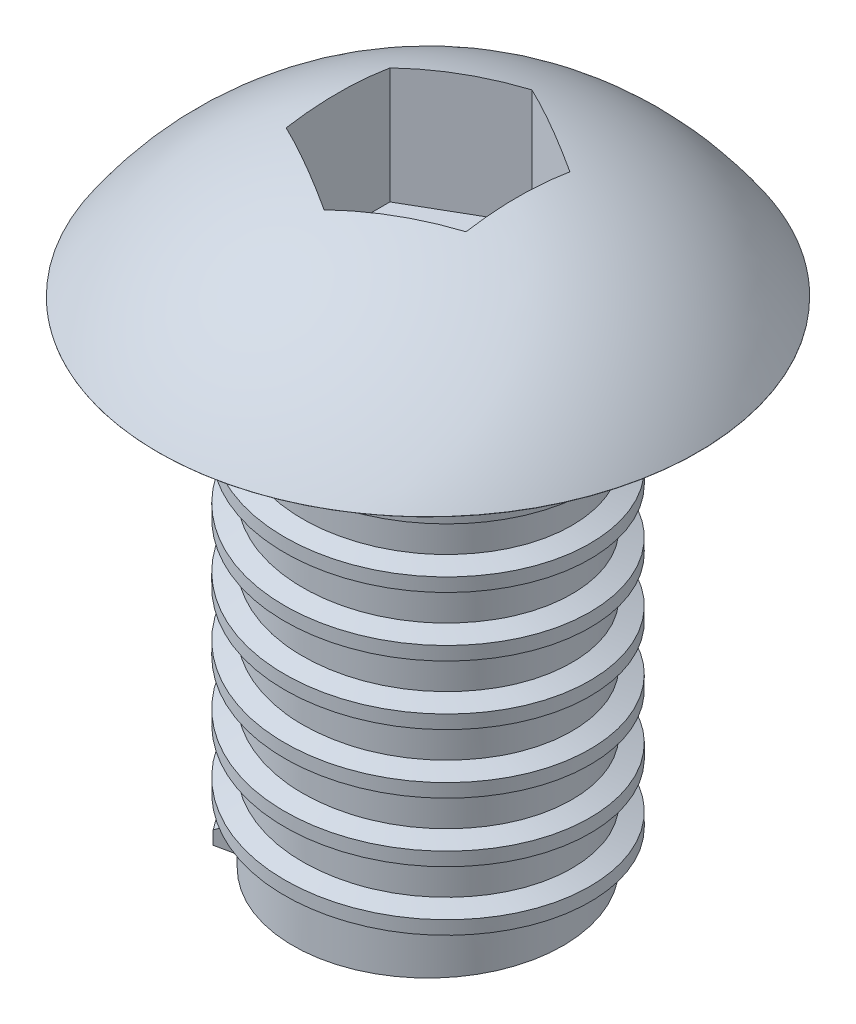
ISO-10303-21;
HEADER;
FILE_DESCRIPTION(('STEP AP214'),'2;1');
FILE_NAME('part.step','',(''),(''),'','','');
FILE_SCHEMA(('AUTOMOTIVE_DESIGN { 1 0 10303 214 1 1 1 1 }'));
ENDSEC;
DATA;
#1=APPLICATION_CONTEXT('core data for automotive mechanical design processes');
#2=APPLICATION_PROTOCOL_DEFINITION('international standard','automotive_design',2000,#1);
#3=PRODUCT_CONTEXT('',#1,'mechanical');
#4=PRODUCT('Part','Part','',(#3));
#5=PRODUCT_RELATED_PRODUCT_CATEGORY('part','',(#4));
#6=PRODUCT_DEFINITION_FORMATION('','',#4);
#7=PRODUCT_DEFINITION_CONTEXT('part definition',#1,'design');
#8=PRODUCT_DEFINITION('design','',#6,#7);
#9=PRODUCT_DEFINITION_SHAPE('','',#8);
#10=(LENGTH_UNIT() NAMED_UNIT(*) SI_UNIT(.MILLI.,.METRE.));
#11=(NAMED_UNIT(*) PLANE_ANGLE_UNIT() SI_UNIT($,.RADIAN.));
#12=(NAMED_UNIT(*) SI_UNIT($,.STERADIAN.) SOLID_ANGLE_UNIT());
#13=UNCERTAINTY_MEASURE_WITH_UNIT(LENGTH_MEASURE(1.E-05),#10,'distance_accuracy_value','');
#14=(GEOMETRIC_REPRESENTATION_CONTEXT(3) GLOBAL_UNCERTAINTY_ASSIGNED_CONTEXT((#13)) GLOBAL_UNIT_ASSIGNED_CONTEXT((#10,
#11,#12)) REPRESENTATION_CONTEXT('',''));
#15=CARTESIAN_POINT('',(0.,0.,0.));
#16=DIRECTION('',(0.,0.,1.));
#17=DIRECTION('',(1.,0.,0.));
#18=AXIS2_PLACEMENT_3D('',#15,#16,#17);
#19=CARTESIAN_POINT('',(0.,0.,0.));
#20=DIRECTION('',(0.,1.,0.));
#21=DIRECTION('',(0.,0.,1.));
#22=AXIS2_PLACEMENT_3D('',#19,#20,#21);
#23=PLANE('',#22);
#24=CARTESIAN_POINT('',(0.,0.,0.));
#25=DIRECTION('',(0.,1.,0.));
#26=DIRECTION('',(0.,0.,1.));
#27=AXIS2_PLACEMENT_3D('',#24,#25,#26);
#28=CIRCLE('',#27,3.81);
#29=CARTESIAN_POINT('',(0.,0.,3.81));
#30=VERTEX_POINT('',#29);
#31=EDGE_CURVE('E241',#30,#30,#28,.T.);
#32=ORIENTED_EDGE('',*,*,#31,.F.);
#33=EDGE_LOOP('',(#32));
#34=FACE_BOUND('',#33,.T.);
#35=DIRECTION('',(1.,0.,0.));
#36=VECTOR('',#35,1.);
#37=CARTESIAN_POINT('',(0.,0.,0.));
#38=LINE('',#37,#36);
#39=CARTESIAN_POINT('',(-2.159,0.,0.));
#40=VERTEX_POINT('',#39);
#41=CARTESIAN_POINT('',(-1.905,0.,0.));
#42=VERTEX_POINT('',#41);
#43=EDGE_CURVE('E207',#40,#42,#38,.T.);
#44=ORIENTED_EDGE('',*,*,#43,.F.);
#45=CARTESIAN_POINT('',(-2.159,0.,0.));
#46=CARTESIAN_POINT('',(-2.15900150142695,0.,0.0637886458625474));
#47=CARTESIAN_POINT('',(-2.15617173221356,0.,0.127548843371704));
#48=CARTESIAN_POINT('',(-2.14487598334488,0.,0.254697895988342));
#49=CARTESIAN_POINT('',(-2.1363986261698,0.,0.318085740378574));
#50=CARTESIAN_POINT('',(-2.1037027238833,0.,0.500412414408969));
#51=CARTESIAN_POINT('',(-2.07218475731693,0.,0.618118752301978));
#52=CARTESIAN_POINT('',(-1.98980923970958,0.,0.846575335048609));
#53=CARTESIAN_POINT('',(-1.93894800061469,0.,0.957324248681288));
#54=CARTESIAN_POINT('',(-1.84437149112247,0.,1.12454083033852));
#55=CARTESIAN_POINT('',(-1.80651582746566,0.,1.18439087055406));
#56=CARTESIAN_POINT('',(-1.7252066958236,0.,1.29997223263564));
#57=CARTESIAN_POINT('',(-1.68176508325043,0.,1.35571189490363));
#58=CARTESIAN_POINT('',(-1.63567061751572,0.,1.40920638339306));
#59=B_SPLINE_CURVE_WITH_KNOTS('',3,(#45,#46,#47,#48,#49,#50,#51,#52,#53,#54,#55,#56,#57,#58),
.UNSPECIFIED.,.F.,.F.,(4,2,2,2,2,2,4),(0.,0.191246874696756,0.382880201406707,0.74660375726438,
1.1103966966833,1.32253681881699,1.53423391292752),.UNSPECIFIED.);
#60=CARTESIAN_POINT('',(-1.63567061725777,-2.37980100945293E-11,1.40920638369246));
#61=VERTEX_POINT('',#60);
#62=EDGE_CURVE('E12',#40,#61,#59,.T.);
#63=ORIENTED_EDGE('',*,*,#62,.T.);
#64=CARTESIAN_POINT('',(-1.63567061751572,0.,1.40920638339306));
#65=CARTESIAN_POINT('',(-1.61688702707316,0.,1.42503188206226));
#66=CARTESIAN_POINT('',(-1.59785029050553,0.,1.44055722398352));
#67=CARTESIAN_POINT('',(-1.55927797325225,0.,1.47097576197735));
#68=CARTESIAN_POINT('',(-1.53974238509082,0.,1.48586894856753));
#69=CARTESIAN_POINT('',(-1.50017491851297,0.,1.51499488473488));
#70=CARTESIAN_POINT('',(-1.48014290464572,0.,1.52922745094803));
#71=CARTESIAN_POINT('',(-1.43955523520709,0.,1.55692096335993));
#72=CARTESIAN_POINT('',(-1.41899960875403,0.,1.57038195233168));
#73=CARTESIAN_POINT('',(-1.35657359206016,0.,1.60962725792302));
#74=CARTESIAN_POINT('',(-1.31396728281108,0.,1.63425679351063));
#75=CARTESIAN_POINT('',(-1.22705327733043,0.,1.6802591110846));
#76=CARTESIAN_POINT('',(-1.18274576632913,0.,1.70163224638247));
#77=CARTESIAN_POINT('',(-1.04744800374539,0.,1.76075873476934));
#78=CARTESIAN_POINT('',(-0.954185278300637,0.,1.79345459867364));
#79=CARTESIAN_POINT('',(-0.763934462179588,0.,1.84444987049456));
#80=CARTESIAN_POINT('',(-0.666951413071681,0.,1.86276808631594));
#81=CARTESIAN_POINT('',(-0.520944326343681,0.,1.8791182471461));
#82=CARTESIAN_POINT('',(-0.472491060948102,0.,1.88272516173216));
#83=CARTESIAN_POINT('',(-0.375495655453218,0.,1.8863328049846));
#84=CARTESIAN_POINT('',(-0.326953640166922,0.,1.88633688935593));
#85=CARTESIAN_POINT('',(-0.278461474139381,0.,1.88453819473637));
#86=B_SPLINE_CURVE_WITH_KNOTS('',3,(#64,#65,#66,#67,#68,#69,#70,#71,#72,#73,#74,#75,#76,#77,#78,
#79,#80,#81,#82,#83,#84,#85),.UNSPECIFIED.,.F.,.F.,(4,2,2,2,2,2,2,2,2,2,4),(0.,
0.0736815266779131,0.14736415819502,0.221067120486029,0.294765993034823,0.442250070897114,
0.589718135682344,0.885014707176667,1.1799243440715,1.32556928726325,1.47107857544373),.UNSPECIFIED.);
#87=CARTESIAN_POINT('',(-0.278461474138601,0.,1.88453819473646));
#88=VERTEX_POINT('',#87);
#89=EDGE_CURVE('E210',#61,#88,#86,.T.);
#90=ORIENTED_EDGE('',*,*,#89,.T.);
#91=CARTESIAN_POINT('',(0.,0.,0.));
#92=DIRECTION('',(0.,1.,0.));
#93=DIRECTION('',(0.,0.,1.));
#94=AXIS2_PLACEMENT_3D('',#91,#92,#93);
#95=CIRCLE('',#94,1.905);
#96=EDGE_CURVE('E51',#42,#88,#95,.F.);
#97=ORIENTED_EDGE('',*,*,#96,.F.);
#98=EDGE_LOOP('',(#44,#63,#90,#97));
#99=FACE_BOUND('',#98,.T.);
#100=ADVANCED_FACE('F40',(#34,#99),#23,.F.);
#101=CARTESIAN_POINT('',(0.,-2.553335,0.));
#102=DIRECTION('',(0.,0.,1.));
#103=DIRECTION('',(1.,0.,0.));
#104=AXIS2_PLACEMENT_3D('',#101,#102,#103);
#105=SPHERICAL_SURFACE('',#104,4.587875);
#106=CARTESIAN_POINT('',(0.,0.00254,0.));
#107=DIRECTION('',(0.,1.,0.));
#108=DIRECTION('',(0.,0.,1.));
#109=AXIS2_PLACEMENT_3D('',#106,#107,#108);
#110=CIRCLE('',#109,3.81);
#111=CARTESIAN_POINT('',(0.,0.00254,3.81));
#112=VERTEX_POINT('',#111);
#113=EDGE_CURVE('E244',#112,#112,#110,.T.);
#114=ORIENTED_EDGE('',*,*,#113,.T.);
#115=EDGE_LOOP('',(#114));
#116=FACE_BOUND('',#115,.T.);
#117=CARTESIAN_POINT('',(1.27,-2.553335,0.));
#118=DIRECTION('',(-1.,0.,0.));
#119=DIRECTION('',(0.,0.,1.));
#120=AXIS2_PLACEMENT_3D('',#117,#118,#119);
#121=CIRCLE('',#120,4.40859354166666);
#122=CARTESIAN_POINT('',(1.27,1.79385532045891,-0.733234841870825));
#123=VERTEX_POINT('',#122);
#124=CARTESIAN_POINT('',(1.27,1.79385532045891,0.733234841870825));
#125=VERTEX_POINT('',#124);
#126=EDGE_CURVE('E247',#123,#125,#121,.F.);
#127=ORIENTED_EDGE('',*,*,#126,.T.);
#128=CARTESIAN_POINT('',(0.635,-2.553335,1.09985226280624));
#129=DIRECTION('',(-0.5,0.,-0.866025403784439));
#130=DIRECTION('',(-0.866025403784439,0.,0.5));
#131=AXIS2_PLACEMENT_3D('',#128,#129,#130);
#132=CIRCLE('',#131,4.40859354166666);
#133=CARTESIAN_POINT('',(0.,1.79385532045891,1.46646968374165));
#134=VERTEX_POINT('',#133);
#135=EDGE_CURVE('E262',#125,#134,#132,.F.);
#136=ORIENTED_EDGE('',*,*,#135,.T.);
#137=CARTESIAN_POINT('',(-0.635,-2.553335,1.09985226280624));
#138=DIRECTION('',(0.5,0.,-0.866025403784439));
#139=DIRECTION('',(-0.866025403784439,0.,-0.5));
#140=AXIS2_PLACEMENT_3D('',#137,#138,#139);
#141=CIRCLE('',#140,4.40859354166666);
#142=CARTESIAN_POINT('',(-1.27,1.79385532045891,0.733234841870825));
#143=VERTEX_POINT('',#142);
#144=EDGE_CURVE('E259',#134,#143,#141,.F.);
#145=ORIENTED_EDGE('',*,*,#144,.T.);
#146=CARTESIAN_POINT('',(-1.27,-2.553335,0.));
#147=DIRECTION('',(1.,0.,0.));
#148=DIRECTION('',(0.,0.,-1.));
#149=AXIS2_PLACEMENT_3D('',#146,#147,#148);
#150=CIRCLE('',#149,4.40859354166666);
#151=CARTESIAN_POINT('',(-1.27,1.79385532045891,-0.733234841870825));
#152=VERTEX_POINT('',#151);
#153=EDGE_CURVE('E256',#143,#152,#150,.F.);
#154=ORIENTED_EDGE('',*,*,#153,.T.);
#155=CARTESIAN_POINT('',(-0.635000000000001,-2.553335,-1.09985226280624));
#156=DIRECTION('',(0.5,0.,0.866025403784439));
#157=DIRECTION('',(0.866025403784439,0.,-0.5));
#158=AXIS2_PLACEMENT_3D('',#155,#156,#157);
#159=CIRCLE('',#158,4.40859354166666);
#160=CARTESIAN_POINT('',(0.,1.79385532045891,-1.46646968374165));
#161=VERTEX_POINT('',#160);
#162=EDGE_CURVE('E253',#152,#161,#159,.F.);
#163=ORIENTED_EDGE('',*,*,#162,.T.);
#164=CARTESIAN_POINT('',(0.635,-2.553335,-1.09985226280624));
#165=DIRECTION('',(-0.5,0.,0.866025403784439));
#166=DIRECTION('',(0.866025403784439,0.,0.5));
#167=AXIS2_PLACEMENT_3D('',#164,#165,#166);
#168=CIRCLE('',#167,4.40859354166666);
#169=EDGE_CURVE('E250',#161,#123,#168,.F.);
#170=ORIENTED_EDGE('',*,*,#169,.T.);
#171=EDGE_LOOP('',(#127,#136,#145,#154,#163,#170));
#172=FACE_BOUND('',#171,.T.);
#173=ADVANCED_FACE('F42',(#116,#172),#105,.T.);
#174=CARTESIAN_POINT('',(0.,0.00254,0.));
#175=DIRECTION('',(0.,-1.,0.));
#176=DIRECTION('',(0.,0.,-1.));
#177=AXIS2_PLACEMENT_3D('',#174,#175,#176);
#178=CYLINDRICAL_SURFACE('',#177,3.81);
#179=ORIENTED_EDGE('',*,*,#113,.F.);
#180=EDGE_LOOP('',(#179));
#181=FACE_BOUND('',#180,.T.);
#182=ORIENTED_EDGE('',*,*,#31,.T.);
#183=EDGE_LOOP('',(#182));
#184=FACE_BOUND('',#183,.T.);
#185=ADVANCED_FACE('F410',(#181,#184),#178,.T.);
#186=CARTESIAN_POINT('',(1.27,0.155194,0.733234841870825));
#187=DIRECTION('',(-0.5,0.,-0.866025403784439));
#188=DIRECTION('',(-0.866025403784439,0.,0.5));
#189=AXIS2_PLACEMENT_3D('',#186,#187,#188);
#190=PLANE('',#189);
#191=DIRECTION('',(0.,1.,0.));
#192=VECTOR('',#191,1.);
#193=CARTESIAN_POINT('',(1.27,0.155194,0.733234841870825));
#194=LINE('',#193,#192);
#195=CARTESIAN_POINT('',(1.27,0.155194,0.733234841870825));
#196=VERTEX_POINT('',#195);
#197=EDGE_CURVE('E68',#196,#125,#194,.T.);
#198=ORIENTED_EDGE('',*,*,#197,.F.);
#199=DIRECTION('',(-0.866025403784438,0.,0.5));
#200=VECTOR('',#199,1.);
#201=CARTESIAN_POINT('',(1.27,0.155194,0.733234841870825));
#202=LINE('',#201,#200);
#203=CARTESIAN_POINT('',(0.,0.155194,1.46646968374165));
#204=VERTEX_POINT('',#203);
#205=EDGE_CURVE('E211',#196,#204,#202,.T.);
#206=ORIENTED_EDGE('',*,*,#205,.T.);
#207=DIRECTION('',(0.,1.,0.));
#208=VECTOR('',#207,1.);
#209=CARTESIAN_POINT('',(0.,0.155194,1.46646968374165));
#210=LINE('',#209,#208);
#211=EDGE_CURVE('E238',#204,#134,#210,.T.);
#212=ORIENTED_EDGE('',*,*,#211,.T.);
#213=ORIENTED_EDGE('',*,*,#135,.F.);
#214=EDGE_LOOP('',(#198,#206,#212,#213));
#215=FACE_BOUND('',#214,.T.);
#216=ADVANCED_FACE('F415',(#215),#190,.T.);
#217=CARTESIAN_POINT('',(0.,0.155194,1.46646968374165));
#218=DIRECTION('',(0.5,0.,-0.866025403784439));
#219=DIRECTION('',(-0.866025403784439,0.,-0.5));
#220=AXIS2_PLACEMENT_3D('',#217,#218,#219);
#221=PLANE('',#220);
#222=ORIENTED_EDGE('',*,*,#211,.F.);
#223=DIRECTION('',(-0.866025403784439,0.,-0.5));
#224=VECTOR('',#223,1.);
#225=CARTESIAN_POINT('',(0.,0.155194,1.46646968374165));
#226=LINE('',#225,#224);
#227=CARTESIAN_POINT('',(-1.27,0.155194,0.733234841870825));
#228=VERTEX_POINT('',#227);
#229=EDGE_CURVE('E214',#204,#228,#226,.T.);
#230=ORIENTED_EDGE('',*,*,#229,.T.);
#231=DIRECTION('',(0.,1.,0.));
#232=VECTOR('',#231,1.);
#233=CARTESIAN_POINT('',(-1.27,0.155194,0.733234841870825));
#234=LINE('',#233,#232);
#235=EDGE_CURVE('E235',#228,#143,#234,.T.);
#236=ORIENTED_EDGE('',*,*,#235,.T.);
#237=ORIENTED_EDGE('',*,*,#144,.F.);
#238=EDGE_LOOP('',(#222,#230,#236,#237));
#239=FACE_BOUND('',#238,.T.);
#240=ADVANCED_FACE('F420',(#239),#221,.T.);
#241=CARTESIAN_POINT('',(-1.27,0.155194,0.733234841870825));
#242=DIRECTION('',(1.,0.,0.));
#243=DIRECTION('',(0.,0.,-1.));
#244=AXIS2_PLACEMENT_3D('',#241,#242,#243);
#245=PLANE('',#244);
#246=ORIENTED_EDGE('',*,*,#235,.F.);
#247=DIRECTION('',(0.,0.,-1.));
#248=VECTOR('',#247,1.);
#249=CARTESIAN_POINT('',(-1.27,0.155194,0.733234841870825));
#250=LINE('',#249,#248);
#251=CARTESIAN_POINT('',(-1.27,0.155194,-0.733234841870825));
#252=VERTEX_POINT('',#251);
#253=EDGE_CURVE('E217',#228,#252,#250,.T.);
#254=ORIENTED_EDGE('',*,*,#253,.T.);
#255=DIRECTION('',(0.,1.,0.));
#256=VECTOR('',#255,1.);
#257=CARTESIAN_POINT('',(-1.27,0.155194,-0.733234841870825));
#258=LINE('',#257,#256);
#259=EDGE_CURVE('E232',#252,#152,#258,.T.);
#260=ORIENTED_EDGE('',*,*,#259,.T.);
#261=ORIENTED_EDGE('',*,*,#153,.F.);
#262=EDGE_LOOP('',(#246,#254,#260,#261));
#263=FACE_BOUND('',#262,.T.);
#264=ADVANCED_FACE('F439',(#263),#245,.T.);
#265=CARTESIAN_POINT('',(-1.27,0.155194,-0.733234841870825));
#266=DIRECTION('',(0.5,0.,0.866025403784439));
#267=DIRECTION('',(0.866025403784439,0.,-0.5));
#268=AXIS2_PLACEMENT_3D('',#265,#266,#267);
#269=PLANE('',#268);
#270=ORIENTED_EDGE('',*,*,#259,.F.);
#271=DIRECTION('',(0.866025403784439,0.,-0.5));
#272=VECTOR('',#271,1.);
#273=CARTESIAN_POINT('',(-1.27,0.155194,-0.733234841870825));
#274=LINE('',#273,#272);
#275=CARTESIAN_POINT('',(0.,0.155194,-1.46646968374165));
#276=VERTEX_POINT('',#275);
#277=EDGE_CURVE('E219',#252,#276,#274,.T.);
#278=ORIENTED_EDGE('',*,*,#277,.T.);
#279=DIRECTION('',(0.,1.,0.));
#280=VECTOR('',#279,1.);
#281=CARTESIAN_POINT('',(0.,0.155194,-1.46646968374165));
#282=LINE('',#281,#280);
#283=EDGE_CURVE('E229',#276,#161,#282,.T.);
#284=ORIENTED_EDGE('',*,*,#283,.T.);
#285=ORIENTED_EDGE('',*,*,#162,.F.);
#286=EDGE_LOOP('',(#270,#278,#284,#285));
#287=FACE_BOUND('',#286,.T.);
#288=ADVANCED_FACE('F442',(#287),#269,.T.);
#289=CARTESIAN_POINT('',(0.,0.155194,-1.46646968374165));
#290=DIRECTION('',(-0.5,0.,0.866025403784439));
#291=DIRECTION('',(0.866025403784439,0.,0.5));
#292=AXIS2_PLACEMENT_3D('',#289,#290,#291);
#293=PLANE('',#292);
#294=ORIENTED_EDGE('',*,*,#283,.F.);
#295=DIRECTION('',(0.866025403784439,0.,0.5));
#296=VECTOR('',#295,1.);
#297=CARTESIAN_POINT('',(0.,0.155194,-1.46646968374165));
#298=LINE('',#297,#296);
#299=CARTESIAN_POINT('',(1.27,0.155194,-0.733234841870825));
#300=VERTEX_POINT('',#299);
#301=EDGE_CURVE('E221',#276,#300,#298,.T.);
#302=ORIENTED_EDGE('',*,*,#301,.T.);
#303=DIRECTION('',(0.,1.,0.));
#304=VECTOR('',#303,1.);
#305=CARTESIAN_POINT('',(1.27,0.155194,-0.733234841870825));
#306=LINE('',#305,#304);
#307=EDGE_CURVE('E226',#300,#123,#306,.T.);
#308=ORIENTED_EDGE('',*,*,#307,.T.);
#309=ORIENTED_EDGE('',*,*,#169,.F.);
#310=EDGE_LOOP('',(#294,#302,#308,#309));
#311=FACE_BOUND('',#310,.T.);
#312=ADVANCED_FACE('F429',(#311),#293,.T.);
#313=CARTESIAN_POINT('',(1.27,0.155194,-0.733234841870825));
#314=DIRECTION('',(-1.,0.,0.));
#315=DIRECTION('',(0.,0.,1.));
#316=AXIS2_PLACEMENT_3D('',#313,#314,#315);
#317=PLANE('',#316);
#318=ORIENTED_EDGE('',*,*,#307,.F.);
#319=DIRECTION('',(0.,0.,1.));
#320=VECTOR('',#319,1.);
#321=CARTESIAN_POINT('',(1.27,0.155194,-0.733234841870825));
#322=LINE('',#321,#320);
#323=EDGE_CURVE('E223',#300,#196,#322,.T.);
#324=ORIENTED_EDGE('',*,*,#323,.T.);
#325=ORIENTED_EDGE('',*,*,#197,.T.);
#326=ORIENTED_EDGE('',*,*,#126,.F.);
#327=EDGE_LOOP('',(#318,#324,#325,#326));
#328=FACE_BOUND('',#327,.T.);
#329=ADVANCED_FACE('F425',(#328),#317,.T.);
#330=CARTESIAN_POINT('',(0.,0.155194,1.46646968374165));
#331=DIRECTION('',(0.,-1.,0.));
#332=DIRECTION('',(0.,0.,-1.));
#333=AXIS2_PLACEMENT_3D('',#330,#331,#332);
#334=PLANE('',#333);
#335=ORIENTED_EDGE('',*,*,#205,.F.);
#336=ORIENTED_EDGE('',*,*,#323,.F.);
#337=ORIENTED_EDGE('',*,*,#301,.F.);
#338=ORIENTED_EDGE('',*,*,#277,.F.);
#339=ORIENTED_EDGE('',*,*,#253,.F.);
#340=ORIENTED_EDGE('',*,*,#229,.F.);
#341=EDGE_LOOP('',(#335,#336,#337,#338,#339,#340));
#342=FACE_BOUND('',#341,.T.);
#343=ADVANCED_FACE('F283',(#342),#334,.F.);
#344=CARTESIAN_POINT('',(0.,-6.985,0.));
#345=DIRECTION('',(0.,1.,0.));
#346=DIRECTION('',(0.,0.,1.));
#347=AXIS2_PLACEMENT_3D('',#344,#345,#346);
#348=CYLINDRICAL_SURFACE('',#347,1.905);
#349=CARTESIAN_POINT('',(-1.905,0.1905,0.));
#350=CARTESIAN_POINT('',(-1.905,0.1381125,0.789076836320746));
#351=CARTESIAN_POINT('',(-1.34703841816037,0.085725,1.34703841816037));
#352=CARTESIAN_POINT('',(-0.789076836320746,0.0333375,1.905));
#353=CARTESIAN_POINT('',(0.,-0.01905,1.905));
#354=CARTESIAN_POINT('',(0.789076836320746,-0.0714375,1.905));
#355=CARTESIAN_POINT('',(1.34703841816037,-0.123825,1.34703841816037));
#356=CARTESIAN_POINT('',(1.905,-0.1762125,0.789076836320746));
#357=CARTESIAN_POINT('',(1.905,-0.2286,0.));
#358=CARTESIAN_POINT('',(1.905,-0.2809875,-0.789076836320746));
#359=CARTESIAN_POINT('',(1.34703841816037,-0.333375,-1.34703841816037));
#360=CARTESIAN_POINT('',(0.789076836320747,-0.3857625,-1.905));
#361=CARTESIAN_POINT('',(0.,-0.43815,-1.905));
#362=CARTESIAN_POINT('',(-0.789076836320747,-0.4905375,-1.905));
#363=CARTESIAN_POINT('',(-1.34703841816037,-0.542925,-1.34703841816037));
#364=CARTESIAN_POINT('',(-1.905,-0.5953125,-0.789076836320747));
#365=CARTESIAN_POINT('',(-1.905,-0.6477,0.));
#366=CARTESIAN_POINT('',(-1.905,-0.7000875,0.789076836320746));
#367=CARTESIAN_POINT('',(-1.34703841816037,-0.752475,1.34703841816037));
#368=CARTESIAN_POINT('',(-0.789076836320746,-0.8048625,1.905));
#369=CARTESIAN_POINT('',(0.,-0.85725,1.905));
#370=CARTESIAN_POINT('',(0.789076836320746,-0.9096375,1.905));
#371=CARTESIAN_POINT('',(1.34703841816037,-0.962025,1.34703841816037));
#372=CARTESIAN_POINT('',(1.905,-1.0144125,0.789076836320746));
#373=CARTESIAN_POINT('',(1.905,-1.0668,0.));
#374=CARTESIAN_POINT('',(1.905,-1.1191875,-0.789076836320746));
#375=CARTESIAN_POINT('',(1.34703841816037,-1.171575,-1.34703841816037));
#376=CARTESIAN_POINT('',(0.789076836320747,-1.2239625,-1.905));
#377=CARTESIAN_POINT('',(0.,-1.27635,-1.905));
#378=CARTESIAN_POINT('',(-0.789076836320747,-1.3287375,-1.905));
#379=CARTESIAN_POINT('',(-1.34703841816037,-1.381125,-1.34703841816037));
#380=CARTESIAN_POINT('',(-1.905,-1.4335125,-0.789076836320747));
#381=CARTESIAN_POINT('',(-1.905,-1.4859,0.));
#382=CARTESIAN_POINT('',(-1.905,-1.5382875,0.789076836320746));
#383=CARTESIAN_POINT('',(-1.34703841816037,-1.590675,1.34703841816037));
#384=CARTESIAN_POINT('',(-0.789076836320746,-1.6430625,1.905));
#385=CARTESIAN_POINT('',(0.,-1.69545,1.905));
#386=CARTESIAN_POINT('',(0.789076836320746,-1.7478375,1.905));
#387=CARTESIAN_POINT('',(1.34703841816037,-1.800225,1.34703841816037));
#388=CARTESIAN_POINT('',(1.905,-1.8526125,0.789076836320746));
#389=CARTESIAN_POINT('',(1.905,-1.905,0.));
#390=CARTESIAN_POINT('',(1.905,-1.9573875,-0.789076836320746));
#391=CARTESIAN_POINT('',(1.34703841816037,-2.009775,-1.34703841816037));
#392=CARTESIAN_POINT('',(0.789076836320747,-2.0621625,-1.905));
#393=CARTESIAN_POINT('',(0.,-2.11455,-1.905));
#394=CARTESIAN_POINT('',(-0.789076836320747,-2.1669375,-1.905));
#395=CARTESIAN_POINT('',(-1.34703841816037,-2.219325,-1.34703841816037));
#396=CARTESIAN_POINT('',(-1.905,-2.2717125,-0.789076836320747));
#397=CARTESIAN_POINT('',(-1.905,-2.3241,0.));
#398=CARTESIAN_POINT('',(-1.905,-2.3764875,0.789076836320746));
#399=CARTESIAN_POINT('',(-1.34703841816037,-2.428875,1.34703841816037));
#400=CARTESIAN_POINT('',(-0.789076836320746,-2.4812625,1.905));
#401=CARTESIAN_POINT('',(0.,-2.53365,1.905));
#402=CARTESIAN_POINT('',(0.789076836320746,-2.5860375,1.905));
#403=CARTESIAN_POINT('',(1.34703841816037,-2.638425,1.34703841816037));
#404=CARTESIAN_POINT('',(1.905,-2.6908125,0.789076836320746));
#405=CARTESIAN_POINT('',(1.905,-2.7432,0.));
#406=CARTESIAN_POINT('',(1.905,-2.7955875,-0.789076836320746));
#407=CARTESIAN_POINT('',(1.34703841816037,-2.847975,-1.34703841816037));
#408=CARTESIAN_POINT('',(0.789076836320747,-2.9003625,-1.905));
#409=CARTESIAN_POINT('',(0.,-2.95275,-1.905));
#410=CARTESIAN_POINT('',(-0.789076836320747,-3.0051375,-1.905));
#411=CARTESIAN_POINT('',(-1.34703841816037,-3.057525,-1.34703841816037));
#412=CARTESIAN_POINT('',(-1.905,-3.1099125,-0.789076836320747));
#413=CARTESIAN_POINT('',(-1.905,-3.1623,0.));
#414=CARTESIAN_POINT('',(-1.905,-3.2146875,0.789076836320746));
#415=CARTESIAN_POINT('',(-1.34703841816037,-3.267075,1.34703841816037));
#416=CARTESIAN_POINT('',(-0.789076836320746,-3.3194625,1.905));
#417=CARTESIAN_POINT('',(0.,-3.37185,1.905));
#418=CARTESIAN_POINT('',(0.789076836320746,-3.4242375,1.905));
#419=CARTESIAN_POINT('',(1.34703841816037,-3.476625,1.34703841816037));
#420=CARTESIAN_POINT('',(1.905,-3.5290125,0.789076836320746));
#421=CARTESIAN_POINT('',(1.905,-3.5814,0.));
#422=CARTESIAN_POINT('',(1.905,-3.6337875,-0.789076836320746));
#423=CARTESIAN_POINT('',(1.34703841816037,-3.686175,-1.34703841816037));
#424=CARTESIAN_POINT('',(0.789076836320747,-3.7385625,-1.905));
#425=CARTESIAN_POINT('',(0.,-3.79095,-1.905));
#426=CARTESIAN_POINT('',(-0.789076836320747,-3.8433375,-1.905));
#427=CARTESIAN_POINT('',(-1.34703841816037,-3.895725,-1.34703841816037));
#428=CARTESIAN_POINT('',(-1.905,-3.9481125,-0.789076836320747));
#429=CARTESIAN_POINT('',(-1.905,-4.0005,0.));
#430=CARTESIAN_POINT('',(-1.905,-4.0528875,0.789076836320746));
#431=CARTESIAN_POINT('',(-1.34703841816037,-4.105275,1.34703841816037));
#432=CARTESIAN_POINT('',(-0.789076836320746,-4.1576625,1.905));
#433=CARTESIAN_POINT('',(0.,-4.21005,1.905));
#434=CARTESIAN_POINT('',(0.789076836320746,-4.2624375,1.905));
#435=CARTESIAN_POINT('',(1.34703841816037,-4.314825,1.34703841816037));
#436=CARTESIAN_POINT('',(1.905,-4.3672125,0.789076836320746));
#437=CARTESIAN_POINT('',(1.905,-4.4196,0.));
#438=CARTESIAN_POINT('',(1.905,-4.4719875,-0.789076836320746));
#439=CARTESIAN_POINT('',(1.34703841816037,-4.524375,-1.34703841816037));
#440=CARTESIAN_POINT('',(0.789076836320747,-4.5767625,-1.905));
#441=CARTESIAN_POINT('',(0.,-4.62915,-1.905));
#442=CARTESIAN_POINT('',(-0.789076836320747,-4.6815375,-1.905));
#443=CARTESIAN_POINT('',(-1.34703841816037,-4.733925,-1.34703841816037));
#444=CARTESIAN_POINT('',(-1.905,-4.7863125,-0.789076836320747));
#445=CARTESIAN_POINT('',(-1.905,-4.8387,0.));
#446=CARTESIAN_POINT('',(-1.905,-4.8910875,0.789076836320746));
#447=CARTESIAN_POINT('',(-1.34703841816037,-4.943475,1.34703841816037));
#448=CARTESIAN_POINT('',(-0.789076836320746,-4.9958625,1.905));
#449=CARTESIAN_POINT('',(0.,-5.04825,1.905));
#450=CARTESIAN_POINT('',(0.789076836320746,-5.1006375,1.905));
#451=CARTESIAN_POINT('',(1.34703841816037,-5.153025,1.34703841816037));
#452=CARTESIAN_POINT('',(1.905,-5.2054125,0.789076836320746));
#453=CARTESIAN_POINT('',(1.905,-5.2578,0.));
#454=CARTESIAN_POINT('',(1.905,-5.3101875,-0.789076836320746));
#455=CARTESIAN_POINT('',(1.34703841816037,-5.362575,-1.34703841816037));
#456=CARTESIAN_POINT('',(0.789076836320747,-5.4149625,-1.905));
#457=CARTESIAN_POINT('',(0.,-5.46735,-1.905));
#458=CARTESIAN_POINT('',(-0.789076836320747,-5.5197375,-1.905));
#459=CARTESIAN_POINT('',(-1.34703841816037,-5.572125,-1.34703841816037));
#460=CARTESIAN_POINT('',(-1.905,-5.6245125,-0.789076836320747));
#461=CARTESIAN_POINT('',(-1.905,-5.6769,0.));
#462=CARTESIAN_POINT('',(-1.905,-5.7292875,0.789076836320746));
#463=CARTESIAN_POINT('',(-1.34703841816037,-5.781675,1.34703841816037));
#464=CARTESIAN_POINT('',(-0.789076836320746,-5.8340625,1.905));
#465=CARTESIAN_POINT('',(0.,-5.88645,1.905));
#466=CARTESIAN_POINT('',(0.789076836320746,-5.9388375,1.905));
#467=CARTESIAN_POINT('',(1.34703841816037,-5.991225,1.34703841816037));
#468=CARTESIAN_POINT('',(1.905,-6.0436125,0.789076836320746));
#469=CARTESIAN_POINT('',(1.905,-6.096,0.));
#470=CARTESIAN_POINT('',(1.905,-6.1483875,-0.789076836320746));
#471=CARTESIAN_POINT('',(1.34703841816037,-6.200775,-1.34703841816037));
#472=CARTESIAN_POINT('',(0.789076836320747,-6.2531625,-1.905));
#473=CARTESIAN_POINT('',(0.,-6.30555,-1.905));
#474=CARTESIAN_POINT('',(-0.789076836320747,-6.3579375,-1.905));
#475=CARTESIAN_POINT('',(-1.34703841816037,-6.410325,-1.34703841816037));
#476=CARTESIAN_POINT('',(-1.905,-6.4627125,-0.789076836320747));
#477=CARTESIAN_POINT('',(-1.905,-6.5151,0.));
#478=CARTESIAN_POINT('',(-1.905,-6.5588720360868,0.659308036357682));
#479=CARTESIAN_POINT('',(-1.49745198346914,-6.60448722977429,1.1775663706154));
#480=(BOUNDED_CURVE() B_SPLINE_CURVE(2,(#349,#350,#351,#352,#353,#354,#355,#356,#357,#358,#359,
#360,#361,#362,#363,#364,#365,#366,#367,#368,#369,#370,#371,#372,#373,#374,#375,#376,#377,#378,
#379,#380,#381,#382,#383,#384,#385,#386,#387,#388,#389,#390,#391,#392,#393,#394,#395,#396,#397,
#398,#399,#400,#401,#402,#403,#404,#405,#406,#407,#408,#409,#410,#411,#412,#413,#414,#415,#416,
#417,#418,#419,#420,#421,#422,#423,#424,#425,#426,#427,#428,#429,#430,#431,#432,#433,#434,#435,
#436,#437,#438,#439,#440,#441,#442,#443,#444,#445,#446,#447,#448,#449,#450,#451,#452,#453,#454,
#455,#456,#457,#458,#459,#460,#461,#462,#463,#464,#465,#466,#467,#468,#469,#470,#471,#472,#473,
#474,#475,#476,#477,#478,#479),.UNSPECIFIED.,.F.,.F.) B_SPLINE_CURVE_WITH_KNOTS((3,2,2,2,2,2,2,
2,2,2,2,2,2,2,2,2,2,2,2,2,2,2,2,2,2,2,2,2,2,2,2,2,2,2,2,2,2,2,2,2,2,2,2,2,2,2,2,2,2,2,2,2,2,2,2,
2,2,2,2,2,2,2,2,2,2,3),(0.,0.0138888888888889,0.0277777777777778,0.0416666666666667,
0.0555555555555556,0.0694444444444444,0.0833333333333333,0.0972222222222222,0.111111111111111,
0.125,0.138888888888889,0.152777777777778,0.166666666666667,0.180555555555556,0.194444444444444,
0.208333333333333,0.222222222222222,0.236111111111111,0.25,0.263888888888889,0.277777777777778,
0.291666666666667,0.305555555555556,0.319444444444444,0.333333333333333,0.347222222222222,
0.361111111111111,0.375,0.388888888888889,0.402777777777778,0.416666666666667,0.430555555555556,
0.444444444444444,0.458333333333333,0.472222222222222,0.486111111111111,0.5,0.513888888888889,
0.527777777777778,0.541666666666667,0.555555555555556,0.569444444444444,0.583333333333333,
0.597222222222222,0.611111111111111,0.625,0.638888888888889,0.652777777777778,0.666666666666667,
0.680555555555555,0.694444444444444,0.708333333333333,0.722222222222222,0.736111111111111,0.75,
0.763888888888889,0.777777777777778,0.791666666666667,0.805555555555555,0.819444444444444,
0.833333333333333,0.847222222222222,0.861111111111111,0.875,0.888888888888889,
0.900640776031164),
.UNSPECIFIED.) CURVE() GEOMETRIC_REPRESENTATION_ITEM() RATIONAL_B_SPLINE_CURVE((1.,
0.923879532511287,1.,0.923879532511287,1.,0.923879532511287,1.,0.923879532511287,1.,
0.923879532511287,1.,0.923879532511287,1.,0.923879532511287,1.,0.923879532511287,1.,
0.923879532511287,1.,0.923879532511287,1.,0.923879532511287,1.,0.923879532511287,1.,
0.923879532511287,1.,0.923879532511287,1.,0.923879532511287,1.,0.923879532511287,1.,
0.923879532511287,1.,0.923879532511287,1.,0.923879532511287,1.,0.923879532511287,1.,
0.923879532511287,1.,0.923879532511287,1.,0.923879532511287,1.,0.923879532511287,1.,
0.923879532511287,1.,0.923879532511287,1.,0.923879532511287,1.,0.923879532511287,1.,
0.923879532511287,1.,0.923879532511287,1.,0.923879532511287,1.,0.923879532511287,1.,
0.923879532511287,1.,0.923879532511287,1.,0.923879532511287,1.,0.923879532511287,1.,
0.923879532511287,1.,0.923879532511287,1.,0.923879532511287,1.,0.923879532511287,1.,
0.923879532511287,1.,0.923879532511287,1.,0.923879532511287,1.,0.923879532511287,1.,
0.923879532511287,1.,0.923879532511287,1.,0.923879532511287,1.,0.923879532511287,1.,
0.923879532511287,1.,0.923879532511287,1.,0.923879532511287,1.,0.923879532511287,1.,
0.923879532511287,1.,0.923879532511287,1.,0.923879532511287,1.,0.923879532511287,1.,
0.923879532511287,1.,0.923879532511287,1.,0.923879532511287,1.,0.923879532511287,1.,
0.923879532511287,1.,0.923879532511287,1.,0.923879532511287,1.,0.923879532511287,1.,
0.935591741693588,0.980179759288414)) REPRESENTATION_ITEM(''));
#481=CARTESIAN_POINT('',(-1.49745198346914,-6.60448722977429,1.1775663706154));
#482=VERTEX_POINT('',#481);
#483=EDGE_CURVE('E148',#88,#482,#480,.T.);
#484=ORIENTED_EDGE('',*,*,#483,.T.);
#485=CARTESIAN_POINT('',(-1.497453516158,-6.60448722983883,1.17756442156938));
#486=CARTESIAN_POINT('',(-1.49745326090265,-6.62035026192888,1.17756474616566));
#487=CARTESIAN_POINT('',(-1.49745300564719,-6.63621329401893,1.17756507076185));
#488=CARTESIAN_POINT('',(-1.49745249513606,-6.66793935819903,1.17756571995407));
#489=CARTESIAN_POINT('',(-1.49745223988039,-6.68380239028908,1.1775660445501));
#490=CARTESIAN_POINT('',(-1.49745172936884,-6.71552845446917,1.17756669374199));
#491=CARTESIAN_POINT('',(-1.49745147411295,-6.73139148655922,1.17756701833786));
#492=CARTESIAN_POINT('',(-1.49745096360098,-6.76311755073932,1.17756766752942));
#493=CARTESIAN_POINT('',(-1.49745070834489,-6.77898058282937,1.17756799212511));
#494=CARTESIAN_POINT('',(-1.49745019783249,-6.81070664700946,1.17756864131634));
#495=CARTESIAN_POINT('',(-1.49744994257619,-6.82656967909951,1.17756896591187));
#496=CARTESIAN_POINT('',(-1.49744943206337,-6.85829574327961,1.17756961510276));
#497=CARTESIAN_POINT('',(-1.49744917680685,-6.87415877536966,1.17756993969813));
#498=CARTESIAN_POINT('',(-1.49744866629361,-6.90588483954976,1.17757058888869));
#499=CARTESIAN_POINT('',(-1.49744841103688,-6.92174787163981,1.17757091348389));
#500=CARTESIAN_POINT('',(-1.49744790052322,-6.9534739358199,1.17757156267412));
#501=CARTESIAN_POINT('',(-1.49744764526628,-6.96933696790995,1.17757188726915));
#502=CARTESIAN_POINT('',(-1.49744739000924,-6.9852,1.1775722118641));
#503=B_SPLINE_CURVE_WITH_KNOTS('',3,(#485,#486,#487,#488,#489,#490,#491,#492,#493,#494,#495,
#496,#497,#498,#499,#500,#501,#502),.UNSPECIFIED.,.F.,.F.,(4,2,2,2,2,2,2,2,4),(0.,
0.0475890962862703,0.0951781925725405,0.142767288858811,0.19035638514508,0.23794548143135,
0.285534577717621,0.333123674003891,0.380712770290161),.UNSPECIFIED.);
#504=CARTESIAN_POINT('',(-1.4974496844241,-6.98524387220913,1.17756929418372));
#505=VERTEX_POINT('',#504);
#506=EDGE_CURVE('E133',#482,#505,#503,.T.);
#507=ORIENTED_EDGE('',*,*,#506,.T.);
#508=CARTESIAN_POINT('',(0.,-6.985,0.));
#509=DIRECTION('',(0.,-1.,0.));
#510=DIRECTION('',(0.,0.,-1.));
#511=AXIS2_PLACEMENT_3D('',#508,#509,#510);
#512=CIRCLE('',#511,1.905);
#513=CARTESIAN_POINT('',(-1.50179265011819,-6.985,1.17202552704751));
#514=VERTEX_POINT('',#513);
#515=EDGE_CURVE('E209',#514,#505,#512,.T.);
#516=ORIENTED_EDGE('',*,*,#515,.F.);
#517=CARTESIAN_POINT('',(-1.905,-0.1905,0.));
#518=CARTESIAN_POINT('',(-1.905,-0.2428875,0.789076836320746));
#519=CARTESIAN_POINT('',(-1.34703841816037,-0.295275,1.34703841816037));
#520=CARTESIAN_POINT('',(-0.789076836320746,-0.3476625,1.905));
#521=CARTESIAN_POINT('',(0.,-0.40005,1.905));
#522=CARTESIAN_POINT('',(0.789076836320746,-0.4524375,1.905));
#523=CARTESIAN_POINT('',(1.34703841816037,-0.504825,1.34703841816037));
#524=CARTESIAN_POINT('',(1.905,-0.5572125,0.789076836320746));
#525=CARTESIAN_POINT('',(1.905,-0.6096,0.));
#526=CARTESIAN_POINT('',(1.905,-0.6619875,-0.789076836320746));
#527=CARTESIAN_POINT('',(1.34703841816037,-0.714375,-1.34703841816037));
#528=CARTESIAN_POINT('',(0.789076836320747,-0.7667625,-1.905));
#529=CARTESIAN_POINT('',(0.,-0.81915,-1.905));
#530=CARTESIAN_POINT('',(-0.789076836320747,-0.8715375,-1.905));
#531=CARTESIAN_POINT('',(-1.34703841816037,-0.923925,-1.34703841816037));
#532=CARTESIAN_POINT('',(-1.905,-0.9763125,-0.789076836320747));
#533=CARTESIAN_POINT('',(-1.905,-1.0287,0.));
#534=CARTESIAN_POINT('',(-1.905,-1.0810875,0.789076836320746));
#535=CARTESIAN_POINT('',(-1.34703841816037,-1.133475,1.34703841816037));
#536=CARTESIAN_POINT('',(-0.789076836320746,-1.1858625,1.905));
#537=CARTESIAN_POINT('',(0.,-1.23825,1.905));
#538=CARTESIAN_POINT('',(0.789076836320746,-1.2906375,1.905));
#539=CARTESIAN_POINT('',(1.34703841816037,-1.343025,1.34703841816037));
#540=CARTESIAN_POINT('',(1.905,-1.3954125,0.789076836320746));
#541=CARTESIAN_POINT('',(1.905,-1.4478,0.));
#542=CARTESIAN_POINT('',(1.905,-1.5001875,-0.789076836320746));
#543=CARTESIAN_POINT('',(1.34703841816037,-1.552575,-1.34703841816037));
#544=CARTESIAN_POINT('',(0.789076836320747,-1.6049625,-1.905));
#545=CARTESIAN_POINT('',(0.,-1.65735,-1.905));
#546=CARTESIAN_POINT('',(-0.789076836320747,-1.7097375,-1.905));
#547=CARTESIAN_POINT('',(-1.34703841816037,-1.762125,-1.34703841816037));
#548=CARTESIAN_POINT('',(-1.905,-1.8145125,-0.789076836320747));
#549=CARTESIAN_POINT('',(-1.905,-1.8669,0.));
#550=CARTESIAN_POINT('',(-1.905,-1.9192875,0.789076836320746));
#551=CARTESIAN_POINT('',(-1.34703841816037,-1.971675,1.34703841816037));
#552=CARTESIAN_POINT('',(-0.789076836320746,-2.0240625,1.905));
#553=CARTESIAN_POINT('',(0.,-2.07645,1.905));
#554=CARTESIAN_POINT('',(0.789076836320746,-2.1288375,1.905));
#555=CARTESIAN_POINT('',(1.34703841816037,-2.181225,1.34703841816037));
#556=CARTESIAN_POINT('',(1.905,-2.2336125,0.789076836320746));
#557=CARTESIAN_POINT('',(1.905,-2.286,0.));
#558=CARTESIAN_POINT('',(1.905,-2.3383875,-0.789076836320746));
#559=CARTESIAN_POINT('',(1.34703841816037,-2.390775,-1.34703841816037));
#560=CARTESIAN_POINT('',(0.789076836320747,-2.4431625,-1.905));
#561=CARTESIAN_POINT('',(0.,-2.49555,-1.905));
#562=CARTESIAN_POINT('',(-0.789076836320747,-2.5479375,-1.905));
#563=CARTESIAN_POINT('',(-1.34703841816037,-2.600325,-1.34703841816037));
#564=CARTESIAN_POINT('',(-1.905,-2.6527125,-0.789076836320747));
#565=CARTESIAN_POINT('',(-1.905,-2.7051,0.));
#566=CARTESIAN_POINT('',(-1.905,-2.7574875,0.789076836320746));
#567=CARTESIAN_POINT('',(-1.34703841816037,-2.809875,1.34703841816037));
#568=CARTESIAN_POINT('',(-0.789076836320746,-2.8622625,1.905));
#569=CARTESIAN_POINT('',(0.,-2.91465,1.905));
#570=CARTESIAN_POINT('',(0.789076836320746,-2.9670375,1.905));
#571=CARTESIAN_POINT('',(1.34703841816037,-3.019425,1.34703841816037));
#572=CARTESIAN_POINT('',(1.905,-3.0718125,0.789076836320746));
#573=CARTESIAN_POINT('',(1.905,-3.1242,0.));
#574=CARTESIAN_POINT('',(1.905,-3.1765875,-0.789076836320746));
#575=CARTESIAN_POINT('',(1.34703841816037,-3.228975,-1.34703841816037));
#576=CARTESIAN_POINT('',(0.789076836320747,-3.2813625,-1.905));
#577=CARTESIAN_POINT('',(0.,-3.33375,-1.905));
#578=CARTESIAN_POINT('',(-0.789076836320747,-3.3861375,-1.905));
#579=CARTESIAN_POINT('',(-1.34703841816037,-3.438525,-1.34703841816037));
#580=CARTESIAN_POINT('',(-1.905,-3.4909125,-0.789076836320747));
#581=CARTESIAN_POINT('',(-1.905,-3.5433,0.));
#582=CARTESIAN_POINT('',(-1.905,-3.5956875,0.789076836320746));
#583=CARTESIAN_POINT('',(-1.34703841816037,-3.648075,1.34703841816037));
#584=CARTESIAN_POINT('',(-0.789076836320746,-3.7004625,1.905));
#585=CARTESIAN_POINT('',(0.,-3.75285,1.905));
#586=CARTESIAN_POINT('',(0.789076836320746,-3.8052375,1.905));
#587=CARTESIAN_POINT('',(1.34703841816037,-3.857625,1.34703841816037));
#588=CARTESIAN_POINT('',(1.905,-3.9100125,0.789076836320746));
#589=CARTESIAN_POINT('',(1.905,-3.9624,0.));
#590=CARTESIAN_POINT('',(1.905,-4.0147875,-0.789076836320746));
#591=CARTESIAN_POINT('',(1.34703841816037,-4.067175,-1.34703841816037));
#592=CARTESIAN_POINT('',(0.789076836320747,-4.1195625,-1.905));
#593=CARTESIAN_POINT('',(0.,-4.17195,-1.905));
#594=CARTESIAN_POINT('',(-0.789076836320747,-4.2243375,-1.905));
#595=CARTESIAN_POINT('',(-1.34703841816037,-4.276725,-1.34703841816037));
#596=CARTESIAN_POINT('',(-1.905,-4.3291125,-0.789076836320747));
#597=CARTESIAN_POINT('',(-1.905,-4.3815,0.));
#598=CARTESIAN_POINT('',(-1.905,-4.4338875,0.789076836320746));
#599=CARTESIAN_POINT('',(-1.34703841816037,-4.486275,1.34703841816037));
#600=CARTESIAN_POINT('',(-0.789076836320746,-4.5386625,1.905));
#601=CARTESIAN_POINT('',(0.,-4.59105,1.905));
#602=CARTESIAN_POINT('',(0.789076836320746,-4.6434375,1.905));
#603=CARTESIAN_POINT('',(1.34703841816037,-4.695825,1.34703841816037));
#604=CARTESIAN_POINT('',(1.905,-4.7482125,0.789076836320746));
#605=CARTESIAN_POINT('',(1.905,-4.8006,0.));
#606=CARTESIAN_POINT('',(1.905,-4.8529875,-0.789076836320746));
#607=CARTESIAN_POINT('',(1.34703841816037,-4.905375,-1.34703841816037));
#608=CARTESIAN_POINT('',(0.789076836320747,-4.9577625,-1.905));
#609=CARTESIAN_POINT('',(0.,-5.01015,-1.905));
#610=CARTESIAN_POINT('',(-0.789076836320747,-5.0625375,-1.905));
#611=CARTESIAN_POINT('',(-1.34703841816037,-5.114925,-1.34703841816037));
#612=CARTESIAN_POINT('',(-1.905,-5.1673125,-0.789076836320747));
#613=CARTESIAN_POINT('',(-1.905,-5.2197,0.));
#614=CARTESIAN_POINT('',(-1.905,-5.2720875,0.789076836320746));
#615=CARTESIAN_POINT('',(-1.34703841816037,-5.324475,1.34703841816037));
#616=CARTESIAN_POINT('',(-0.789076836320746,-5.3768625,1.905));
#617=CARTESIAN_POINT('',(0.,-5.42925,1.905));
#618=CARTESIAN_POINT('',(0.789076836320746,-5.4816375,1.905));
#619=CARTESIAN_POINT('',(1.34703841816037,-5.534025,1.34703841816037));
#620=CARTESIAN_POINT('',(1.905,-5.5864125,0.789076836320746));
#621=CARTESIAN_POINT('',(1.905,-5.6388,0.));
#622=CARTESIAN_POINT('',(1.905,-5.6911875,-0.789076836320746));
#623=CARTESIAN_POINT('',(1.34703841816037,-5.743575,-1.34703841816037));
#624=CARTESIAN_POINT('',(0.789076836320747,-5.7959625,-1.905));
#625=CARTESIAN_POINT('',(0.,-5.84835,-1.905));
#626=CARTESIAN_POINT('',(-0.789076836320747,-5.9007375,-1.905));
#627=CARTESIAN_POINT('',(-1.34703841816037,-5.953125,-1.34703841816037));
#628=CARTESIAN_POINT('',(-1.905,-6.0055125,-0.789076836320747));
#629=CARTESIAN_POINT('',(-1.905,-6.0579,0.));
#630=CARTESIAN_POINT('',(-1.905,-6.1102875,0.789076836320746));
#631=CARTESIAN_POINT('',(-1.34703841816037,-6.162675,1.34703841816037));
#632=CARTESIAN_POINT('',(-0.789076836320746,-6.2150625,1.905));
#633=CARTESIAN_POINT('',(0.,-6.26745,1.905));
#634=CARTESIAN_POINT('',(0.789076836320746,-6.3198375,1.905));
#635=CARTESIAN_POINT('',(1.34703841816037,-6.372225,1.34703841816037));
#636=CARTESIAN_POINT('',(1.905,-6.4246125,0.789076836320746));
#637=CARTESIAN_POINT('',(1.905,-6.477,0.));
#638=CARTESIAN_POINT('',(1.905,-6.5293875,-0.789076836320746));
#639=CARTESIAN_POINT('',(1.34703841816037,-6.581775,-1.34703841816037));
#640=CARTESIAN_POINT('',(0.789076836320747,-6.6341625,-1.905));
#641=CARTESIAN_POINT('',(0.,-6.68655,-1.905));
#642=CARTESIAN_POINT('',(-0.789076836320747,-6.7389375,-1.905));
#643=CARTESIAN_POINT('',(-1.34703841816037,-6.791325,-1.34703841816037));
#644=CARTESIAN_POINT('',(-1.905,-6.8437125,-0.789076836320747));
#645=CARTESIAN_POINT('',(-1.905,-6.8961,0.));
#646=CARTESIAN_POINT('',(-1.905,-6.93987231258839,0.659312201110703));
#647=CARTESIAN_POINT('',(-1.49744738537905,-6.98548774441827,1.17757221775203));
#648=(BOUNDED_CURVE() B_SPLINE_CURVE(2,(#517,#518,#519,#520,#521,#522,#523,#524,#525,#526,#527,
#528,#529,#530,#531,#532,#533,#534,#535,#536,#537,#538,#539,#540,#541,#542,#543,#544,#545,#546,
#547,#548,#549,#550,#551,#552,#553,#554,#555,#556,#557,#558,#559,#560,#561,#562,#563,#564,#565,
#566,#567,#568,#569,#570,#571,#572,#573,#574,#575,#576,#577,#578,#579,#580,#581,#582,#583,#584,
#585,#586,#587,#588,#589,#590,#591,#592,#593,#594,#595,#596,#597,#598,#599,#600,#601,#602,#603,
#604,#605,#606,#607,#608,#609,#610,#611,#612,#613,#614,#615,#616,#617,#618,#619,#620,#621,#622,
#623,#624,#625,#626,#627,#628,#629,#630,#631,#632,#633,#634,#635,#636,#637,#638,#639,#640,#641,
#642,#643,#644,#645,#646,#647),.UNSPECIFIED.,.F.,.F.) B_SPLINE_CURVE_WITH_KNOTS((3,2,2,2,2,2,2,
2,2,2,2,2,2,2,2,2,2,2,2,2,2,2,2,2,2,2,2,2,2,2,2,2,2,2,2,2,2,2,2,2,2,2,2,2,2,2,2,2,2,2,2,2,2,2,2,
2,2,2,2,2,2,2,2,2,2,3),(0.,0.0138888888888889,0.0277777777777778,0.0416666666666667,
0.0555555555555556,0.0694444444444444,0.0833333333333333,0.0972222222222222,0.111111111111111,
0.125,0.138888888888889,0.152777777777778,0.166666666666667,0.180555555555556,0.194444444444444,
0.208333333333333,0.222222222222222,0.236111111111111,0.25,0.263888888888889,0.277777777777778,
0.291666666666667,0.305555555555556,0.319444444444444,0.333333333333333,0.347222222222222,
0.361111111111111,0.375,0.388888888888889,0.402777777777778,0.416666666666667,0.430555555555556,
0.444444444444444,0.458333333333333,0.472222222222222,0.486111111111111,0.5,0.513888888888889,
0.527777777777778,0.541666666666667,0.555555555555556,0.569444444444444,0.583333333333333,
0.597222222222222,0.611111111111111,0.625,0.638888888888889,0.652777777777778,0.666666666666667,
0.680555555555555,0.694444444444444,0.708333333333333,0.722222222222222,0.736111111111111,0.75,
0.763888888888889,0.777777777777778,0.791666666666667,0.805555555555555,0.819444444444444,
0.833333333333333,0.847222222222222,0.861111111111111,0.875,0.888888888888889,
0.900640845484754),
.UNSPECIFIED.) CURVE() GEOMETRIC_REPRESENTATION_ITEM() RATIONAL_B_SPLINE_CURVE((1.,
0.923879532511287,1.,0.923879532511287,1.,0.923879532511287,1.,0.923879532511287,1.,
0.923879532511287,1.,0.923879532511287,1.,0.923879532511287,1.,0.923879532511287,1.,
0.923879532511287,1.,0.923879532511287,1.,0.923879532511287,1.,0.923879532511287,1.,
0.923879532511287,1.,0.923879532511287,1.,0.923879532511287,1.,0.923879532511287,1.,
0.923879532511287,1.,0.923879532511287,1.,0.923879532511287,1.,0.923879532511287,1.,
0.923879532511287,1.,0.923879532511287,1.,0.923879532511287,1.,0.923879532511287,1.,
0.923879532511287,1.,0.923879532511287,1.,0.923879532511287,1.,0.923879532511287,1.,
0.923879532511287,1.,0.923879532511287,1.,0.923879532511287,1.,0.923879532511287,1.,
0.923879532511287,1.,0.923879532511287,1.,0.923879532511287,1.,0.923879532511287,1.,
0.923879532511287,1.,0.923879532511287,1.,0.923879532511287,1.,0.923879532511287,1.,
0.923879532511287,1.,0.923879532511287,1.,0.923879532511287,1.,0.923879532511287,1.,
0.923879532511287,1.,0.923879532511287,1.,0.923879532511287,1.,0.923879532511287,1.,
0.923879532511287,1.,0.923879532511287,1.,0.923879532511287,1.,0.923879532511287,1.,
0.923879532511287,1.,0.923879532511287,1.,0.923879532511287,1.,0.923879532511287,1.,
0.923879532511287,1.,0.923879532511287,1.,0.923879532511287,1.,0.923879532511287,1.,
0.923879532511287,1.,0.923879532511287,1.,0.923879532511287,1.,0.923879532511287,1.,
0.935591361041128,0.980180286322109)) REPRESENTATION_ITEM(''));
#649=CARTESIAN_POINT('',(-1.905,-0.1905,0.));
#650=VERTEX_POINT('',#649);
#651=EDGE_CURVE('E59',#650,#514,#648,.T.);
#652=ORIENTED_EDGE('',*,*,#651,.F.);
#653=CARTESIAN_POINT('',(-1.905,-0.1905,0.));
#654=CARTESIAN_POINT('',(-1.905,0.1905,0.));
#655=(BOUNDED_CURVE() B_SPLINE_CURVE(1,(#653,#654),.UNSPECIFIED.,.F.,
.F.) B_SPLINE_CURVE_WITH_KNOTS((2,2),(0.,1.),
.UNSPECIFIED.) CURVE() GEOMETRIC_REPRESENTATION_ITEM() RATIONAL_B_SPLINE_CURVE((1.,1.)) REPRESENTATION_ITEM(''));
#656=EDGE_CURVE('E149',#650,#42,#655,.T.);
#657=ORIENTED_EDGE('',*,*,#656,.T.);
#658=ORIENTED_EDGE('',*,*,#96,.T.);
#659=EDGE_LOOP('',(#484,#507,#516,#652,#657,#658));
#660=FACE_BOUND('',#659,.T.);
#661=ADVANCED_FACE('F163',(#660),#348,.T.);
#662=CARTESIAN_POINT('',(0.,-6.985,0.));
#663=DIRECTION('',(0.,-1.,0.));
#664=DIRECTION('',(0.,0.,-1.));
#665=AXIS2_PLACEMENT_3D('',#662,#663,#664);
#666=PLANE('',#665);
#667=CARTESIAN_POINT('',(-1.905,-0.1905,0.));
#668=CARTESIAN_POINT('',(-1.905,-0.2428875,0.789076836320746));
#669=CARTESIAN_POINT('',(-1.34703841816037,-0.295275,1.34703841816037));
#670=CARTESIAN_POINT('',(-0.789076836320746,-0.3476625,1.905));
#671=CARTESIAN_POINT('',(0.,-0.40005,1.905));
#672=CARTESIAN_POINT('',(0.789076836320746,-0.4524375,1.905));
#673=CARTESIAN_POINT('',(1.34703841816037,-0.504825,1.34703841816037));
#674=CARTESIAN_POINT('',(1.905,-0.5572125,0.789076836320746));
#675=CARTESIAN_POINT('',(1.905,-0.6096,0.));
#676=CARTESIAN_POINT('',(1.905,-0.6619875,-0.789076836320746));
#677=CARTESIAN_POINT('',(1.34703841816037,-0.714375,-1.34703841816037));
#678=CARTESIAN_POINT('',(0.789076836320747,-0.7667625,-1.905));
#679=CARTESIAN_POINT('',(0.,-0.81915,-1.905));
#680=CARTESIAN_POINT('',(-0.789076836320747,-0.8715375,-1.905));
#681=CARTESIAN_POINT('',(-1.34703841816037,-0.923925,-1.34703841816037));
#682=CARTESIAN_POINT('',(-1.905,-0.9763125,-0.789076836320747));
#683=CARTESIAN_POINT('',(-1.905,-1.0287,0.));
#684=CARTESIAN_POINT('',(-1.905,-1.0810875,0.789076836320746));
#685=CARTESIAN_POINT('',(-1.34703841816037,-1.133475,1.34703841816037));
#686=CARTESIAN_POINT('',(-0.789076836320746,-1.1858625,1.905));
#687=CARTESIAN_POINT('',(0.,-1.23825,1.905));
#688=CARTESIAN_POINT('',(0.789076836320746,-1.2906375,1.905));
#689=CARTESIAN_POINT('',(1.34703841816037,-1.343025,1.34703841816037));
#690=CARTESIAN_POINT('',(1.905,-1.3954125,0.789076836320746));
#691=CARTESIAN_POINT('',(1.905,-1.4478,0.));
#692=CARTESIAN_POINT('',(1.905,-1.5001875,-0.789076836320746));
#693=CARTESIAN_POINT('',(1.34703841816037,-1.552575,-1.34703841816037));
#694=CARTESIAN_POINT('',(0.789076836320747,-1.6049625,-1.905));
#695=CARTESIAN_POINT('',(0.,-1.65735,-1.905));
#696=CARTESIAN_POINT('',(-0.789076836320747,-1.7097375,-1.905));
#697=CARTESIAN_POINT('',(-1.34703841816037,-1.762125,-1.34703841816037));
#698=CARTESIAN_POINT('',(-1.905,-1.8145125,-0.789076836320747));
#699=CARTESIAN_POINT('',(-1.905,-1.8669,0.));
#700=CARTESIAN_POINT('',(-1.905,-1.9192875,0.789076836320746));
#701=CARTESIAN_POINT('',(-1.34703841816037,-1.971675,1.34703841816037));
#702=CARTESIAN_POINT('',(-0.789076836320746,-2.0240625,1.905));
#703=CARTESIAN_POINT('',(0.,-2.07645,1.905));
#704=CARTESIAN_POINT('',(0.789076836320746,-2.1288375,1.905));
#705=CARTESIAN_POINT('',(1.34703841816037,-2.181225,1.34703841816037));
#706=CARTESIAN_POINT('',(1.905,-2.2336125,0.789076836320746));
#707=CARTESIAN_POINT('',(1.905,-2.286,0.));
#708=CARTESIAN_POINT('',(1.905,-2.3383875,-0.789076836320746));
#709=CARTESIAN_POINT('',(1.34703841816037,-2.390775,-1.34703841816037));
#710=CARTESIAN_POINT('',(0.789076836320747,-2.4431625,-1.905));
#711=CARTESIAN_POINT('',(0.,-2.49555,-1.905));
#712=CARTESIAN_POINT('',(-0.789076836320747,-2.5479375,-1.905));
#713=CARTESIAN_POINT('',(-1.34703841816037,-2.600325,-1.34703841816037));
#714=CARTESIAN_POINT('',(-1.905,-2.6527125,-0.789076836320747));
#715=CARTESIAN_POINT('',(-1.905,-2.7051,0.));
#716=CARTESIAN_POINT('',(-1.905,-2.7574875,0.789076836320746));
#717=CARTESIAN_POINT('',(-1.34703841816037,-2.809875,1.34703841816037));
#718=CARTESIAN_POINT('',(-0.789076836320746,-2.8622625,1.905));
#719=CARTESIAN_POINT('',(0.,-2.91465,1.905));
#720=CARTESIAN_POINT('',(0.789076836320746,-2.9670375,1.905));
#721=CARTESIAN_POINT('',(1.34703841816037,-3.019425,1.34703841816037));
#722=CARTESIAN_POINT('',(1.905,-3.0718125,0.789076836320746));
#723=CARTESIAN_POINT('',(1.905,-3.1242,0.));
#724=CARTESIAN_POINT('',(1.905,-3.1765875,-0.789076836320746));
#725=CARTESIAN_POINT('',(1.34703841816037,-3.228975,-1.34703841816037));
#726=CARTESIAN_POINT('',(0.789076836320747,-3.2813625,-1.905));
#727=CARTESIAN_POINT('',(0.,-3.33375,-1.905));
#728=CARTESIAN_POINT('',(-0.789076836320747,-3.3861375,-1.905));
#729=CARTESIAN_POINT('',(-1.34703841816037,-3.438525,-1.34703841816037));
#730=CARTESIAN_POINT('',(-1.905,-3.4909125,-0.789076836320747));
#731=CARTESIAN_POINT('',(-1.905,-3.5433,0.));
#732=CARTESIAN_POINT('',(-1.905,-3.5956875,0.789076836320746));
#733=CARTESIAN_POINT('',(-1.34703841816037,-3.648075,1.34703841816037));
#734=CARTESIAN_POINT('',(-0.789076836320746,-3.7004625,1.905));
#735=CARTESIAN_POINT('',(0.,-3.75285,1.905));
#736=CARTESIAN_POINT('',(0.789076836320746,-3.8052375,1.905));
#737=CARTESIAN_POINT('',(1.34703841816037,-3.857625,1.34703841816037));
#738=CARTESIAN_POINT('',(1.905,-3.9100125,0.789076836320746));
#739=CARTESIAN_POINT('',(1.905,-3.9624,0.));
#740=CARTESIAN_POINT('',(1.905,-4.0147875,-0.789076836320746));
#741=CARTESIAN_POINT('',(1.34703841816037,-4.067175,-1.34703841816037));
#742=CARTESIAN_POINT('',(0.789076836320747,-4.1195625,-1.905));
#743=CARTESIAN_POINT('',(0.,-4.17195,-1.905));
#744=CARTESIAN_POINT('',(-0.789076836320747,-4.2243375,-1.905));
#745=CARTESIAN_POINT('',(-1.34703841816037,-4.276725,-1.34703841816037));
#746=CARTESIAN_POINT('',(-1.905,-4.3291125,-0.789076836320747));
#747=CARTESIAN_POINT('',(-1.905,-4.3815,0.));
#748=CARTESIAN_POINT('',(-1.905,-4.4338875,0.789076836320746));
#749=CARTESIAN_POINT('',(-1.34703841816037,-4.486275,1.34703841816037));
#750=CARTESIAN_POINT('',(-0.789076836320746,-4.5386625,1.905));
#751=CARTESIAN_POINT('',(0.,-4.59105,1.905));
#752=CARTESIAN_POINT('',(0.789076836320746,-4.6434375,1.905));
#753=CARTESIAN_POINT('',(1.34703841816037,-4.695825,1.34703841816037));
#754=CARTESIAN_POINT('',(1.905,-4.7482125,0.789076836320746));
#755=CARTESIAN_POINT('',(1.905,-4.8006,0.));
#756=CARTESIAN_POINT('',(1.905,-4.8529875,-0.789076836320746));
#757=CARTESIAN_POINT('',(1.34703841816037,-4.905375,-1.34703841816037));
#758=CARTESIAN_POINT('',(0.789076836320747,-4.9577625,-1.905));
#759=CARTESIAN_POINT('',(0.,-5.01015,-1.905));
#760=CARTESIAN_POINT('',(-0.789076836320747,-5.0625375,-1.905));
#761=CARTESIAN_POINT('',(-1.34703841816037,-5.114925,-1.34703841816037));
#762=CARTESIAN_POINT('',(-1.905,-5.1673125,-0.789076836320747));
#763=CARTESIAN_POINT('',(-1.905,-5.2197,0.));
#764=CARTESIAN_POINT('',(-1.905,-5.2720875,0.789076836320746));
#765=CARTESIAN_POINT('',(-1.34703841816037,-5.324475,1.34703841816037));
#766=CARTESIAN_POINT('',(-0.789076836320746,-5.3768625,1.905));
#767=CARTESIAN_POINT('',(0.,-5.42925,1.905));
#768=CARTESIAN_POINT('',(0.789076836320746,-5.4816375,1.905));
#769=CARTESIAN_POINT('',(1.34703841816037,-5.534025,1.34703841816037));
#770=CARTESIAN_POINT('',(1.905,-5.5864125,0.789076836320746));
#771=CARTESIAN_POINT('',(1.905,-5.6388,0.));
#772=CARTESIAN_POINT('',(1.905,-5.6911875,-0.789076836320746));
#773=CARTESIAN_POINT('',(1.34703841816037,-5.743575,-1.34703841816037));
#774=CARTESIAN_POINT('',(0.789076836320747,-5.7959625,-1.905));
#775=CARTESIAN_POINT('',(0.,-5.84835,-1.905));
#776=CARTESIAN_POINT('',(-0.789076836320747,-5.9007375,-1.905));
#777=CARTESIAN_POINT('',(-1.34703841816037,-5.953125,-1.34703841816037));
#778=CARTESIAN_POINT('',(-1.905,-6.0055125,-0.789076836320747));
#779=CARTESIAN_POINT('',(-1.905,-6.0579,0.));
#780=CARTESIAN_POINT('',(-1.905,-6.1102875,0.789076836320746));
#781=CARTESIAN_POINT('',(-1.34703841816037,-6.162675,1.34703841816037));
#782=CARTESIAN_POINT('',(-0.789076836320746,-6.2150625,1.905));
#783=CARTESIAN_POINT('',(0.,-6.26745,1.905));
#784=CARTESIAN_POINT('',(0.789076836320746,-6.3198375,1.905));
#785=CARTESIAN_POINT('',(1.34703841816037,-6.372225,1.34703841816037));
#786=CARTESIAN_POINT('',(1.905,-6.4246125,0.789076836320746));
#787=CARTESIAN_POINT('',(1.905,-6.477,0.));
#788=CARTESIAN_POINT('',(1.905,-6.5293875,-0.789076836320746));
#789=CARTESIAN_POINT('',(1.34703841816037,-6.581775,-1.34703841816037));
#790=CARTESIAN_POINT('',(0.789076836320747,-6.6341625,-1.905));
#791=CARTESIAN_POINT('',(0.,-6.68655,-1.905));
#792=CARTESIAN_POINT('',(-0.789076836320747,-6.7389375,-1.905));
#793=CARTESIAN_POINT('',(-1.34703841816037,-6.791325,-1.34703841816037));
#794=CARTESIAN_POINT('',(-1.905,-6.8437125,-0.789076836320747));
#795=CARTESIAN_POINT('',(-1.905,-6.8961,0.));
#796=CARTESIAN_POINT('',(-1.905,-6.93987231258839,0.659312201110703));
#797=CARTESIAN_POINT('',(-1.49744738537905,-6.98548774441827,1.17757221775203));
#798=(BOUNDED_CURVE() B_SPLINE_CURVE(2,(#667,#668,#669,#670,#671,#672,#673,#674,#675,#676,#677,
#678,#679,#680,#681,#682,#683,#684,#685,#686,#687,#688,#689,#690,#691,#692,#693,#694,#695,#696,
#697,#698,#699,#700,#701,#702,#703,#704,#705,#706,#707,#708,#709,#710,#711,#712,#713,#714,#715,
#716,#717,#718,#719,#720,#721,#722,#723,#724,#725,#726,#727,#728,#729,#730,#731,#732,#733,#734,
#735,#736,#737,#738,#739,#740,#741,#742,#743,#744,#745,#746,#747,#748,#749,#750,#751,#752,#753,
#754,#755,#756,#757,#758,#759,#760,#761,#762,#763,#764,#765,#766,#767,#768,#769,#770,#771,#772,
#773,#774,#775,#776,#777,#778,#779,#780,#781,#782,#783,#784,#785,#786,#787,#788,#789,#790,#791,
#792,#793,#794,#795,#796,#797),.UNSPECIFIED.,.F.,.F.) B_SPLINE_CURVE_WITH_KNOTS((3,2,2,2,2,2,2,
2,2,2,2,2,2,2,2,2,2,2,2,2,2,2,2,2,2,2,2,2,2,2,2,2,2,2,2,2,2,2,2,2,2,2,2,2,2,2,2,2,2,2,2,2,2,2,2,
2,2,2,2,2,2,2,2,2,2,3),(0.,0.0138888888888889,0.0277777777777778,0.0416666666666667,
0.0555555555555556,0.0694444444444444,0.0833333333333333,0.0972222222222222,0.111111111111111,
0.125,0.138888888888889,0.152777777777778,0.166666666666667,0.180555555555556,0.194444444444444,
0.208333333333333,0.222222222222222,0.236111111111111,0.25,0.263888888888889,0.277777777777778,
0.291666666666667,0.305555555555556,0.319444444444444,0.333333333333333,0.347222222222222,
0.361111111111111,0.375,0.388888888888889,0.402777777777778,0.416666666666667,0.430555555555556,
0.444444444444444,0.458333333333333,0.472222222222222,0.486111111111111,0.5,0.513888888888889,
0.527777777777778,0.541666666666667,0.555555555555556,0.569444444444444,0.583333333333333,
0.597222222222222,0.611111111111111,0.625,0.638888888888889,0.652777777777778,0.666666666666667,
0.680555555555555,0.694444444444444,0.708333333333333,0.722222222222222,0.736111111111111,0.75,
0.763888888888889,0.777777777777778,0.791666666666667,0.805555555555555,0.819444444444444,
0.833333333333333,0.847222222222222,0.861111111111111,0.875,0.888888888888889,
0.900640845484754),
.UNSPECIFIED.) CURVE() GEOMETRIC_REPRESENTATION_ITEM() RATIONAL_B_SPLINE_CURVE((1.,
0.923879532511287,1.,0.923879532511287,1.,0.923879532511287,1.,0.923879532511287,1.,
0.923879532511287,1.,0.923879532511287,1.,0.923879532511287,1.,0.923879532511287,1.,
0.923879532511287,1.,0.923879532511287,1.,0.923879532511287,1.,0.923879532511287,1.,
0.923879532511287,1.,0.923879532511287,1.,0.923879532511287,1.,0.923879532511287,1.,
0.923879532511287,1.,0.923879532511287,1.,0.923879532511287,1.,0.923879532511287,1.,
0.923879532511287,1.,0.923879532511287,1.,0.923879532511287,1.,0.923879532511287,1.,
0.923879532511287,1.,0.923879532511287,1.,0.923879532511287,1.,0.923879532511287,1.,
0.923879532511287,1.,0.923879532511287,1.,0.923879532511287,1.,0.923879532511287,1.,
0.923879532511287,1.,0.923879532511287,1.,0.923879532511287,1.,0.923879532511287,1.,
0.923879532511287,1.,0.923879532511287,1.,0.923879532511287,1.,0.923879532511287,1.,
0.923879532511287,1.,0.923879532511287,1.,0.923879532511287,1.,0.923879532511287,1.,
0.923879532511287,1.,0.923879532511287,1.,0.923879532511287,1.,0.923879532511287,1.,
0.923879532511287,1.,0.923879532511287,1.,0.923879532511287,1.,0.923879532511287,1.,
0.923879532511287,1.,0.923879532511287,1.,0.923879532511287,1.,0.923879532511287,1.,
0.923879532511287,1.,0.923879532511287,1.,0.923879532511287,1.,0.923879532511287,1.,
0.923879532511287,1.,0.923879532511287,1.,0.923879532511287,1.,0.923879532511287,1.,
0.935591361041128,0.980180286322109)) REPRESENTATION_ITEM(''));
#799=EDGE_CURVE('E215',#505,#514,#798,.F.);
#800=ORIENTED_EDGE('',*,*,#799,.T.);
#801=ORIENTED_EDGE('',*,*,#515,.T.);
#802=EDGE_LOOP('',(#800,#801));
#803=FACE_BOUND('',#802,.T.);
#804=ADVANCED_FACE('F282',(#803),#666,.T.);
#805=CARTESIAN_POINT('',(-2.159,0.0952499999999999,0.));
#806=CARTESIAN_POINT('',(-2.159,0.0428624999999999,0.894287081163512));
#807=CARTESIAN_POINT('',(-1.52664354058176,-0.00952500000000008,1.52664354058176));
#808=CARTESIAN_POINT('',(-0.894287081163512,-0.0619125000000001,2.159));
#809=CARTESIAN_POINT('',(0.,-0.1143,2.159));
#810=CARTESIAN_POINT('',(0.894287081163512,-0.1666875,2.159));
#811=CARTESIAN_POINT('',(1.52664354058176,-0.219075,1.52664354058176));
#812=CARTESIAN_POINT('',(2.159,-0.2714625,0.894287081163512));
#813=CARTESIAN_POINT('',(2.159,-0.32385,0.));
#814=CARTESIAN_POINT('',(2.159,-0.3762375,-0.894287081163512));
#815=CARTESIAN_POINT('',(1.52664354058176,-0.428625,-1.52664354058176));
#816=CARTESIAN_POINT('',(0.894287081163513,-0.4810125,-2.159));
#817=CARTESIAN_POINT('',(0.,-0.5334,-2.159));
#818=CARTESIAN_POINT('',(-0.894287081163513,-0.5857875,-2.159));
#819=CARTESIAN_POINT('',(-1.52664354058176,-0.638175,-1.52664354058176));
#820=CARTESIAN_POINT('',(-2.159,-0.6905625,-0.894287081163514));
#821=CARTESIAN_POINT('',(-2.159,-0.74295,0.));
#822=CARTESIAN_POINT('',(-2.159,-0.7953375,0.894287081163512));
#823=CARTESIAN_POINT('',(-1.52664354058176,-0.847725,1.52664354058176));
#824=CARTESIAN_POINT('',(-0.894287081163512,-0.9001125,2.159));
#825=CARTESIAN_POINT('',(0.,-0.9525,2.159));
#826=CARTESIAN_POINT('',(0.894287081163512,-1.0048875,2.159));
#827=CARTESIAN_POINT('',(1.52664354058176,-1.057275,1.52664354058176));
#828=CARTESIAN_POINT('',(2.159,-1.1096625,0.894287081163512));
#829=CARTESIAN_POINT('',(2.159,-1.16205,0.));
#830=CARTESIAN_POINT('',(2.159,-1.2144375,-0.894287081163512));
#831=CARTESIAN_POINT('',(1.52664354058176,-1.266825,-1.52664354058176));
#832=CARTESIAN_POINT('',(0.894287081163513,-1.3192125,-2.159));
#833=CARTESIAN_POINT('',(0.,-1.3716,-2.159));
#834=CARTESIAN_POINT('',(-0.894287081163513,-1.4239875,-2.159));
#835=CARTESIAN_POINT('',(-1.52664354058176,-1.476375,-1.52664354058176));
#836=CARTESIAN_POINT('',(-2.159,-1.5287625,-0.894287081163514));
#837=CARTESIAN_POINT('',(-2.159,-1.58115,0.));
#838=CARTESIAN_POINT('',(-2.159,-1.6335375,0.894287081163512));
#839=CARTESIAN_POINT('',(-1.52664354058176,-1.685925,1.52664354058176));
#840=CARTESIAN_POINT('',(-0.894287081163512,-1.7383125,2.159));
#841=CARTESIAN_POINT('',(0.,-1.7907,2.159));
#842=CARTESIAN_POINT('',(0.894287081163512,-1.8430875,2.159));
#843=CARTESIAN_POINT('',(1.52664354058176,-1.895475,1.52664354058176));
#844=CARTESIAN_POINT('',(2.159,-1.9478625,0.894287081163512));
#845=CARTESIAN_POINT('',(2.159,-2.00025,0.));
#846=CARTESIAN_POINT('',(2.159,-2.0526375,-0.894287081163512));
#847=CARTESIAN_POINT('',(1.52664354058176,-2.105025,-1.52664354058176));
#848=CARTESIAN_POINT('',(0.894287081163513,-2.1574125,-2.159));
#849=CARTESIAN_POINT('',(0.,-2.2098,-2.159));
#850=CARTESIAN_POINT('',(-0.894287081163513,-2.2621875,-2.159));
#851=CARTESIAN_POINT('',(-1.52664354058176,-2.314575,-1.52664354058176));
#852=CARTESIAN_POINT('',(-2.159,-2.3669625,-0.894287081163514));
#853=CARTESIAN_POINT('',(-2.159,-2.41935,0.));
#854=CARTESIAN_POINT('',(-2.159,-2.4717375,0.894287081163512));
#855=CARTESIAN_POINT('',(-1.52664354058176,-2.524125,1.52664354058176));
#856=CARTESIAN_POINT('',(-0.894287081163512,-2.5765125,2.159));
#857=CARTESIAN_POINT('',(0.,-2.6289,2.159));
#858=CARTESIAN_POINT('',(0.894287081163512,-2.6812875,2.159));
#859=CARTESIAN_POINT('',(1.52664354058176,-2.733675,1.52664354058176));
#860=CARTESIAN_POINT('',(2.159,-2.7860625,0.894287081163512));
#861=CARTESIAN_POINT('',(2.159,-2.83845,0.));
#862=CARTESIAN_POINT('',(2.159,-2.8908375,-0.894287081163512));
#863=CARTESIAN_POINT('',(1.52664354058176,-2.943225,-1.52664354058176));
#864=CARTESIAN_POINT('',(0.894287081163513,-2.9956125,-2.159));
#865=CARTESIAN_POINT('',(0.,-3.048,-2.159));
#866=CARTESIAN_POINT('',(-0.894287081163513,-3.1003875,-2.159));
#867=CARTESIAN_POINT('',(-1.52664354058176,-3.152775,-1.52664354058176));
#868=CARTESIAN_POINT('',(-2.159,-3.2051625,-0.894287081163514));
#869=CARTESIAN_POINT('',(-2.159,-3.25755,0.));
#870=CARTESIAN_POINT('',(-2.159,-3.3099375,0.894287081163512));
#871=CARTESIAN_POINT('',(-1.52664354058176,-3.362325,1.52664354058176));
#872=CARTESIAN_POINT('',(-0.894287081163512,-3.4147125,2.159));
#873=CARTESIAN_POINT('',(0.,-3.4671,2.159));
#874=CARTESIAN_POINT('',(0.894287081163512,-3.5194875,2.159));
#875=CARTESIAN_POINT('',(1.52664354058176,-3.571875,1.52664354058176));
#876=CARTESIAN_POINT('',(2.159,-3.6242625,0.894287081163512));
#877=CARTESIAN_POINT('',(2.159,-3.67665,0.));
#878=CARTESIAN_POINT('',(2.159,-3.7290375,-0.894287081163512));
#879=CARTESIAN_POINT('',(1.52664354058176,-3.781425,-1.52664354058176));
#880=CARTESIAN_POINT('',(0.894287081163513,-3.8338125,-2.159));
#881=CARTESIAN_POINT('',(0.,-3.8862,-2.159));
#882=CARTESIAN_POINT('',(-0.894287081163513,-3.9385875,-2.159));
#883=CARTESIAN_POINT('',(-1.52664354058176,-3.990975,-1.52664354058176));
#884=CARTESIAN_POINT('',(-2.159,-4.0433625,-0.894287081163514));
#885=CARTESIAN_POINT('',(-2.159,-4.09575,0.));
#886=CARTESIAN_POINT('',(-2.159,-4.1481375,0.894287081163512));
#887=CARTESIAN_POINT('',(-1.52664354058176,-4.200525,1.52664354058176));
#888=CARTESIAN_POINT('',(-0.894287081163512,-4.2529125,2.159));
#889=CARTESIAN_POINT('',(0.,-4.3053,2.159));
#890=CARTESIAN_POINT('',(0.894287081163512,-4.3576875,2.159));
#891=CARTESIAN_POINT('',(1.52664354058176,-4.410075,1.52664354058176));
#892=CARTESIAN_POINT('',(2.159,-4.4624625,0.894287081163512));
#893=CARTESIAN_POINT('',(2.159,-4.51485,0.));
#894=CARTESIAN_POINT('',(2.159,-4.5672375,-0.894287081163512));
#895=CARTESIAN_POINT('',(1.52664354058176,-4.619625,-1.52664354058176));
#896=CARTESIAN_POINT('',(0.894287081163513,-4.6720125,-2.159));
#897=CARTESIAN_POINT('',(0.,-4.7244,-2.159));
#898=CARTESIAN_POINT('',(-0.894287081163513,-4.7767875,-2.159));
#899=CARTESIAN_POINT('',(-1.52664354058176,-4.829175,-1.52664354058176));
#900=CARTESIAN_POINT('',(-2.159,-4.8815625,-0.894287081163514));
#901=CARTESIAN_POINT('',(-2.159,-4.93395,0.));
#902=CARTESIAN_POINT('',(-2.159,-4.9863375,0.894287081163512));
#903=CARTESIAN_POINT('',(-1.52664354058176,-5.038725,1.52664354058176));
#904=CARTESIAN_POINT('',(-0.894287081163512,-5.0911125,2.159));
#905=CARTESIAN_POINT('',(0.,-5.1435,2.159));
#906=CARTESIAN_POINT('',(0.894287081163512,-5.1958875,2.159));
#907=CARTESIAN_POINT('',(1.52664354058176,-5.248275,1.52664354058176));
#908=CARTESIAN_POINT('',(2.159,-5.3006625,0.894287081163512));
#909=CARTESIAN_POINT('',(2.159,-5.35305,0.));
#910=CARTESIAN_POINT('',(2.159,-5.4054375,-0.894287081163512));
#911=CARTESIAN_POINT('',(1.52664354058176,-5.457825,-1.52664354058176));
#912=CARTESIAN_POINT('',(0.894287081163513,-5.5102125,-2.159));
#913=CARTESIAN_POINT('',(0.,-5.5626,-2.159));
#914=CARTESIAN_POINT('',(-0.894287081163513,-5.6149875,-2.159));
#915=CARTESIAN_POINT('',(-1.52664354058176,-5.667375,-1.52664354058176));
#916=CARTESIAN_POINT('',(-2.159,-5.7197625,-0.894287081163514));
#917=CARTESIAN_POINT('',(-2.159,-5.77215,0.));
#918=CARTESIAN_POINT('',(-2.159,-5.8245375,0.894287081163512));
#919=CARTESIAN_POINT('',(-1.52664354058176,-5.876925,1.52664354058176));
#920=CARTESIAN_POINT('',(-0.894287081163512,-5.9293125,2.159));
#921=CARTESIAN_POINT('',(0.,-5.9817,2.159));
#922=CARTESIAN_POINT('',(0.894287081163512,-6.0340875,2.159));
#923=CARTESIAN_POINT('',(1.52664354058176,-6.086475,1.52664354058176));
#924=CARTESIAN_POINT('',(2.159,-6.1388625,0.894287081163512));
#925=CARTESIAN_POINT('',(2.159,-6.19125,0.));
#926=CARTESIAN_POINT('',(2.159,-6.2436375,-0.894287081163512));
#927=CARTESIAN_POINT('',(1.52664354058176,-6.296025,-1.52664354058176));
#928=CARTESIAN_POINT('',(0.894287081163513,-6.3484125,-2.159));
#929=CARTESIAN_POINT('',(0.,-6.4008,-2.159));
#930=CARTESIAN_POINT('',(-0.894287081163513,-6.4531875,-2.159));
#931=CARTESIAN_POINT('',(-1.52664354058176,-6.505575,-1.52664354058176));
#932=CARTESIAN_POINT('',(-2.159,-6.5579625,-0.894287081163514));
#933=CARTESIAN_POINT('',(-2.159,-6.61035,0.));
#934=CARTESIAN_POINT('',(-2.159,-6.65412231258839,0.74722049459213));
#935=CARTESIAN_POINT('',(-1.69710703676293,-6.69973774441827,1.33458184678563));
#936=CARTESIAN_POINT('',(-2.159,-0.09525,0.));
#937=CARTESIAN_POINT('',(-2.159,-0.1476375,0.894287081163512));
#938=CARTESIAN_POINT('',(-1.52664354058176,-0.200025,1.52664354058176));
#939=CARTESIAN_POINT('',(-0.894287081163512,-0.2524125,2.159));
#940=CARTESIAN_POINT('',(0.,-0.3048,2.159));
#941=CARTESIAN_POINT('',(0.894287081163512,-0.3571875,2.159));
#942=CARTESIAN_POINT('',(1.52664354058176,-0.409575,1.52664354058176));
#943=CARTESIAN_POINT('',(2.159,-0.4619625,0.894287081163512));
#944=CARTESIAN_POINT('',(2.159,-0.51435,0.));
#945=CARTESIAN_POINT('',(2.159,-0.5667375,-0.894287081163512));
#946=CARTESIAN_POINT('',(1.52664354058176,-0.619125,-1.52664354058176));
#947=CARTESIAN_POINT('',(0.894287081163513,-0.6715125,-2.159));
#948=CARTESIAN_POINT('',(0.,-0.7239,-2.159));
#949=CARTESIAN_POINT('',(-0.894287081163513,-0.7762875,-2.159));
#950=CARTESIAN_POINT('',(-1.52664354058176,-0.828675,-1.52664354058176));
#951=CARTESIAN_POINT('',(-2.159,-0.8810625,-0.894287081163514));
#952=CARTESIAN_POINT('',(-2.159,-0.93345,0.));
#953=CARTESIAN_POINT('',(-2.159,-0.9858375,0.894287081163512));
#954=CARTESIAN_POINT('',(-1.52664354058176,-1.038225,1.52664354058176));
#955=CARTESIAN_POINT('',(-0.894287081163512,-1.0906125,2.159));
#956=CARTESIAN_POINT('',(0.,-1.143,2.159));
#957=CARTESIAN_POINT('',(0.894287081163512,-1.1953875,2.159));
#958=CARTESIAN_POINT('',(1.52664354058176,-1.247775,1.52664354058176));
#959=CARTESIAN_POINT('',(2.159,-1.3001625,0.894287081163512));
#960=CARTESIAN_POINT('',(2.159,-1.35255,0.));
#961=CARTESIAN_POINT('',(2.159,-1.4049375,-0.894287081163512));
#962=CARTESIAN_POINT('',(1.52664354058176,-1.457325,-1.52664354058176));
#963=CARTESIAN_POINT('',(0.894287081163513,-1.5097125,-2.159));
#964=CARTESIAN_POINT('',(0.,-1.5621,-2.159));
#965=CARTESIAN_POINT('',(-0.894287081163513,-1.6144875,-2.159));
#966=CARTESIAN_POINT('',(-1.52664354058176,-1.666875,-1.52664354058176));
#967=CARTESIAN_POINT('',(-2.159,-1.7192625,-0.894287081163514));
#968=CARTESIAN_POINT('',(-2.159,-1.77165,0.));
#969=CARTESIAN_POINT('',(-2.159,-1.8240375,0.894287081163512));
#970=CARTESIAN_POINT('',(-1.52664354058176,-1.876425,1.52664354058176));
#971=CARTESIAN_POINT('',(-0.894287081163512,-1.9288125,2.159));
#972=CARTESIAN_POINT('',(0.,-1.9812,2.159));
#973=CARTESIAN_POINT('',(0.894287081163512,-2.0335875,2.159));
#974=CARTESIAN_POINT('',(1.52664354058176,-2.085975,1.52664354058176));
#975=CARTESIAN_POINT('',(2.159,-2.1383625,0.894287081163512));
#976=CARTESIAN_POINT('',(2.159,-2.19075,0.));
#977=CARTESIAN_POINT('',(2.159,-2.2431375,-0.894287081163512));
#978=CARTESIAN_POINT('',(1.52664354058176,-2.295525,-1.52664354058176));
#979=CARTESIAN_POINT('',(0.894287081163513,-2.3479125,-2.159));
#980=CARTESIAN_POINT('',(0.,-2.4003,-2.159));
#981=CARTESIAN_POINT('',(-0.894287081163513,-2.4526875,-2.159));
#982=CARTESIAN_POINT('',(-1.52664354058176,-2.505075,-1.52664354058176));
#983=CARTESIAN_POINT('',(-2.159,-2.5574625,-0.894287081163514));
#984=CARTESIAN_POINT('',(-2.159,-2.60985,0.));
#985=CARTESIAN_POINT('',(-2.159,-2.6622375,0.894287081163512));
#986=CARTESIAN_POINT('',(-1.52664354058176,-2.714625,1.52664354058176));
#987=CARTESIAN_POINT('',(-0.894287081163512,-2.7670125,2.159));
#988=CARTESIAN_POINT('',(0.,-2.8194,2.159));
#989=CARTESIAN_POINT('',(0.894287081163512,-2.8717875,2.159));
#990=CARTESIAN_POINT('',(1.52664354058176,-2.924175,1.52664354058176));
#991=CARTESIAN_POINT('',(2.159,-2.9765625,0.894287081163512));
#992=CARTESIAN_POINT('',(2.159,-3.02895,0.));
#993=CARTESIAN_POINT('',(2.159,-3.0813375,-0.894287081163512));
#994=CARTESIAN_POINT('',(1.52664354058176,-3.133725,-1.52664354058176));
#995=CARTESIAN_POINT('',(0.894287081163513,-3.1861125,-2.159));
#996=CARTESIAN_POINT('',(0.,-3.2385,-2.159));
#997=CARTESIAN_POINT('',(-0.894287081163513,-3.2908875,-2.159));
#998=CARTESIAN_POINT('',(-1.52664354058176,-3.343275,-1.52664354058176));
#999=CARTESIAN_POINT('',(-2.159,-3.3956625,-0.894287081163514));
#1000=CARTESIAN_POINT('',(-2.159,-3.44805,0.));
#1001=CARTESIAN_POINT('',(-2.159,-3.5004375,0.894287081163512));
#1002=CARTESIAN_POINT('',(-1.52664354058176,-3.552825,1.52664354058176));
#1003=CARTESIAN_POINT('',(-0.894287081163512,-3.6052125,2.159));
#1004=CARTESIAN_POINT('',(0.,-3.6576,2.159));
#1005=CARTESIAN_POINT('',(0.894287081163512,-3.7099875,2.159));
#1006=CARTESIAN_POINT('',(1.52664354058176,-3.762375,1.52664354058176));
#1007=CARTESIAN_POINT('',(2.159,-3.8147625,0.894287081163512));
#1008=CARTESIAN_POINT('',(2.159,-3.86715,0.));
#1009=CARTESIAN_POINT('',(2.159,-3.9195375,-0.894287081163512));
#1010=CARTESIAN_POINT('',(1.52664354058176,-3.971925,-1.52664354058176));
#1011=CARTESIAN_POINT('',(0.894287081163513,-4.0243125,-2.159));
#1012=CARTESIAN_POINT('',(0.,-4.0767,-2.159));
#1013=CARTESIAN_POINT('',(-0.894287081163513,-4.1290875,-2.159));
#1014=CARTESIAN_POINT('',(-1.52664354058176,-4.181475,-1.52664354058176));
#1015=CARTESIAN_POINT('',(-2.159,-4.2338625,-0.894287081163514));
#1016=CARTESIAN_POINT('',(-2.159,-4.28625,0.));
#1017=CARTESIAN_POINT('',(-2.159,-4.3386375,0.894287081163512));
#1018=CARTESIAN_POINT('',(-1.52664354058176,-4.391025,1.52664354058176));
#1019=CARTESIAN_POINT('',(-0.894287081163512,-4.4434125,2.159));
#1020=CARTESIAN_POINT('',(0.,-4.4958,2.159));
#1021=CARTESIAN_POINT('',(0.894287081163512,-4.5481875,2.159));
#1022=CARTESIAN_POINT('',(1.52664354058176,-4.600575,1.52664354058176));
#1023=CARTESIAN_POINT('',(2.159,-4.6529625,0.894287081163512));
#1024=CARTESIAN_POINT('',(2.159,-4.70535,0.));
#1025=CARTESIAN_POINT('',(2.159,-4.7577375,-0.894287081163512));
#1026=CARTESIAN_POINT('',(1.52664354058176,-4.810125,-1.52664354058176));
#1027=CARTESIAN_POINT('',(0.894287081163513,-4.8625125,-2.159));
#1028=CARTESIAN_POINT('',(0.,-4.9149,-2.159));
#1029=CARTESIAN_POINT('',(-0.894287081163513,-4.9672875,-2.159));
#1030=CARTESIAN_POINT('',(-1.52664354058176,-5.019675,-1.52664354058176));
#1031=CARTESIAN_POINT('',(-2.159,-5.0720625,-0.894287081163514));
#1032=CARTESIAN_POINT('',(-2.159,-5.12445,0.));
#1033=CARTESIAN_POINT('',(-2.159,-5.1768375,0.894287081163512));
#1034=CARTESIAN_POINT('',(-1.52664354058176,-5.229225,1.52664354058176));
#1035=CARTESIAN_POINT('',(-0.894287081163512,-5.2816125,2.159));
#1036=CARTESIAN_POINT('',(0.,-5.334,2.159));
#1037=CARTESIAN_POINT('',(0.894287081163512,-5.3863875,2.159));
#1038=CARTESIAN_POINT('',(1.52664354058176,-5.438775,1.52664354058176));
#1039=CARTESIAN_POINT('',(2.159,-5.4911625,0.894287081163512));
#1040=CARTESIAN_POINT('',(2.159,-5.54355,0.));
#1041=CARTESIAN_POINT('',(2.159,-5.5959375,-0.894287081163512));
#1042=CARTESIAN_POINT('',(1.52664354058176,-5.648325,-1.52664354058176));
#1043=CARTESIAN_POINT('',(0.894287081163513,-5.7007125,-2.159));
#1044=CARTESIAN_POINT('',(0.,-5.7531,-2.159));
#1045=CARTESIAN_POINT('',(-0.894287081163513,-5.8054875,-2.159));
#1046=CARTESIAN_POINT('',(-1.52664354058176,-5.857875,-1.52664354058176));
#1047=CARTESIAN_POINT('',(-2.159,-5.9102625,-0.894287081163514));
#1048=CARTESIAN_POINT('',(-2.159,-5.96265,0.));
#1049=CARTESIAN_POINT('',(-2.159,-6.0150375,0.894287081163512));
#1050=CARTESIAN_POINT('',(-1.52664354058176,-6.067425,1.52664354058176));
#1051=CARTESIAN_POINT('',(-0.894287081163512,-6.1198125,2.159));
#1052=CARTESIAN_POINT('',(0.,-6.1722,2.159));
#1053=CARTESIAN_POINT('',(0.894287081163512,-6.2245875,2.159));
#1054=CARTESIAN_POINT('',(1.52664354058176,-6.276975,1.52664354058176));
#1055=CARTESIAN_POINT('',(2.159,-6.3293625,0.894287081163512));
#1056=CARTESIAN_POINT('',(2.159,-6.38175,0.));
#1057=CARTESIAN_POINT('',(2.159,-6.4341375,-0.894287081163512));
#1058=CARTESIAN_POINT('',(1.52664354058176,-6.486525,-1.52664354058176));
#1059=CARTESIAN_POINT('',(0.894287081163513,-6.5389125,-2.159));
#1060=CARTESIAN_POINT('',(0.,-6.5913,-2.159));
#1061=CARTESIAN_POINT('',(-0.894287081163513,-6.6436875,-2.159));
#1062=CARTESIAN_POINT('',(-1.52664354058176,-6.696075,-1.52664354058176));
#1063=CARTESIAN_POINT('',(-2.159,-6.7484625,-0.894287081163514));
#1064=CARTESIAN_POINT('',(-2.159,-6.80085,0.));
#1065=CARTESIAN_POINT('',(-2.159,-6.84462231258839,0.74722049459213));
#1066=CARTESIAN_POINT('',(-1.69710703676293,-6.89023774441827,1.33458184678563));
#1067=(BOUNDED_SURFACE() B_SPLINE_SURFACE(1,2,((#805,#806,#807,#808,#809,#810,#811,#812,#813,
#814,#815,#816,#817,#818,#819,#820,#821,#822,#823,#824,#825,#826,#827,#828,#829,#830,#831,#832,
#833,#834,#835,#836,#837,#838,#839,#840,#841,#842,#843,#844,#845,#846,#847,#848,#849,#850,#851,
#852,#853,#854,#855,#856,#857,#858,#859,#860,#861,#862,#863,#864,#865,#866,#867,#868,#869,#870,
#871,#872,#873,#874,#875,#876,#877,#878,#879,#880,#881,#882,#883,#884,#885,#886,#887,#888,#889,
#890,#891,#892,#893,#894,#895,#896,#897,#898,#899,#900,#901,#902,#903,#904,#905,#906,#907,#908,
#909,#910,#911,#912,#913,#914,#915,#916,#917,#918,#919,#920,#921,#922,#923,#924,#925,#926,#927,
#928,#929,#930,#931,#932,#933,#934,#935),(#936,#937,#938,#939,#940,#941,#942,#943,#944,#945,
#946,#947,#948,#949,#950,#951,#952,#953,#954,#955,#956,#957,#958,#959,#960,#961,#962,#963,#964,
#965,#966,#967,#968,#969,#970,#971,#972,#973,#974,#975,#976,#977,#978,#979,#980,#981,#982,#983,
#984,#985,#986,#987,#988,#989,#990,#991,#992,#993,#994,#995,#996,#997,#998,#999,#1000,#1001,
#1002,#1003,#1004,#1005,#1006,#1007,#1008,#1009,#1010,#1011,#1012,#1013,#1014,#1015,#1016,#1017,
#1018,#1019,#1020,#1021,#1022,#1023,#1024,#1025,#1026,#1027,#1028,#1029,#1030,#1031,#1032,#1033,
#1034,#1035,#1036,#1037,#1038,#1039,#1040,#1041,#1042,#1043,#1044,#1045,#1046,#1047,#1048,#1049,
#1050,#1051,#1052,#1053,#1054,#1055,#1056,#1057,#1058,#1059,#1060,#1061,#1062,#1063,#1064,#1065,
#1066)),.UNSPECIFIED.,.F.,.F.,.F.) B_SPLINE_SURFACE_WITH_KNOTS((2,2),(3,2,2,2,2,2,2,2,2,2,2,2,2,
2,2,2,2,2,2,2,2,2,2,2,2,2,2,2,2,2,2,2,2,2,2,2,2,2,2,2,2,2,2,2,2,2,2,2,2,2,2,2,2,2,2,2,2,2,2,2,2,
2,2,2,2,3),(0.,1.),(0.,0.0138888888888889,0.0277777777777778,0.0416666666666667,
0.0555555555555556,0.0694444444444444,0.0833333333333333,0.0972222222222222,0.111111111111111,
0.125,0.138888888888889,0.152777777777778,0.166666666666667,0.180555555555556,0.194444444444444,
0.208333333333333,0.222222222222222,0.236111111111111,0.25,0.263888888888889,0.277777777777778,
0.291666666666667,0.305555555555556,0.319444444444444,0.333333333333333,0.347222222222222,
0.361111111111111,0.375,0.388888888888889,0.402777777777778,0.416666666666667,0.430555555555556,
0.444444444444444,0.458333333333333,0.472222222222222,0.486111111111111,0.5,0.513888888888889,
0.527777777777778,0.541666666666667,0.555555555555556,0.569444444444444,0.583333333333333,
0.597222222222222,0.611111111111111,0.625,0.638888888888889,0.652777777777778,0.666666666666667,
0.680555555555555,0.694444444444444,0.708333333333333,0.722222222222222,0.736111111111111,0.75,
0.763888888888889,0.777777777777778,0.791666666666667,0.805555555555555,0.819444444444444,
0.833333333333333,0.847222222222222,0.861111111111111,0.875,0.888888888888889,
0.900640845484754),
.UNSPECIFIED.) GEOMETRIC_REPRESENTATION_ITEM() RATIONAL_B_SPLINE_SURFACE(((1.,0.923879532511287,
1.,0.923879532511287,1.,0.923879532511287,1.,0.923879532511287,1.,0.923879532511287,1.,
0.923879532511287,1.,0.923879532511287,1.,0.923879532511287,1.,0.923879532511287,1.,
0.923879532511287,1.,0.923879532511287,1.,0.923879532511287,1.,0.923879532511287,1.,
0.923879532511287,1.,0.923879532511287,1.,0.923879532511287,1.,0.923879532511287,1.,
0.923879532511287,1.,0.923879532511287,1.,0.923879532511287,1.,0.923879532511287,1.,
0.923879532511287,1.,0.923879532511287,1.,0.923879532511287,1.,0.923879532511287,1.,
0.923879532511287,1.,0.923879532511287,1.,0.923879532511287,1.,0.923879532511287,1.,
0.923879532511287,1.,0.923879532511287,1.,0.923879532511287,1.,0.923879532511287,1.,
0.923879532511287,1.,0.923879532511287,1.,0.923879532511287,1.,0.923879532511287,1.,
0.923879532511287,1.,0.923879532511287,1.,0.923879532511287,1.,0.923879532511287,1.,
0.923879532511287,1.,0.923879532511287,1.,0.923879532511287,1.,0.923879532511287,1.,
0.923879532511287,1.,0.923879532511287,1.,0.923879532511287,1.,0.923879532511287,1.,
0.923879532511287,1.,0.923879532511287,1.,0.923879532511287,1.,0.923879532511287,1.,
0.923879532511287,1.,0.923879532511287,1.,0.923879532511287,1.,0.923879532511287,1.,
0.923879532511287,1.,0.923879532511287,1.,0.923879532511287,1.,0.923879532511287,1.,
0.923879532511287,1.,0.923879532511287,1.,0.923879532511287,1.,0.935591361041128,
0.980180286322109),(1.,0.923879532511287,1.,0.923879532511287,1.,0.923879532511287,1.,
0.923879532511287,1.,0.923879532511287,1.,0.923879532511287,1.,0.923879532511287,1.,
0.923879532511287,1.,0.923879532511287,1.,0.923879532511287,1.,0.923879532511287,1.,
0.923879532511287,1.,0.923879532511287,1.,0.923879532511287,1.,0.923879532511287,1.,
0.923879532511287,1.,0.923879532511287,1.,0.923879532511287,1.,0.923879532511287,1.,
0.923879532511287,1.,0.923879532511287,1.,0.923879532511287,1.,0.923879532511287,1.,
0.923879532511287,1.,0.923879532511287,1.,0.923879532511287,1.,0.923879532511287,1.,
0.923879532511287,1.,0.923879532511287,1.,0.923879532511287,1.,0.923879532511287,1.,
0.923879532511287,1.,0.923879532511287,1.,0.923879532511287,1.,0.923879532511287,1.,
0.923879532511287,1.,0.923879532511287,1.,0.923879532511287,1.,0.923879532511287,1.,
0.923879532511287,1.,0.923879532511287,1.,0.923879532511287,1.,0.923879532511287,1.,
0.923879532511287,1.,0.923879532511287,1.,0.923879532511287,1.,0.923879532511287,1.,
0.923879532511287,1.,0.923879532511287,1.,0.923879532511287,1.,0.923879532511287,1.,
0.923879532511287,1.,0.923879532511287,1.,0.923879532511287,1.,0.923879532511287,1.,
0.923879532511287,1.,0.923879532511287,1.,0.923879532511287,1.,0.923879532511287,1.,
0.923879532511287,1.,0.923879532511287,1.,0.923879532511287,1.,0.923879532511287,1.,
0.923879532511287,1.,0.935591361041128,0.980180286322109))) REPRESENTATION_ITEM('') SURFACE());
#1068=CARTESIAN_POINT('',(-2.159,0.0952499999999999,0.));
#1069=CARTESIAN_POINT('',(-2.159,-0.09525,0.));
#1070=(BOUNDED_CURVE() B_SPLINE_CURVE(1,(#1068,#1069),.UNSPECIFIED.,.F.,
.F.) B_SPLINE_CURVE_WITH_KNOTS((2,2),(0.,1.),
.UNSPECIFIED.) CURVE() GEOMETRIC_REPRESENTATION_ITEM() RATIONAL_B_SPLINE_CURVE((1.,1.)) REPRESENTATION_ITEM(''));
#1071=CARTESIAN_POINT('',(-2.159,-0.09525,0.));
#1072=VERTEX_POINT('',#1071);
#1073=EDGE_CURVE('E159',#40,#1072,#1070,.T.);
#1074=CARTESIAN_POINT('',(-2.159,-0.09525,0.));
#1075=CARTESIAN_POINT('',(-2.159,-0.1476375,0.894287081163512));
#1076=CARTESIAN_POINT('',(-1.52664354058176,-0.200025,1.52664354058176));
#1077=CARTESIAN_POINT('',(-0.894287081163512,-0.2524125,2.159));
#1078=CARTESIAN_POINT('',(0.,-0.3048,2.159));
#1079=CARTESIAN_POINT('',(0.894287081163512,-0.3571875,2.159));
#1080=CARTESIAN_POINT('',(1.52664354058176,-0.409575,1.52664354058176));
#1081=CARTESIAN_POINT('',(2.159,-0.4619625,0.894287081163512));
#1082=CARTESIAN_POINT('',(2.159,-0.51435,0.));
#1083=CARTESIAN_POINT('',(2.159,-0.5667375,-0.894287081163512));
#1084=CARTESIAN_POINT('',(1.52664354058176,-0.619125,-1.52664354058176));
#1085=CARTESIAN_POINT('',(0.894287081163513,-0.6715125,-2.159));
#1086=CARTESIAN_POINT('',(0.,-0.7239,-2.159));
#1087=CARTESIAN_POINT('',(-0.894287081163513,-0.7762875,-2.159));
#1088=CARTESIAN_POINT('',(-1.52664354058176,-0.828675,-1.52664354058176));
#1089=CARTESIAN_POINT('',(-2.159,-0.8810625,-0.894287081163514));
#1090=CARTESIAN_POINT('',(-2.159,-0.93345,0.));
#1091=CARTESIAN_POINT('',(-2.159,-0.9858375,0.894287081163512));
#1092=CARTESIAN_POINT('',(-1.52664354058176,-1.038225,1.52664354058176));
#1093=CARTESIAN_POINT('',(-0.894287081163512,-1.0906125,2.159));
#1094=CARTESIAN_POINT('',(0.,-1.143,2.159));
#1095=CARTESIAN_POINT('',(0.894287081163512,-1.1953875,2.159));
#1096=CARTESIAN_POINT('',(1.52664354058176,-1.247775,1.52664354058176));
#1097=CARTESIAN_POINT('',(2.159,-1.3001625,0.894287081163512));
#1098=CARTESIAN_POINT('',(2.159,-1.35255,0.));
#1099=CARTESIAN_POINT('',(2.159,-1.4049375,-0.894287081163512));
#1100=CARTESIAN_POINT('',(1.52664354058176,-1.457325,-1.52664354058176));
#1101=CARTESIAN_POINT('',(0.894287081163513,-1.5097125,-2.159));
#1102=CARTESIAN_POINT('',(0.,-1.5621,-2.159));
#1103=CARTESIAN_POINT('',(-0.894287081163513,-1.6144875,-2.159));
#1104=CARTESIAN_POINT('',(-1.52664354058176,-1.666875,-1.52664354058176));
#1105=CARTESIAN_POINT('',(-2.159,-1.7192625,-0.894287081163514));
#1106=CARTESIAN_POINT('',(-2.159,-1.77165,0.));
#1107=CARTESIAN_POINT('',(-2.159,-1.8240375,0.894287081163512));
#1108=CARTESIAN_POINT('',(-1.52664354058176,-1.876425,1.52664354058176));
#1109=CARTESIAN_POINT('',(-0.894287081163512,-1.9288125,2.159));
#1110=CARTESIAN_POINT('',(0.,-1.9812,2.159));
#1111=CARTESIAN_POINT('',(0.894287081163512,-2.0335875,2.159));
#1112=CARTESIAN_POINT('',(1.52664354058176,-2.085975,1.52664354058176));
#1113=CARTESIAN_POINT('',(2.159,-2.1383625,0.894287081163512));
#1114=CARTESIAN_POINT('',(2.159,-2.19075,0.));
#1115=CARTESIAN_POINT('',(2.159,-2.2431375,-0.894287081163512));
#1116=CARTESIAN_POINT('',(1.52664354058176,-2.295525,-1.52664354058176));
#1117=CARTESIAN_POINT('',(0.894287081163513,-2.3479125,-2.159));
#1118=CARTESIAN_POINT('',(0.,-2.4003,-2.159));
#1119=CARTESIAN_POINT('',(-0.894287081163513,-2.4526875,-2.159));
#1120=CARTESIAN_POINT('',(-1.52664354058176,-2.505075,-1.52664354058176));
#1121=CARTESIAN_POINT('',(-2.159,-2.5574625,-0.894287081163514));
#1122=CARTESIAN_POINT('',(-2.159,-2.60985,0.));
#1123=CARTESIAN_POINT('',(-2.159,-2.6622375,0.894287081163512));
#1124=CARTESIAN_POINT('',(-1.52664354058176,-2.714625,1.52664354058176));
#1125=CARTESIAN_POINT('',(-0.894287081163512,-2.7670125,2.159));
#1126=CARTESIAN_POINT('',(0.,-2.8194,2.159));
#1127=CARTESIAN_POINT('',(0.894287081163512,-2.8717875,2.159));
#1128=CARTESIAN_POINT('',(1.52664354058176,-2.924175,1.52664354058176));
#1129=CARTESIAN_POINT('',(2.159,-2.9765625,0.894287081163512));
#1130=CARTESIAN_POINT('',(2.159,-3.02895,0.));
#1131=CARTESIAN_POINT('',(2.159,-3.0813375,-0.894287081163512));
#1132=CARTESIAN_POINT('',(1.52664354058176,-3.133725,-1.52664354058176));
#1133=CARTESIAN_POINT('',(0.894287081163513,-3.1861125,-2.159));
#1134=CARTESIAN_POINT('',(0.,-3.2385,-2.159));
#1135=CARTESIAN_POINT('',(-0.894287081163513,-3.2908875,-2.159));
#1136=CARTESIAN_POINT('',(-1.52664354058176,-3.343275,-1.52664354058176));
#1137=CARTESIAN_POINT('',(-2.159,-3.3956625,-0.894287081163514));
#1138=CARTESIAN_POINT('',(-2.159,-3.44805,0.));
#1139=CARTESIAN_POINT('',(-2.159,-3.5004375,0.894287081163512));
#1140=CARTESIAN_POINT('',(-1.52664354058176,-3.552825,1.52664354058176));
#1141=CARTESIAN_POINT('',(-0.894287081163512,-3.6052125,2.159));
#1142=CARTESIAN_POINT('',(0.,-3.6576,2.159));
#1143=CARTESIAN_POINT('',(0.894287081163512,-3.7099875,2.159));
#1144=CARTESIAN_POINT('',(1.52664354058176,-3.762375,1.52664354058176));
#1145=CARTESIAN_POINT('',(2.159,-3.8147625,0.894287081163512));
#1146=CARTESIAN_POINT('',(2.159,-3.86715,0.));
#1147=CARTESIAN_POINT('',(2.159,-3.9195375,-0.894287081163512));
#1148=CARTESIAN_POINT('',(1.52664354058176,-3.971925,-1.52664354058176));
#1149=CARTESIAN_POINT('',(0.894287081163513,-4.0243125,-2.159));
#1150=CARTESIAN_POINT('',(0.,-4.0767,-2.159));
#1151=CARTESIAN_POINT('',(-0.894287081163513,-4.1290875,-2.159));
#1152=CARTESIAN_POINT('',(-1.52664354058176,-4.181475,-1.52664354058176));
#1153=CARTESIAN_POINT('',(-2.159,-4.2338625,-0.894287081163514));
#1154=CARTESIAN_POINT('',(-2.159,-4.28625,0.));
#1155=CARTESIAN_POINT('',(-2.159,-4.3386375,0.894287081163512));
#1156=CARTESIAN_POINT('',(-1.52664354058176,-4.391025,1.52664354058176));
#1157=CARTESIAN_POINT('',(-0.894287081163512,-4.4434125,2.159));
#1158=CARTESIAN_POINT('',(0.,-4.4958,2.159));
#1159=CARTESIAN_POINT('',(0.894287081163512,-4.5481875,2.159));
#1160=CARTESIAN_POINT('',(1.52664354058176,-4.600575,1.52664354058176));
#1161=CARTESIAN_POINT('',(2.159,-4.6529625,0.894287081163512));
#1162=CARTESIAN_POINT('',(2.159,-4.70535,0.));
#1163=CARTESIAN_POINT('',(2.159,-4.7577375,-0.894287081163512));
#1164=CARTESIAN_POINT('',(1.52664354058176,-4.810125,-1.52664354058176));
#1165=CARTESIAN_POINT('',(0.894287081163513,-4.8625125,-2.159));
#1166=CARTESIAN_POINT('',(0.,-4.9149,-2.159));
#1167=CARTESIAN_POINT('',(-0.894287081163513,-4.9672875,-2.159));
#1168=CARTESIAN_POINT('',(-1.52664354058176,-5.019675,-1.52664354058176));
#1169=CARTESIAN_POINT('',(-2.159,-5.0720625,-0.894287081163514));
#1170=CARTESIAN_POINT('',(-2.159,-5.12445,0.));
#1171=CARTESIAN_POINT('',(-2.159,-5.1768375,0.894287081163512));
#1172=CARTESIAN_POINT('',(-1.52664354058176,-5.229225,1.52664354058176));
#1173=CARTESIAN_POINT('',(-0.894287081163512,-5.2816125,2.159));
#1174=CARTESIAN_POINT('',(0.,-5.334,2.159));
#1175=CARTESIAN_POINT('',(0.894287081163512,-5.3863875,2.159));
#1176=CARTESIAN_POINT('',(1.52664354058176,-5.438775,1.52664354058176));
#1177=CARTESIAN_POINT('',(2.159,-5.4911625,0.894287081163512));
#1178=CARTESIAN_POINT('',(2.159,-5.54355,0.));
#1179=CARTESIAN_POINT('',(2.159,-5.5959375,-0.894287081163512));
#1180=CARTESIAN_POINT('',(1.52664354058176,-5.648325,-1.52664354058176));
#1181=CARTESIAN_POINT('',(0.894287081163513,-5.7007125,-2.159));
#1182=CARTESIAN_POINT('',(0.,-5.7531,-2.159));
#1183=CARTESIAN_POINT('',(-0.894287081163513,-5.8054875,-2.159));
#1184=CARTESIAN_POINT('',(-1.52664354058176,-5.857875,-1.52664354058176));
#1185=CARTESIAN_POINT('',(-2.159,-5.9102625,-0.894287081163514));
#1186=CARTESIAN_POINT('',(-2.159,-5.96265,0.));
#1187=CARTESIAN_POINT('',(-2.159,-6.0150375,0.894287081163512));
#1188=CARTESIAN_POINT('',(-1.52664354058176,-6.067425,1.52664354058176));
#1189=CARTESIAN_POINT('',(-0.894287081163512,-6.1198125,2.159));
#1190=CARTESIAN_POINT('',(0.,-6.1722,2.159));
#1191=CARTESIAN_POINT('',(0.894287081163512,-6.2245875,2.159));
#1192=CARTESIAN_POINT('',(1.52664354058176,-6.276975,1.52664354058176));
#1193=CARTESIAN_POINT('',(2.159,-6.3293625,0.894287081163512));
#1194=CARTESIAN_POINT('',(2.159,-6.38175,0.));
#1195=CARTESIAN_POINT('',(2.159,-6.4341375,-0.894287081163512));
#1196=CARTESIAN_POINT('',(1.52664354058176,-6.486525,-1.52664354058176));
#1197=CARTESIAN_POINT('',(0.894287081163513,-6.5389125,-2.159));
#1198=CARTESIAN_POINT('',(0.,-6.5913,-2.159));
#1199=CARTESIAN_POINT('',(-0.894287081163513,-6.6436875,-2.159));
#1200=CARTESIAN_POINT('',(-1.52664354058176,-6.696075,-1.52664354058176));
#1201=CARTESIAN_POINT('',(-2.159,-6.7484625,-0.894287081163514));
#1202=CARTESIAN_POINT('',(-2.159,-6.80085,0.));
#1203=CARTESIAN_POINT('',(-2.159,-6.84462231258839,0.74722049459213));
#1204=CARTESIAN_POINT('',(-1.69710703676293,-6.89023774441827,1.33458184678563));
#1205=(BOUNDED_CURVE() B_SPLINE_CURVE(2,(#1074,#1075,#1076,#1077,#1078,#1079,#1080,#1081,#1082,
#1083,#1084,#1085,#1086,#1087,#1088,#1089,#1090,#1091,#1092,#1093,#1094,#1095,#1096,#1097,#1098,
#1099,#1100,#1101,#1102,#1103,#1104,#1105,#1106,#1107,#1108,#1109,#1110,#1111,#1112,#1113,#1114,
#1115,#1116,#1117,#1118,#1119,#1120,#1121,#1122,#1123,#1124,#1125,#1126,#1127,#1128,#1129,#1130,
#1131,#1132,#1133,#1134,#1135,#1136,#1137,#1138,#1139,#1140,#1141,#1142,#1143,#1144,#1145,#1146,
#1147,#1148,#1149,#1150,#1151,#1152,#1153,#1154,#1155,#1156,#1157,#1158,#1159,#1160,#1161,#1162,
#1163,#1164,#1165,#1166,#1167,#1168,#1169,#1170,#1171,#1172,#1173,#1174,#1175,#1176,#1177,#1178,
#1179,#1180,#1181,#1182,#1183,#1184,#1185,#1186,#1187,#1188,#1189,#1190,#1191,#1192,#1193,#1194,
#1195,#1196,#1197,#1198,#1199,#1200,#1201,#1202,#1203,#1204),.UNSPECIFIED.,.F.,
.F.) B_SPLINE_CURVE_WITH_KNOTS((3,2,2,2,2,2,2,2,2,2,2,2,2,2,2,2,2,2,2,2,2,2,2,2,2,2,2,2,2,2,2,2,
2,2,2,2,2,2,2,2,2,2,2,2,2,2,2,2,2,2,2,2,2,2,2,2,2,2,2,2,2,2,2,2,2,3),(0.,0.0138888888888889,
0.0277777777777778,0.0416666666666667,0.0555555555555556,0.0694444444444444,0.0833333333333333,
0.0972222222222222,0.111111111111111,0.125,0.138888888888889,0.152777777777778,
0.166666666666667,0.180555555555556,0.194444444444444,0.208333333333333,0.222222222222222,
0.236111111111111,0.25,0.263888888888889,0.277777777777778,0.291666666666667,0.305555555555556,
0.319444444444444,0.333333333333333,0.347222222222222,0.361111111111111,0.375,0.388888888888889,
0.402777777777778,0.416666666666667,0.430555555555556,0.444444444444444,0.458333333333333,
0.472222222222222,0.486111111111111,0.5,0.513888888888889,0.527777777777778,0.541666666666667,
0.555555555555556,0.569444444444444,0.583333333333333,0.597222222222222,0.611111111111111,0.625,
0.638888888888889,0.652777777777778,0.666666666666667,0.680555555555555,0.694444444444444,
0.708333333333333,0.722222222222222,0.736111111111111,0.75,0.763888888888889,0.777777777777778,
0.791666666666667,0.805555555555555,0.819444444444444,0.833333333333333,0.847222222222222,
0.861111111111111,0.875,0.888888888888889,0.900640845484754),
.UNSPECIFIED.) CURVE() GEOMETRIC_REPRESENTATION_ITEM() RATIONAL_B_SPLINE_CURVE((1.,
0.923879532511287,1.,0.923879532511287,1.,0.923879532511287,1.,0.923879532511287,1.,
0.923879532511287,1.,0.923879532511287,1.,0.923879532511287,1.,0.923879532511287,1.,
0.923879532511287,1.,0.923879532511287,1.,0.923879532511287,1.,0.923879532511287,1.,
0.923879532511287,1.,0.923879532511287,1.,0.923879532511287,1.,0.923879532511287,1.,
0.923879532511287,1.,0.923879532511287,1.,0.923879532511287,1.,0.923879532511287,1.,
0.923879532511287,1.,0.923879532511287,1.,0.923879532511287,1.,0.923879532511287,1.,
0.923879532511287,1.,0.923879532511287,1.,0.923879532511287,1.,0.923879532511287,1.,
0.923879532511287,1.,0.923879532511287,1.,0.923879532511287,1.,0.923879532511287,1.,
0.923879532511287,1.,0.923879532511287,1.,0.923879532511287,1.,0.923879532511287,1.,
0.923879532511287,1.,0.923879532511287,1.,0.923879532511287,1.,0.923879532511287,1.,
0.923879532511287,1.,0.923879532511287,1.,0.923879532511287,1.,0.923879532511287,1.,
0.923879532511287,1.,0.923879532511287,1.,0.923879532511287,1.,0.923879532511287,1.,
0.923879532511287,1.,0.923879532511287,1.,0.923879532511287,1.,0.923879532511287,1.,
0.923879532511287,1.,0.923879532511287,1.,0.923879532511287,1.,0.923879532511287,1.,
0.923879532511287,1.,0.923879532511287,1.,0.923879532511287,1.,0.923879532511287,1.,
0.923879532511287,1.,0.923879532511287,1.,0.923879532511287,1.,0.923879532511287,1.,
0.935591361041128,0.980180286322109)) REPRESENTATION_ITEM(''));
#1206=CARTESIAN_POINT('',(-1.69710703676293,-6.89023774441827,1.33458184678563));
#1207=VERTEX_POINT('',#1206);
#1208=EDGE_CURVE('E192',#1072,#1207,#1205,.T.);
#1209=CARTESIAN_POINT('',(-1.69710703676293,-6.89023774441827,1.33458184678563));
#1210=CARTESIAN_POINT('',(-1.69710703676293,-6.69973774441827,1.33458184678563));
#1211=(BOUNDED_CURVE() B_SPLINE_CURVE(1,(#1209,#1210),.UNSPECIFIED.,.F.,
.F.) B_SPLINE_CURVE_WITH_KNOTS((2,2),(0.,1.),
.UNSPECIFIED.) CURVE() GEOMETRIC_REPRESENTATION_ITEM() RATIONAL_B_SPLINE_CURVE((0.980180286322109,0.980180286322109)) REPRESENTATION_ITEM(''));
#1212=CARTESIAN_POINT('',(-1.6971122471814,-6.69973722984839,1.33457522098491));
#1213=VERTEX_POINT('',#1212);
#1214=EDGE_CURVE('E344',#1207,#1213,#1211,.T.);
#1215=CARTESIAN_POINT('',(-2.159,0.09525,0.));
#1216=CARTESIAN_POINT('',(-2.159,0.0428625,0.894287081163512));
#1217=CARTESIAN_POINT('',(-1.52664354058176,-0.00952500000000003,1.52664354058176));
#1218=CARTESIAN_POINT('',(-0.894287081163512,-0.0619125,2.159));
#1219=CARTESIAN_POINT('',(0.,-0.1143,2.159));
#1220=CARTESIAN_POINT('',(0.894287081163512,-0.1666875,2.159));
#1221=CARTESIAN_POINT('',(1.52664354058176,-0.219075,1.52664354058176));
#1222=CARTESIAN_POINT('',(2.159,-0.2714625,0.894287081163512));
#1223=CARTESIAN_POINT('',(2.159,-0.32385,0.));
#1224=CARTESIAN_POINT('',(2.159,-0.3762375,-0.894287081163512));
#1225=CARTESIAN_POINT('',(1.52664354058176,-0.428625,-1.52664354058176));
#1226=CARTESIAN_POINT('',(0.894287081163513,-0.4810125,-2.159));
#1227=CARTESIAN_POINT('',(0.,-0.5334,-2.159));
#1228=CARTESIAN_POINT('',(-0.894287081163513,-0.5857875,-2.159));
#1229=CARTESIAN_POINT('',(-1.52664354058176,-0.638175,-1.52664354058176));
#1230=CARTESIAN_POINT('',(-2.159,-0.6905625,-0.894287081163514));
#1231=CARTESIAN_POINT('',(-2.159,-0.74295,0.));
#1232=CARTESIAN_POINT('',(-2.159,-0.7953375,0.894287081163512));
#1233=CARTESIAN_POINT('',(-1.52664354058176,-0.847725,1.52664354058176));
#1234=CARTESIAN_POINT('',(-0.894287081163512,-0.9001125,2.159));
#1235=CARTESIAN_POINT('',(0.,-0.9525,2.159));
#1236=CARTESIAN_POINT('',(0.894287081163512,-1.0048875,2.159));
#1237=CARTESIAN_POINT('',(1.52664354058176,-1.057275,1.52664354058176));
#1238=CARTESIAN_POINT('',(2.159,-1.1096625,0.894287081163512));
#1239=CARTESIAN_POINT('',(2.159,-1.16205,0.));
#1240=CARTESIAN_POINT('',(2.159,-1.2144375,-0.894287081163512));
#1241=CARTESIAN_POINT('',(1.52664354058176,-1.266825,-1.52664354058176));
#1242=CARTESIAN_POINT('',(0.894287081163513,-1.3192125,-2.159));
#1243=CARTESIAN_POINT('',(0.,-1.3716,-2.159));
#1244=CARTESIAN_POINT('',(-0.894287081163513,-1.4239875,-2.159));
#1245=CARTESIAN_POINT('',(-1.52664354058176,-1.476375,-1.52664354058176));
#1246=CARTESIAN_POINT('',(-2.159,-1.5287625,-0.894287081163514));
#1247=CARTESIAN_POINT('',(-2.159,-1.58115,0.));
#1248=CARTESIAN_POINT('',(-2.159,-1.6335375,0.894287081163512));
#1249=CARTESIAN_POINT('',(-1.52664354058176,-1.685925,1.52664354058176));
#1250=CARTESIAN_POINT('',(-0.894287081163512,-1.7383125,2.159));
#1251=CARTESIAN_POINT('',(0.,-1.7907,2.159));
#1252=CARTESIAN_POINT('',(0.894287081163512,-1.8430875,2.159));
#1253=CARTESIAN_POINT('',(1.52664354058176,-1.895475,1.52664354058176));
#1254=CARTESIAN_POINT('',(2.159,-1.9478625,0.894287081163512));
#1255=CARTESIAN_POINT('',(2.159,-2.00025,0.));
#1256=CARTESIAN_POINT('',(2.159,-2.0526375,-0.894287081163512));
#1257=CARTESIAN_POINT('',(1.52664354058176,-2.105025,-1.52664354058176));
#1258=CARTESIAN_POINT('',(0.894287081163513,-2.1574125,-2.159));
#1259=CARTESIAN_POINT('',(0.,-2.2098,-2.159));
#1260=CARTESIAN_POINT('',(-0.894287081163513,-2.2621875,-2.159));
#1261=CARTESIAN_POINT('',(-1.52664354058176,-2.314575,-1.52664354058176));
#1262=CARTESIAN_POINT('',(-2.159,-2.3669625,-0.894287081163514));
#1263=CARTESIAN_POINT('',(-2.159,-2.41935,0.));
#1264=CARTESIAN_POINT('',(-2.159,-2.4717375,0.894287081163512));
#1265=CARTESIAN_POINT('',(-1.52664354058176,-2.524125,1.52664354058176));
#1266=CARTESIAN_POINT('',(-0.894287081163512,-2.5765125,2.159));
#1267=CARTESIAN_POINT('',(0.,-2.6289,2.159));
#1268=CARTESIAN_POINT('',(0.894287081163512,-2.6812875,2.159));
#1269=CARTESIAN_POINT('',(1.52664354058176,-2.733675,1.52664354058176));
#1270=CARTESIAN_POINT('',(2.159,-2.7860625,0.894287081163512));
#1271=CARTESIAN_POINT('',(2.159,-2.83845,0.));
#1272=CARTESIAN_POINT('',(2.159,-2.8908375,-0.894287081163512));
#1273=CARTESIAN_POINT('',(1.52664354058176,-2.943225,-1.52664354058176));
#1274=CARTESIAN_POINT('',(0.894287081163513,-2.9956125,-2.159));
#1275=CARTESIAN_POINT('',(0.,-3.048,-2.159));
#1276=CARTESIAN_POINT('',(-0.894287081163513,-3.1003875,-2.159));
#1277=CARTESIAN_POINT('',(-1.52664354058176,-3.152775,-1.52664354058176));
#1278=CARTESIAN_POINT('',(-2.159,-3.2051625,-0.894287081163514));
#1279=CARTESIAN_POINT('',(-2.159,-3.25755,0.));
#1280=CARTESIAN_POINT('',(-2.159,-3.3099375,0.894287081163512));
#1281=CARTESIAN_POINT('',(-1.52664354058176,-3.362325,1.52664354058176));
#1282=CARTESIAN_POINT('',(-0.894287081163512,-3.4147125,2.159));
#1283=CARTESIAN_POINT('',(0.,-3.4671,2.159));
#1284=CARTESIAN_POINT('',(0.894287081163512,-3.5194875,2.159));
#1285=CARTESIAN_POINT('',(1.52664354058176,-3.571875,1.52664354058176));
#1286=CARTESIAN_POINT('',(2.159,-3.6242625,0.894287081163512));
#1287=CARTESIAN_POINT('',(2.159,-3.67665,0.));
#1288=CARTESIAN_POINT('',(2.159,-3.7290375,-0.894287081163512));
#1289=CARTESIAN_POINT('',(1.52664354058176,-3.781425,-1.52664354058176));
#1290=CARTESIAN_POINT('',(0.894287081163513,-3.8338125,-2.159));
#1291=CARTESIAN_POINT('',(0.,-3.8862,-2.159));
#1292=CARTESIAN_POINT('',(-0.894287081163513,-3.9385875,-2.159));
#1293=CARTESIAN_POINT('',(-1.52664354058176,-3.990975,-1.52664354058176));
#1294=CARTESIAN_POINT('',(-2.159,-4.0433625,-0.894287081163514));
#1295=CARTESIAN_POINT('',(-2.159,-4.09575,0.));
#1296=CARTESIAN_POINT('',(-2.159,-4.1481375,0.894287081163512));
#1297=CARTESIAN_POINT('',(-1.52664354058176,-4.200525,1.52664354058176));
#1298=CARTESIAN_POINT('',(-0.894287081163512,-4.2529125,2.159));
#1299=CARTESIAN_POINT('',(0.,-4.3053,2.159));
#1300=CARTESIAN_POINT('',(0.894287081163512,-4.3576875,2.159));
#1301=CARTESIAN_POINT('',(1.52664354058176,-4.410075,1.52664354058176));
#1302=CARTESIAN_POINT('',(2.159,-4.4624625,0.894287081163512));
#1303=CARTESIAN_POINT('',(2.159,-4.51485,0.));
#1304=CARTESIAN_POINT('',(2.159,-4.5672375,-0.894287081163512));
#1305=CARTESIAN_POINT('',(1.52664354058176,-4.619625,-1.52664354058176));
#1306=CARTESIAN_POINT('',(0.894287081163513,-4.6720125,-2.159));
#1307=CARTESIAN_POINT('',(0.,-4.7244,-2.159));
#1308=CARTESIAN_POINT('',(-0.894287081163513,-4.7767875,-2.159));
#1309=CARTESIAN_POINT('',(-1.52664354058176,-4.829175,-1.52664354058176));
#1310=CARTESIAN_POINT('',(-2.159,-4.8815625,-0.894287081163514));
#1311=CARTESIAN_POINT('',(-2.159,-4.93395,0.));
#1312=CARTESIAN_POINT('',(-2.159,-4.9863375,0.894287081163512));
#1313=CARTESIAN_POINT('',(-1.52664354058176,-5.038725,1.52664354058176));
#1314=CARTESIAN_POINT('',(-0.894287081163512,-5.0911125,2.159));
#1315=CARTESIAN_POINT('',(0.,-5.1435,2.159));
#1316=CARTESIAN_POINT('',(0.894287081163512,-5.1958875,2.159));
#1317=CARTESIAN_POINT('',(1.52664354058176,-5.248275,1.52664354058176));
#1318=CARTESIAN_POINT('',(2.159,-5.3006625,0.894287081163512));
#1319=CARTESIAN_POINT('',(2.159,-5.35305,0.));
#1320=CARTESIAN_POINT('',(2.159,-5.4054375,-0.894287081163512));
#1321=CARTESIAN_POINT('',(1.52664354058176,-5.457825,-1.52664354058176));
#1322=CARTESIAN_POINT('',(0.894287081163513,-5.5102125,-2.159));
#1323=CARTESIAN_POINT('',(0.,-5.5626,-2.159));
#1324=CARTESIAN_POINT('',(-0.894287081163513,-5.6149875,-2.159));
#1325=CARTESIAN_POINT('',(-1.52664354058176,-5.667375,-1.52664354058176));
#1326=CARTESIAN_POINT('',(-2.159,-5.7197625,-0.894287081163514));
#1327=CARTESIAN_POINT('',(-2.159,-5.77215,0.));
#1328=CARTESIAN_POINT('',(-2.159,-5.8245375,0.894287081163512));
#1329=CARTESIAN_POINT('',(-1.52664354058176,-5.876925,1.52664354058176));
#1330=CARTESIAN_POINT('',(-0.894287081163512,-5.9293125,2.159));
#1331=CARTESIAN_POINT('',(0.,-5.9817,2.159));
#1332=CARTESIAN_POINT('',(0.894287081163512,-6.0340875,2.159));
#1333=CARTESIAN_POINT('',(1.52664354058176,-6.086475,1.52664354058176));
#1334=CARTESIAN_POINT('',(2.159,-6.1388625,0.894287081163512));
#1335=CARTESIAN_POINT('',(2.159,-6.19125,0.));
#1336=CARTESIAN_POINT('',(2.159,-6.2436375,-0.894287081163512));
#1337=CARTESIAN_POINT('',(1.52664354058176,-6.296025,-1.52664354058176));
#1338=CARTESIAN_POINT('',(0.894287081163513,-6.3484125,-2.159));
#1339=CARTESIAN_POINT('',(0.,-6.4008,-2.159));
#1340=CARTESIAN_POINT('',(-0.894287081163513,-6.4531875,-2.159));
#1341=CARTESIAN_POINT('',(-1.52664354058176,-6.505575,-1.52664354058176));
#1342=CARTESIAN_POINT('',(-2.159,-6.5579625,-0.894287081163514));
#1343=CARTESIAN_POINT('',(-2.159,-6.61035,0.));
#1344=CARTESIAN_POINT('',(-2.159,-6.65412203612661,0.747215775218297));
#1345=CARTESIAN_POINT('',(-1.6971122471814,-6.69973722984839,1.33457522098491));
#1346=(BOUNDED_CURVE() B_SPLINE_CURVE(2,(#1215,#1216,#1217,#1218,#1219,#1220,#1221,#1222,#1223,
#1224,#1225,#1226,#1227,#1228,#1229,#1230,#1231,#1232,#1233,#1234,#1235,#1236,#1237,#1238,#1239,
#1240,#1241,#1242,#1243,#1244,#1245,#1246,#1247,#1248,#1249,#1250,#1251,#1252,#1253,#1254,#1255,
#1256,#1257,#1258,#1259,#1260,#1261,#1262,#1263,#1264,#1265,#1266,#1267,#1268,#1269,#1270,#1271,
#1272,#1273,#1274,#1275,#1276,#1277,#1278,#1279,#1280,#1281,#1282,#1283,#1284,#1285,#1286,#1287,
#1288,#1289,#1290,#1291,#1292,#1293,#1294,#1295,#1296,#1297,#1298,#1299,#1300,#1301,#1302,#1303,
#1304,#1305,#1306,#1307,#1308,#1309,#1310,#1311,#1312,#1313,#1314,#1315,#1316,#1317,#1318,#1319,
#1320,#1321,#1322,#1323,#1324,#1325,#1326,#1327,#1328,#1329,#1330,#1331,#1332,#1333,#1334,#1335,
#1336,#1337,#1338,#1339,#1340,#1341,#1342,#1343,#1344,#1345),.UNSPECIFIED.,.F.,
.F.) B_SPLINE_CURVE_WITH_KNOTS((3,2,2,2,2,2,2,2,2,2,2,2,2,2,2,2,2,2,2,2,2,2,2,2,2,2,2,2,2,2,2,2,
2,2,2,2,2,2,2,2,2,2,2,2,2,2,2,2,2,2,2,2,2,2,2,2,2,2,2,2,2,2,2,2,2,3),(0.,0.0138888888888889,
0.0277777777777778,0.0416666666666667,0.0555555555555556,0.0694444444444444,0.0833333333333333,
0.0972222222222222,0.111111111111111,0.125,0.138888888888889,0.152777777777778,
0.166666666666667,0.180555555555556,0.194444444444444,0.208333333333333,0.222222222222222,
0.236111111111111,0.25,0.263888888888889,0.277777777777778,0.291666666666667,0.305555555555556,
0.319444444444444,0.333333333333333,0.347222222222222,0.361111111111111,0.375,0.388888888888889,
0.402777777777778,0.416666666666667,0.430555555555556,0.444444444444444,0.458333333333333,
0.472222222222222,0.486111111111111,0.5,0.513888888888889,0.527777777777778,0.541666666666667,
0.555555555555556,0.569444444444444,0.583333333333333,0.597222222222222,0.611111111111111,0.625,
0.638888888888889,0.652777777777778,0.666666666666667,0.680555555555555,0.694444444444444,
0.708333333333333,0.722222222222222,0.736111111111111,0.75,0.763888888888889,0.777777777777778,
0.791666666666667,0.805555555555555,0.819444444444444,0.833333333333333,0.847222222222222,
0.861111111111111,0.875,0.888888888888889,0.900640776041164),
.UNSPECIFIED.) CURVE() GEOMETRIC_REPRESENTATION_ITEM() RATIONAL_B_SPLINE_CURVE((1.,
0.923879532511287,1.,0.923879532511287,1.,0.923879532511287,1.,0.923879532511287,1.,
0.923879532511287,1.,0.923879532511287,1.,0.923879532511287,1.,0.923879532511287,1.,
0.923879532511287,1.,0.923879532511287,1.,0.923879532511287,1.,0.923879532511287,1.,
0.923879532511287,1.,0.923879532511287,1.,0.923879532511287,1.,0.923879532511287,1.,
0.923879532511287,1.,0.923879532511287,1.,0.923879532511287,1.,0.923879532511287,1.,
0.923879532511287,1.,0.923879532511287,1.,0.923879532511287,1.,0.923879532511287,1.,
0.923879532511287,1.,0.923879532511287,1.,0.923879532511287,1.,0.923879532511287,1.,
0.923879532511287,1.,0.923879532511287,1.,0.923879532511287,1.,0.923879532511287,1.,
0.923879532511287,1.,0.923879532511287,1.,0.923879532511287,1.,0.923879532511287,1.,
0.923879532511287,1.,0.923879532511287,1.,0.923879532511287,1.,0.923879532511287,1.,
0.923879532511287,1.,0.923879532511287,1.,0.923879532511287,1.,0.923879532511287,1.,
0.923879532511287,1.,0.923879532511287,1.,0.923879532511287,1.,0.923879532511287,1.,
0.923879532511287,1.,0.923879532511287,1.,0.923879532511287,1.,0.923879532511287,1.,
0.923879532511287,1.,0.923879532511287,1.,0.923879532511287,1.,0.923879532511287,1.,
0.923879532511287,1.,0.923879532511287,1.,0.923879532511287,1.,0.923879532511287,1.,
0.923879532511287,1.,0.923879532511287,1.,0.923879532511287,1.,0.923879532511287,1.,
0.935591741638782,0.980179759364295)) REPRESENTATION_ITEM(''));
#1347=EDGE_CURVE('E157',#61,#1213,#1346,.T.);
#1348=ORIENTED_EDGE('',*,*,#62,.F.);
#1349=ORIENTED_EDGE('',*,*,#1073,.T.);
#1350=ORIENTED_EDGE('',*,*,#1208,.T.);
#1351=ORIENTED_EDGE('',*,*,#1214,.T.);
#1352=ORIENTED_EDGE('',*,*,#1347,.F.);
#1353=EDGE_LOOP('',(#1348,#1349,#1350,#1351,#1352));
#1354=FACE_BOUND('',#1353,.T.);
#1355=ADVANCED_FACE('F303',(#1354),#1067,.T.);
#1356=CARTESIAN_POINT('',(-2.032,-0.142875,0.));
#1357=DIRECTION('',(0.,0.,1.));
#1358=DIRECTION('',(1.,0.,0.));
#1359=AXIS2_PLACEMENT_3D('',#1356,#1357,#1358);
#1360=PLANE('',#1359);
#1361=ORIENTED_EDGE('',*,*,#1073,.F.);
#1362=ORIENTED_EDGE('',*,*,#43,.T.);
#1363=ORIENTED_EDGE('',*,*,#656,.F.);
#1364=CARTESIAN_POINT('',(-2.159,-0.09525,0.));
#1365=CARTESIAN_POINT('',(-1.905,-0.1905,0.));
#1366=(BOUNDED_CURVE() B_SPLINE_CURVE(1,(#1364,#1365),.UNSPECIFIED.,.F.,
.F.) B_SPLINE_CURVE_WITH_KNOTS((2,2),(0.,1.),
.UNSPECIFIED.) CURVE() GEOMETRIC_REPRESENTATION_ITEM() RATIONAL_B_SPLINE_CURVE((1.,1.)) REPRESENTATION_ITEM(''));
#1367=EDGE_CURVE('E341',#1072,#650,#1366,.T.);
#1368=ORIENTED_EDGE('',*,*,#1367,.F.);
#1369=EDGE_LOOP('',(#1361,#1362,#1363,#1368));
#1370=FACE_BOUND('',#1369,.T.);
#1371=ADVANCED_FACE('F309',(#1370),#1360,.F.);
#1372=CARTESIAN_POINT('',(-1.905,0.1905,0.));
#1373=CARTESIAN_POINT('',(-1.905,0.1381125,0.789076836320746));
#1374=CARTESIAN_POINT('',(-1.34703841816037,0.085725,1.34703841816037));
#1375=CARTESIAN_POINT('',(-0.789076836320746,0.0333375,1.905));
#1376=CARTESIAN_POINT('',(0.,-0.01905,1.905));
#1377=CARTESIAN_POINT('',(0.789076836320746,-0.0714375,1.905));
#1378=CARTESIAN_POINT('',(1.34703841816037,-0.123825,1.34703841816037));
#1379=CARTESIAN_POINT('',(1.905,-0.1762125,0.789076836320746));
#1380=CARTESIAN_POINT('',(1.905,-0.2286,0.));
#1381=CARTESIAN_POINT('',(1.905,-0.2809875,-0.789076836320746));
#1382=CARTESIAN_POINT('',(1.34703841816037,-0.333375,-1.34703841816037));
#1383=CARTESIAN_POINT('',(0.789076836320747,-0.3857625,-1.905));
#1384=CARTESIAN_POINT('',(0.,-0.43815,-1.905));
#1385=CARTESIAN_POINT('',(-0.789076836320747,-0.4905375,-1.905));
#1386=CARTESIAN_POINT('',(-1.34703841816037,-0.542925,-1.34703841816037));
#1387=CARTESIAN_POINT('',(-1.905,-0.5953125,-0.789076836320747));
#1388=CARTESIAN_POINT('',(-1.905,-0.6477,0.));
#1389=CARTESIAN_POINT('',(-1.905,-0.7000875,0.789076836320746));
#1390=CARTESIAN_POINT('',(-1.34703841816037,-0.752475,1.34703841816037));
#1391=CARTESIAN_POINT('',(-0.789076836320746,-0.8048625,1.905));
#1392=CARTESIAN_POINT('',(0.,-0.85725,1.905));
#1393=CARTESIAN_POINT('',(0.789076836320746,-0.9096375,1.905));
#1394=CARTESIAN_POINT('',(1.34703841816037,-0.962025,1.34703841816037));
#1395=CARTESIAN_POINT('',(1.905,-1.0144125,0.789076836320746));
#1396=CARTESIAN_POINT('',(1.905,-1.0668,0.));
#1397=CARTESIAN_POINT('',(1.905,-1.1191875,-0.789076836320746));
#1398=CARTESIAN_POINT('',(1.34703841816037,-1.171575,-1.34703841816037));
#1399=CARTESIAN_POINT('',(0.789076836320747,-1.2239625,-1.905));
#1400=CARTESIAN_POINT('',(0.,-1.27635,-1.905));
#1401=CARTESIAN_POINT('',(-0.789076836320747,-1.3287375,-1.905));
#1402=CARTESIAN_POINT('',(-1.34703841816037,-1.381125,-1.34703841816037));
#1403=CARTESIAN_POINT('',(-1.905,-1.4335125,-0.789076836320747));
#1404=CARTESIAN_POINT('',(-1.905,-1.4859,0.));
#1405=CARTESIAN_POINT('',(-1.905,-1.5382875,0.789076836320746));
#1406=CARTESIAN_POINT('',(-1.34703841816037,-1.590675,1.34703841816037));
#1407=CARTESIAN_POINT('',(-0.789076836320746,-1.6430625,1.905));
#1408=CARTESIAN_POINT('',(0.,-1.69545,1.905));
#1409=CARTESIAN_POINT('',(0.789076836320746,-1.7478375,1.905));
#1410=CARTESIAN_POINT('',(1.34703841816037,-1.800225,1.34703841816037));
#1411=CARTESIAN_POINT('',(1.905,-1.8526125,0.789076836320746));
#1412=CARTESIAN_POINT('',(1.905,-1.905,0.));
#1413=CARTESIAN_POINT('',(1.905,-1.9573875,-0.789076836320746));
#1414=CARTESIAN_POINT('',(1.34703841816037,-2.009775,-1.34703841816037));
#1415=CARTESIAN_POINT('',(0.789076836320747,-2.0621625,-1.905));
#1416=CARTESIAN_POINT('',(0.,-2.11455,-1.905));
#1417=CARTESIAN_POINT('',(-0.789076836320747,-2.1669375,-1.905));
#1418=CARTESIAN_POINT('',(-1.34703841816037,-2.219325,-1.34703841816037));
#1419=CARTESIAN_POINT('',(-1.905,-2.2717125,-0.789076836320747));
#1420=CARTESIAN_POINT('',(-1.905,-2.3241,0.));
#1421=CARTESIAN_POINT('',(-1.905,-2.3764875,0.789076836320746));
#1422=CARTESIAN_POINT('',(-1.34703841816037,-2.428875,1.34703841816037));
#1423=CARTESIAN_POINT('',(-0.789076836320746,-2.4812625,1.905));
#1424=CARTESIAN_POINT('',(0.,-2.53365,1.905));
#1425=CARTESIAN_POINT('',(0.789076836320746,-2.5860375,1.905));
#1426=CARTESIAN_POINT('',(1.34703841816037,-2.638425,1.34703841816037));
#1427=CARTESIAN_POINT('',(1.905,-2.6908125,0.789076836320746));
#1428=CARTESIAN_POINT('',(1.905,-2.7432,0.));
#1429=CARTESIAN_POINT('',(1.905,-2.7955875,-0.789076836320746));
#1430=CARTESIAN_POINT('',(1.34703841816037,-2.847975,-1.34703841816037));
#1431=CARTESIAN_POINT('',(0.789076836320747,-2.9003625,-1.905));
#1432=CARTESIAN_POINT('',(0.,-2.95275,-1.905));
#1433=CARTESIAN_POINT('',(-0.789076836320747,-3.0051375,-1.905));
#1434=CARTESIAN_POINT('',(-1.34703841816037,-3.057525,-1.34703841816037));
#1435=CARTESIAN_POINT('',(-1.905,-3.1099125,-0.789076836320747));
#1436=CARTESIAN_POINT('',(-1.905,-3.1623,0.));
#1437=CARTESIAN_POINT('',(-1.905,-3.2146875,0.789076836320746));
#1438=CARTESIAN_POINT('',(-1.34703841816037,-3.267075,1.34703841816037));
#1439=CARTESIAN_POINT('',(-0.789076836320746,-3.3194625,1.905));
#1440=CARTESIAN_POINT('',(0.,-3.37185,1.905));
#1441=CARTESIAN_POINT('',(0.789076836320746,-3.4242375,1.905));
#1442=CARTESIAN_POINT('',(1.34703841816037,-3.476625,1.34703841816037));
#1443=CARTESIAN_POINT('',(1.905,-3.5290125,0.789076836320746));
#1444=CARTESIAN_POINT('',(1.905,-3.5814,0.));
#1445=CARTESIAN_POINT('',(1.905,-3.6337875,-0.789076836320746));
#1446=CARTESIAN_POINT('',(1.34703841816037,-3.686175,-1.34703841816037));
#1447=CARTESIAN_POINT('',(0.789076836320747,-3.7385625,-1.905));
#1448=CARTESIAN_POINT('',(0.,-3.79095,-1.905));
#1449=CARTESIAN_POINT('',(-0.789076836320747,-3.8433375,-1.905));
#1450=CARTESIAN_POINT('',(-1.34703841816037,-3.895725,-1.34703841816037));
#1451=CARTESIAN_POINT('',(-1.905,-3.9481125,-0.789076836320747));
#1452=CARTESIAN_POINT('',(-1.905,-4.0005,0.));
#1453=CARTESIAN_POINT('',(-1.905,-4.0528875,0.789076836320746));
#1454=CARTESIAN_POINT('',(-1.34703841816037,-4.105275,1.34703841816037));
#1455=CARTESIAN_POINT('',(-0.789076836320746,-4.1576625,1.905));
#1456=CARTESIAN_POINT('',(0.,-4.21005,1.905));
#1457=CARTESIAN_POINT('',(0.789076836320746,-4.2624375,1.905));
#1458=CARTESIAN_POINT('',(1.34703841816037,-4.314825,1.34703841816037));
#1459=CARTESIAN_POINT('',(1.905,-4.3672125,0.789076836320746));
#1460=CARTESIAN_POINT('',(1.905,-4.4196,0.));
#1461=CARTESIAN_POINT('',(1.905,-4.4719875,-0.789076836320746));
#1462=CARTESIAN_POINT('',(1.34703841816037,-4.524375,-1.34703841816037));
#1463=CARTESIAN_POINT('',(0.789076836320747,-4.5767625,-1.905));
#1464=CARTESIAN_POINT('',(0.,-4.62915,-1.905));
#1465=CARTESIAN_POINT('',(-0.789076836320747,-4.6815375,-1.905));
#1466=CARTESIAN_POINT('',(-1.34703841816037,-4.733925,-1.34703841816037));
#1467=CARTESIAN_POINT('',(-1.905,-4.7863125,-0.789076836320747));
#1468=CARTESIAN_POINT('',(-1.905,-4.8387,0.));
#1469=CARTESIAN_POINT('',(-1.905,-4.8910875,0.789076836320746));
#1470=CARTESIAN_POINT('',(-1.34703841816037,-4.943475,1.34703841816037));
#1471=CARTESIAN_POINT('',(-0.789076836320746,-4.9958625,1.905));
#1472=CARTESIAN_POINT('',(0.,-5.04825,1.905));
#1473=CARTESIAN_POINT('',(0.789076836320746,-5.1006375,1.905));
#1474=CARTESIAN_POINT('',(1.34703841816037,-5.153025,1.34703841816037));
#1475=CARTESIAN_POINT('',(1.905,-5.2054125,0.789076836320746));
#1476=CARTESIAN_POINT('',(1.905,-5.2578,0.));
#1477=CARTESIAN_POINT('',(1.905,-5.3101875,-0.789076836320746));
#1478=CARTESIAN_POINT('',(1.34703841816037,-5.362575,-1.34703841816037));
#1479=CARTESIAN_POINT('',(0.789076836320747,-5.4149625,-1.905));
#1480=CARTESIAN_POINT('',(0.,-5.46735,-1.905));
#1481=CARTESIAN_POINT('',(-0.789076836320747,-5.5197375,-1.905));
#1482=CARTESIAN_POINT('',(-1.34703841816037,-5.572125,-1.34703841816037));
#1483=CARTESIAN_POINT('',(-1.905,-5.6245125,-0.789076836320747));
#1484=CARTESIAN_POINT('',(-1.905,-5.6769,0.));
#1485=CARTESIAN_POINT('',(-1.905,-5.7292875,0.789076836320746));
#1486=CARTESIAN_POINT('',(-1.34703841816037,-5.781675,1.34703841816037));
#1487=CARTESIAN_POINT('',(-0.789076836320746,-5.8340625,1.905));
#1488=CARTESIAN_POINT('',(0.,-5.88645,1.905));
#1489=CARTESIAN_POINT('',(0.789076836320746,-5.9388375,1.905));
#1490=CARTESIAN_POINT('',(1.34703841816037,-5.991225,1.34703841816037));
#1491=CARTESIAN_POINT('',(1.905,-6.0436125,0.789076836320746));
#1492=CARTESIAN_POINT('',(1.905,-6.096,0.));
#1493=CARTESIAN_POINT('',(1.905,-6.1483875,-0.789076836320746));
#1494=CARTESIAN_POINT('',(1.34703841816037,-6.200775,-1.34703841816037));
#1495=CARTESIAN_POINT('',(0.789076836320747,-6.2531625,-1.905));
#1496=CARTESIAN_POINT('',(0.,-6.30555,-1.905));
#1497=CARTESIAN_POINT('',(-0.789076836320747,-6.3579375,-1.905));
#1498=CARTESIAN_POINT('',(-1.34703841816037,-6.410325,-1.34703841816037));
#1499=CARTESIAN_POINT('',(-1.905,-6.4627125,-0.789076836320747));
#1500=CARTESIAN_POINT('',(-1.905,-6.5151,0.));
#1501=CARTESIAN_POINT('',(-1.905,-6.55887203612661,0.659308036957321));
#1502=CARTESIAN_POINT('',(-1.49745198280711,-6.60448722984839,1.17756637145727));
#1503=CARTESIAN_POINT('',(-2.159,0.09525,0.));
#1504=CARTESIAN_POINT('',(-2.159,0.0428625,0.894287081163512));
#1505=CARTESIAN_POINT('',(-1.52664354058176,-0.00952500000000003,1.52664354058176));
#1506=CARTESIAN_POINT('',(-0.894287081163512,-0.0619125,2.159));
#1507=CARTESIAN_POINT('',(0.,-0.1143,2.159));
#1508=CARTESIAN_POINT('',(0.894287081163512,-0.1666875,2.159));
#1509=CARTESIAN_POINT('',(1.52664354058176,-0.219075,1.52664354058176));
#1510=CARTESIAN_POINT('',(2.159,-0.2714625,0.894287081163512));
#1511=CARTESIAN_POINT('',(2.159,-0.32385,0.));
#1512=CARTESIAN_POINT('',(2.159,-0.3762375,-0.894287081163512));
#1513=CARTESIAN_POINT('',(1.52664354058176,-0.428625,-1.52664354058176));
#1514=CARTESIAN_POINT('',(0.894287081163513,-0.4810125,-2.159));
#1515=CARTESIAN_POINT('',(0.,-0.5334,-2.159));
#1516=CARTESIAN_POINT('',(-0.894287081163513,-0.5857875,-2.159));
#1517=CARTESIAN_POINT('',(-1.52664354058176,-0.638175,-1.52664354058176));
#1518=CARTESIAN_POINT('',(-2.159,-0.6905625,-0.894287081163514));
#1519=CARTESIAN_POINT('',(-2.159,-0.74295,0.));
#1520=CARTESIAN_POINT('',(-2.159,-0.7953375,0.894287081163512));
#1521=CARTESIAN_POINT('',(-1.52664354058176,-0.847725,1.52664354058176));
#1522=CARTESIAN_POINT('',(-0.894287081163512,-0.9001125,2.159));
#1523=CARTESIAN_POINT('',(0.,-0.9525,2.159));
#1524=CARTESIAN_POINT('',(0.894287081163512,-1.0048875,2.159));
#1525=CARTESIAN_POINT('',(1.52664354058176,-1.057275,1.52664354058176));
#1526=CARTESIAN_POINT('',(2.159,-1.1096625,0.894287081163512));
#1527=CARTESIAN_POINT('',(2.159,-1.16205,0.));
#1528=CARTESIAN_POINT('',(2.159,-1.2144375,-0.894287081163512));
#1529=CARTESIAN_POINT('',(1.52664354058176,-1.266825,-1.52664354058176));
#1530=CARTESIAN_POINT('',(0.894287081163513,-1.3192125,-2.159));
#1531=CARTESIAN_POINT('',(0.,-1.3716,-2.159));
#1532=CARTESIAN_POINT('',(-0.894287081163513,-1.4239875,-2.159));
#1533=CARTESIAN_POINT('',(-1.52664354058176,-1.476375,-1.52664354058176));
#1534=CARTESIAN_POINT('',(-2.159,-1.5287625,-0.894287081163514));
#1535=CARTESIAN_POINT('',(-2.159,-1.58115,0.));
#1536=CARTESIAN_POINT('',(-2.159,-1.6335375,0.894287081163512));
#1537=CARTESIAN_POINT('',(-1.52664354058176,-1.685925,1.52664354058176));
#1538=CARTESIAN_POINT('',(-0.894287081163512,-1.7383125,2.159));
#1539=CARTESIAN_POINT('',(0.,-1.7907,2.159));
#1540=CARTESIAN_POINT('',(0.894287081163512,-1.8430875,2.159));
#1541=CARTESIAN_POINT('',(1.52664354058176,-1.895475,1.52664354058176));
#1542=CARTESIAN_POINT('',(2.159,-1.9478625,0.894287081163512));
#1543=CARTESIAN_POINT('',(2.159,-2.00025,0.));
#1544=CARTESIAN_POINT('',(2.159,-2.0526375,-0.894287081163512));
#1545=CARTESIAN_POINT('',(1.52664354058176,-2.105025,-1.52664354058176));
#1546=CARTESIAN_POINT('',(0.894287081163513,-2.1574125,-2.159));
#1547=CARTESIAN_POINT('',(0.,-2.2098,-2.159));
#1548=CARTESIAN_POINT('',(-0.894287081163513,-2.2621875,-2.159));
#1549=CARTESIAN_POINT('',(-1.52664354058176,-2.314575,-1.52664354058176));
#1550=CARTESIAN_POINT('',(-2.159,-2.3669625,-0.894287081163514));
#1551=CARTESIAN_POINT('',(-2.159,-2.41935,0.));
#1552=CARTESIAN_POINT('',(-2.159,-2.4717375,0.894287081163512));
#1553=CARTESIAN_POINT('',(-1.52664354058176,-2.524125,1.52664354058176));
#1554=CARTESIAN_POINT('',(-0.894287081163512,-2.5765125,2.159));
#1555=CARTESIAN_POINT('',(0.,-2.6289,2.159));
#1556=CARTESIAN_POINT('',(0.894287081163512,-2.6812875,2.159));
#1557=CARTESIAN_POINT('',(1.52664354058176,-2.733675,1.52664354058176));
#1558=CARTESIAN_POINT('',(2.159,-2.7860625,0.894287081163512));
#1559=CARTESIAN_POINT('',(2.159,-2.83845,0.));
#1560=CARTESIAN_POINT('',(2.159,-2.8908375,-0.894287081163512));
#1561=CARTESIAN_POINT('',(1.52664354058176,-2.943225,-1.52664354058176));
#1562=CARTESIAN_POINT('',(0.894287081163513,-2.9956125,-2.159));
#1563=CARTESIAN_POINT('',(0.,-3.048,-2.159));
#1564=CARTESIAN_POINT('',(-0.894287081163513,-3.1003875,-2.159));
#1565=CARTESIAN_POINT('',(-1.52664354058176,-3.152775,-1.52664354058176));
#1566=CARTESIAN_POINT('',(-2.159,-3.2051625,-0.894287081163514));
#1567=CARTESIAN_POINT('',(-2.159,-3.25755,0.));
#1568=CARTESIAN_POINT('',(-2.159,-3.3099375,0.894287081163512));
#1569=CARTESIAN_POINT('',(-1.52664354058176,-3.362325,1.52664354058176));
#1570=CARTESIAN_POINT('',(-0.894287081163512,-3.4147125,2.159));
#1571=CARTESIAN_POINT('',(0.,-3.4671,2.159));
#1572=CARTESIAN_POINT('',(0.894287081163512,-3.5194875,2.159));
#1573=CARTESIAN_POINT('',(1.52664354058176,-3.571875,1.52664354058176));
#1574=CARTESIAN_POINT('',(2.159,-3.6242625,0.894287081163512));
#1575=CARTESIAN_POINT('',(2.159,-3.67665,0.));
#1576=CARTESIAN_POINT('',(2.159,-3.7290375,-0.894287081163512));
#1577=CARTESIAN_POINT('',(1.52664354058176,-3.781425,-1.52664354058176));
#1578=CARTESIAN_POINT('',(0.894287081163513,-3.8338125,-2.159));
#1579=CARTESIAN_POINT('',(0.,-3.8862,-2.159));
#1580=CARTESIAN_POINT('',(-0.894287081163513,-3.9385875,-2.159));
#1581=CARTESIAN_POINT('',(-1.52664354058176,-3.990975,-1.52664354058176));
#1582=CARTESIAN_POINT('',(-2.159,-4.0433625,-0.894287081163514));
#1583=CARTESIAN_POINT('',(-2.159,-4.09575,0.));
#1584=CARTESIAN_POINT('',(-2.159,-4.1481375,0.894287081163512));
#1585=CARTESIAN_POINT('',(-1.52664354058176,-4.200525,1.52664354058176));
#1586=CARTESIAN_POINT('',(-0.894287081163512,-4.2529125,2.159));
#1587=CARTESIAN_POINT('',(0.,-4.3053,2.159));
#1588=CARTESIAN_POINT('',(0.894287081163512,-4.3576875,2.159));
#1589=CARTESIAN_POINT('',(1.52664354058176,-4.410075,1.52664354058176));
#1590=CARTESIAN_POINT('',(2.159,-4.4624625,0.894287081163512));
#1591=CARTESIAN_POINT('',(2.159,-4.51485,0.));
#1592=CARTESIAN_POINT('',(2.159,-4.5672375,-0.894287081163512));
#1593=CARTESIAN_POINT('',(1.52664354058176,-4.619625,-1.52664354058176));
#1594=CARTESIAN_POINT('',(0.894287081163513,-4.6720125,-2.159));
#1595=CARTESIAN_POINT('',(0.,-4.7244,-2.159));
#1596=CARTESIAN_POINT('',(-0.894287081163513,-4.7767875,-2.159));
#1597=CARTESIAN_POINT('',(-1.52664354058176,-4.829175,-1.52664354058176));
#1598=CARTESIAN_POINT('',(-2.159,-4.8815625,-0.894287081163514));
#1599=CARTESIAN_POINT('',(-2.159,-4.93395,0.));
#1600=CARTESIAN_POINT('',(-2.159,-4.9863375,0.894287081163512));
#1601=CARTESIAN_POINT('',(-1.52664354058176,-5.038725,1.52664354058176));
#1602=CARTESIAN_POINT('',(-0.894287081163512,-5.0911125,2.159));
#1603=CARTESIAN_POINT('',(0.,-5.1435,2.159));
#1604=CARTESIAN_POINT('',(0.894287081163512,-5.1958875,2.159));
#1605=CARTESIAN_POINT('',(1.52664354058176,-5.248275,1.52664354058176));
#1606=CARTESIAN_POINT('',(2.159,-5.3006625,0.894287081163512));
#1607=CARTESIAN_POINT('',(2.159,-5.35305,0.));
#1608=CARTESIAN_POINT('',(2.159,-5.4054375,-0.894287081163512));
#1609=CARTESIAN_POINT('',(1.52664354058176,-5.457825,-1.52664354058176));
#1610=CARTESIAN_POINT('',(0.894287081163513,-5.5102125,-2.159));
#1611=CARTESIAN_POINT('',(0.,-5.5626,-2.159));
#1612=CARTESIAN_POINT('',(-0.894287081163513,-5.6149875,-2.159));
#1613=CARTESIAN_POINT('',(-1.52664354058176,-5.667375,-1.52664354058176));
#1614=CARTESIAN_POINT('',(-2.159,-5.7197625,-0.894287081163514));
#1615=CARTESIAN_POINT('',(-2.159,-5.77215,0.));
#1616=CARTESIAN_POINT('',(-2.159,-5.8245375,0.894287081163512));
#1617=CARTESIAN_POINT('',(-1.52664354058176,-5.876925,1.52664354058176));
#1618=CARTESIAN_POINT('',(-0.894287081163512,-5.9293125,2.159));
#1619=CARTESIAN_POINT('',(0.,-5.9817,2.159));
#1620=CARTESIAN_POINT('',(0.894287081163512,-6.0340875,2.159));
#1621=CARTESIAN_POINT('',(1.52664354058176,-6.086475,1.52664354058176));
#1622=CARTESIAN_POINT('',(2.159,-6.1388625,0.894287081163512));
#1623=CARTESIAN_POINT('',(2.159,-6.19125,0.));
#1624=CARTESIAN_POINT('',(2.159,-6.2436375,-0.894287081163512));
#1625=CARTESIAN_POINT('',(1.52664354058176,-6.296025,-1.52664354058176));
#1626=CARTESIAN_POINT('',(0.894287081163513,-6.3484125,-2.159));
#1627=CARTESIAN_POINT('',(0.,-6.4008,-2.159));
#1628=CARTESIAN_POINT('',(-0.894287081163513,-6.4531875,-2.159));
#1629=CARTESIAN_POINT('',(-1.52664354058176,-6.505575,-1.52664354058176));
#1630=CARTESIAN_POINT('',(-2.159,-6.5579625,-0.894287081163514));
#1631=CARTESIAN_POINT('',(-2.159,-6.61035,0.));
#1632=CARTESIAN_POINT('',(-2.159,-6.65412203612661,0.747215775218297));
#1633=CARTESIAN_POINT('',(-1.6971122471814,-6.69973722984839,1.33457522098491));
#1634=(BOUNDED_SURFACE() B_SPLINE_SURFACE(1,2,((#1372,#1373,#1374,#1375,#1376,#1377,#1378,#1379,
#1380,#1381,#1382,#1383,#1384,#1385,#1386,#1387,#1388,#1389,#1390,#1391,#1392,#1393,#1394,#1395,
#1396,#1397,#1398,#1399,#1400,#1401,#1402,#1403,#1404,#1405,#1406,#1407,#1408,#1409,#1410,#1411,
#1412,#1413,#1414,#1415,#1416,#1417,#1418,#1419,#1420,#1421,#1422,#1423,#1424,#1425,#1426,#1427,
#1428,#1429,#1430,#1431,#1432,#1433,#1434,#1435,#1436,#1437,#1438,#1439,#1440,#1441,#1442,#1443,
#1444,#1445,#1446,#1447,#1448,#1449,#1450,#1451,#1452,#1453,#1454,#1455,#1456,#1457,#1458,#1459,
#1460,#1461,#1462,#1463,#1464,#1465,#1466,#1467,#1468,#1469,#1470,#1471,#1472,#1473,#1474,#1475,
#1476,#1477,#1478,#1479,#1480,#1481,#1482,#1483,#1484,#1485,#1486,#1487,#1488,#1489,#1490,#1491,
#1492,#1493,#1494,#1495,#1496,#1497,#1498,#1499,#1500,#1501,#1502),(#1503,#1504,#1505,#1506,
#1507,#1508,#1509,#1510,#1511,#1512,#1513,#1514,#1515,#1516,#1517,#1518,#1519,#1520,#1521,#1522,
#1523,#1524,#1525,#1526,#1527,#1528,#1529,#1530,#1531,#1532,#1533,#1534,#1535,#1536,#1537,#1538,
#1539,#1540,#1541,#1542,#1543,#1544,#1545,#1546,#1547,#1548,#1549,#1550,#1551,#1552,#1553,#1554,
#1555,#1556,#1557,#1558,#1559,#1560,#1561,#1562,#1563,#1564,#1565,#1566,#1567,#1568,#1569,#1570,
#1571,#1572,#1573,#1574,#1575,#1576,#1577,#1578,#1579,#1580,#1581,#1582,#1583,#1584,#1585,#1586,
#1587,#1588,#1589,#1590,#1591,#1592,#1593,#1594,#1595,#1596,#1597,#1598,#1599,#1600,#1601,#1602,
#1603,#1604,#1605,#1606,#1607,#1608,#1609,#1610,#1611,#1612,#1613,#1614,#1615,#1616,#1617,#1618,
#1619,#1620,#1621,#1622,#1623,#1624,#1625,#1626,#1627,#1628,#1629,#1630,#1631,#1632,#1633)),
.UNSPECIFIED.,.F.,.F.,.F.) B_SPLINE_SURFACE_WITH_KNOTS((2,2),(3,2,2,2,2,2,2,2,2,2,2,2,2,2,2,2,2,
2,2,2,2,2,2,2,2,2,2,2,2,2,2,2,2,2,2,2,2,2,2,2,2,2,2,2,2,2,2,2,2,2,2,2,2,2,2,2,2,2,2,2,2,2,2,2,2,
3),(0.,1.),(0.,0.0138888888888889,0.0277777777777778,0.0416666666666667,0.0555555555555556,
0.0694444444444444,0.0833333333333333,0.0972222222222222,0.111111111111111,0.125,
0.138888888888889,0.152777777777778,0.166666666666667,0.180555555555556,0.194444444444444,
0.208333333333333,0.222222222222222,0.236111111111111,0.25,0.263888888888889,0.277777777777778,
0.291666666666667,0.305555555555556,0.319444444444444,0.333333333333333,0.347222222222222,
0.361111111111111,0.375,0.388888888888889,0.402777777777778,0.416666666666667,0.430555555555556,
0.444444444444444,0.458333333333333,0.472222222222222,0.486111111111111,0.5,0.513888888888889,
0.527777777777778,0.541666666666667,0.555555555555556,0.569444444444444,0.583333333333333,
0.597222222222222,0.611111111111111,0.625,0.638888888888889,0.652777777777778,0.666666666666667,
0.680555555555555,0.694444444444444,0.708333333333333,0.722222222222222,0.736111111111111,0.75,
0.763888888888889,0.777777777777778,0.791666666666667,0.805555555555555,0.819444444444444,
0.833333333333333,0.847222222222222,0.861111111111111,0.875,0.888888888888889,
0.900640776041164),
.UNSPECIFIED.) GEOMETRIC_REPRESENTATION_ITEM() RATIONAL_B_SPLINE_SURFACE(((1.,0.923879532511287,
1.,0.923879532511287,1.,0.923879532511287,1.,0.923879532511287,1.,0.923879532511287,1.,
0.923879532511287,1.,0.923879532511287,1.,0.923879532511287,1.,0.923879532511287,1.,
0.923879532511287,1.,0.923879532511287,1.,0.923879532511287,1.,0.923879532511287,1.,
0.923879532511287,1.,0.923879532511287,1.,0.923879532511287,1.,0.923879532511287,1.,
0.923879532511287,1.,0.923879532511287,1.,0.923879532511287,1.,0.923879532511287,1.,
0.923879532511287,1.,0.923879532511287,1.,0.923879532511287,1.,0.923879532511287,1.,
0.923879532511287,1.,0.923879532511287,1.,0.923879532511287,1.,0.923879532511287,1.,
0.923879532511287,1.,0.923879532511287,1.,0.923879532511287,1.,0.923879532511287,1.,
0.923879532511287,1.,0.923879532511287,1.,0.923879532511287,1.,0.923879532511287,1.,
0.923879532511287,1.,0.923879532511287,1.,0.923879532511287,1.,0.923879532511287,1.,
0.923879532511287,1.,0.923879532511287,1.,0.923879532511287,1.,0.923879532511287,1.,
0.923879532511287,1.,0.923879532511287,1.,0.923879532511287,1.,0.923879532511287,1.,
0.923879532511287,1.,0.923879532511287,1.,0.923879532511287,1.,0.923879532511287,1.,
0.923879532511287,1.,0.923879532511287,1.,0.923879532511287,1.,0.923879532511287,1.,
0.923879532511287,1.,0.923879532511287,1.,0.923879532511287,1.,0.923879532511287,1.,
0.923879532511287,1.,0.923879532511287,1.,0.923879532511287,1.,0.935591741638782,
0.980179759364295),(1.,0.923879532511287,1.,0.923879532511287,1.,0.923879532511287,1.,
0.923879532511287,1.,0.923879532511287,1.,0.923879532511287,1.,0.923879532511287,1.,
0.923879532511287,1.,0.923879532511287,1.,0.923879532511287,1.,0.923879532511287,1.,
0.923879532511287,1.,0.923879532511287,1.,0.923879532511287,1.,0.923879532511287,1.,
0.923879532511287,1.,0.923879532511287,1.,0.923879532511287,1.,0.923879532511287,1.,
0.923879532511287,1.,0.923879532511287,1.,0.923879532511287,1.,0.923879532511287,1.,
0.923879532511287,1.,0.923879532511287,1.,0.923879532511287,1.,0.923879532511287,1.,
0.923879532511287,1.,0.923879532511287,1.,0.923879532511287,1.,0.923879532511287,1.,
0.923879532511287,1.,0.923879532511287,1.,0.923879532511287,1.,0.923879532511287,1.,
0.923879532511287,1.,0.923879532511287,1.,0.923879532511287,1.,0.923879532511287,1.,
0.923879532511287,1.,0.923879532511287,1.,0.923879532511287,1.,0.923879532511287,1.,
0.923879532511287,1.,0.923879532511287,1.,0.923879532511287,1.,0.923879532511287,1.,
0.923879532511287,1.,0.923879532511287,1.,0.923879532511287,1.,0.923879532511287,1.,
0.923879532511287,1.,0.923879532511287,1.,0.923879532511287,1.,0.923879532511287,1.,
0.923879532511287,1.,0.923879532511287,1.,0.923879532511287,1.,0.923879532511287,1.,
0.923879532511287,1.,0.923879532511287,1.,0.923879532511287,1.,0.923879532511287,1.,
0.923879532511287,1.,0.935591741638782,0.980179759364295))) REPRESENTATION_ITEM('') SURFACE());
#1635=CARTESIAN_POINT('',(-1.6971122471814,-6.69973722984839,1.33457522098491));
#1636=CARTESIAN_POINT('',(-1.49745198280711,-6.60448722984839,1.17756637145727));
#1637=(BOUNDED_CURVE() B_SPLINE_CURVE(1,(#1635,#1636),.UNSPECIFIED.,.F.,
.F.) B_SPLINE_CURVE_WITH_KNOTS((2,2),(0.,1.),
.UNSPECIFIED.) CURVE() GEOMETRIC_REPRESENTATION_ITEM() RATIONAL_B_SPLINE_CURVE((0.980179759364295,0.980179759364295)) REPRESENTATION_ITEM(''));
#1638=EDGE_CURVE('E138',#1213,#482,#1637,.T.);
#1639=ORIENTED_EDGE('',*,*,#89,.F.);
#1640=ORIENTED_EDGE('',*,*,#1347,.T.);
#1641=ORIENTED_EDGE('',*,*,#1638,.T.);
#1642=ORIENTED_EDGE('',*,*,#483,.F.);
#1643=EDGE_LOOP('',(#1639,#1640,#1641,#1642));
#1644=FACE_BOUND('',#1643,.T.);
#1645=ADVANCED_FACE('F154',(#1644),#1634,.T.);
#1646=CARTESIAN_POINT('',(-1.54736229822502,-6.96167524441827,1.21682462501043));
#1647=DIRECTION('',(0.618155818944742,2.6031486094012E-05,0.786055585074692));
#1648=DIRECTION('',(0.786055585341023,0.,-0.618155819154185));
#1649=AXIS2_PLACEMENT_3D('',#1646,#1647,#1648);
#1650=PLANE('',#1649);
#1651=CARTESIAN_POINT('',(-1.49744738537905,-6.98548774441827,1.17757221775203));
#1652=CARTESIAN_POINT('',(-1.69710703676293,-6.89023774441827,1.33458184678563));
#1653=(BOUNDED_CURVE() B_SPLINE_CURVE(1,(#1651,#1652),.UNSPECIFIED.,.F.,
.F.) B_SPLINE_CURVE_WITH_KNOTS((2,2),(0.,1.),
.UNSPECIFIED.) CURVE() GEOMETRIC_REPRESENTATION_ITEM() RATIONAL_B_SPLINE_CURVE((0.980180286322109,0.980180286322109)) REPRESENTATION_ITEM(''));
#1654=EDGE_CURVE('E142',#505,#1207,#1653,.T.);
#1655=ORIENTED_EDGE('',*,*,#1654,.F.);
#1656=ORIENTED_EDGE('',*,*,#506,.F.);
#1657=ORIENTED_EDGE('',*,*,#1638,.F.);
#1658=ORIENTED_EDGE('',*,*,#1214,.F.);
#1659=EDGE_LOOP('',(#1655,#1656,#1657,#1658));
#1660=FACE_BOUND('',#1659,.T.);
#1661=ADVANCED_FACE('F136',(#1660),#1650,.T.);
#1662=CARTESIAN_POINT('',(-2.159,-0.09525,0.));
#1663=CARTESIAN_POINT('',(-2.159,-0.1476375,0.894287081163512));
#1664=CARTESIAN_POINT('',(-1.52664354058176,-0.200025,1.52664354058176));
#1665=CARTESIAN_POINT('',(-0.894287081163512,-0.2524125,2.159));
#1666=CARTESIAN_POINT('',(0.,-0.3048,2.159));
#1667=CARTESIAN_POINT('',(0.894287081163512,-0.3571875,2.159));
#1668=CARTESIAN_POINT('',(1.52664354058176,-0.409575,1.52664354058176));
#1669=CARTESIAN_POINT('',(2.159,-0.4619625,0.894287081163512));
#1670=CARTESIAN_POINT('',(2.159,-0.51435,0.));
#1671=CARTESIAN_POINT('',(2.159,-0.5667375,-0.894287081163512));
#1672=CARTESIAN_POINT('',(1.52664354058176,-0.619125,-1.52664354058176));
#1673=CARTESIAN_POINT('',(0.894287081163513,-0.6715125,-2.159));
#1674=CARTESIAN_POINT('',(0.,-0.7239,-2.159));
#1675=CARTESIAN_POINT('',(-0.894287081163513,-0.7762875,-2.159));
#1676=CARTESIAN_POINT('',(-1.52664354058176,-0.828675,-1.52664354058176));
#1677=CARTESIAN_POINT('',(-2.159,-0.8810625,-0.894287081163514));
#1678=CARTESIAN_POINT('',(-2.159,-0.93345,0.));
#1679=CARTESIAN_POINT('',(-2.159,-0.9858375,0.894287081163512));
#1680=CARTESIAN_POINT('',(-1.52664354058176,-1.038225,1.52664354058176));
#1681=CARTESIAN_POINT('',(-0.894287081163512,-1.0906125,2.159));
#1682=CARTESIAN_POINT('',(0.,-1.143,2.159));
#1683=CARTESIAN_POINT('',(0.894287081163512,-1.1953875,2.159));
#1684=CARTESIAN_POINT('',(1.52664354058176,-1.247775,1.52664354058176));
#1685=CARTESIAN_POINT('',(2.159,-1.3001625,0.894287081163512));
#1686=CARTESIAN_POINT('',(2.159,-1.35255,0.));
#1687=CARTESIAN_POINT('',(2.159,-1.4049375,-0.894287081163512));
#1688=CARTESIAN_POINT('',(1.52664354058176,-1.457325,-1.52664354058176));
#1689=CARTESIAN_POINT('',(0.894287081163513,-1.5097125,-2.159));
#1690=CARTESIAN_POINT('',(0.,-1.5621,-2.159));
#1691=CARTESIAN_POINT('',(-0.894287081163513,-1.6144875,-2.159));
#1692=CARTESIAN_POINT('',(-1.52664354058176,-1.666875,-1.52664354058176));
#1693=CARTESIAN_POINT('',(-2.159,-1.7192625,-0.894287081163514));
#1694=CARTESIAN_POINT('',(-2.159,-1.77165,0.));
#1695=CARTESIAN_POINT('',(-2.159,-1.8240375,0.894287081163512));
#1696=CARTESIAN_POINT('',(-1.52664354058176,-1.876425,1.52664354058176));
#1697=CARTESIAN_POINT('',(-0.894287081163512,-1.9288125,2.159));
#1698=CARTESIAN_POINT('',(0.,-1.9812,2.159));
#1699=CARTESIAN_POINT('',(0.894287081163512,-2.0335875,2.159));
#1700=CARTESIAN_POINT('',(1.52664354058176,-2.085975,1.52664354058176));
#1701=CARTESIAN_POINT('',(2.159,-2.1383625,0.894287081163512));
#1702=CARTESIAN_POINT('',(2.159,-2.19075,0.));
#1703=CARTESIAN_POINT('',(2.159,-2.2431375,-0.894287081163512));
#1704=CARTESIAN_POINT('',(1.52664354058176,-2.295525,-1.52664354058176));
#1705=CARTESIAN_POINT('',(0.894287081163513,-2.3479125,-2.159));
#1706=CARTESIAN_POINT('',(0.,-2.4003,-2.159));
#1707=CARTESIAN_POINT('',(-0.894287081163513,-2.4526875,-2.159));
#1708=CARTESIAN_POINT('',(-1.52664354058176,-2.505075,-1.52664354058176));
#1709=CARTESIAN_POINT('',(-2.159,-2.5574625,-0.894287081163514));
#1710=CARTESIAN_POINT('',(-2.159,-2.60985,0.));
#1711=CARTESIAN_POINT('',(-2.159,-2.6622375,0.894287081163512));
#1712=CARTESIAN_POINT('',(-1.52664354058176,-2.714625,1.52664354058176));
#1713=CARTESIAN_POINT('',(-0.894287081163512,-2.7670125,2.159));
#1714=CARTESIAN_POINT('',(0.,-2.8194,2.159));
#1715=CARTESIAN_POINT('',(0.894287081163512,-2.8717875,2.159));
#1716=CARTESIAN_POINT('',(1.52664354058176,-2.924175,1.52664354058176));
#1717=CARTESIAN_POINT('',(2.159,-2.9765625,0.894287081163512));
#1718=CARTESIAN_POINT('',(2.159,-3.02895,0.));
#1719=CARTESIAN_POINT('',(2.159,-3.0813375,-0.894287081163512));
#1720=CARTESIAN_POINT('',(1.52664354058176,-3.133725,-1.52664354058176));
#1721=CARTESIAN_POINT('',(0.894287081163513,-3.1861125,-2.159));
#1722=CARTESIAN_POINT('',(0.,-3.2385,-2.159));
#1723=CARTESIAN_POINT('',(-0.894287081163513,-3.2908875,-2.159));
#1724=CARTESIAN_POINT('',(-1.52664354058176,-3.343275,-1.52664354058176));
#1725=CARTESIAN_POINT('',(-2.159,-3.3956625,-0.894287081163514));
#1726=CARTESIAN_POINT('',(-2.159,-3.44805,0.));
#1727=CARTESIAN_POINT('',(-2.159,-3.5004375,0.894287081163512));
#1728=CARTESIAN_POINT('',(-1.52664354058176,-3.552825,1.52664354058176));
#1729=CARTESIAN_POINT('',(-0.894287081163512,-3.6052125,2.159));
#1730=CARTESIAN_POINT('',(0.,-3.6576,2.159));
#1731=CARTESIAN_POINT('',(0.894287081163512,-3.7099875,2.159));
#1732=CARTESIAN_POINT('',(1.52664354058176,-3.762375,1.52664354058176));
#1733=CARTESIAN_POINT('',(2.159,-3.8147625,0.894287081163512));
#1734=CARTESIAN_POINT('',(2.159,-3.86715,0.));
#1735=CARTESIAN_POINT('',(2.159,-3.9195375,-0.894287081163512));
#1736=CARTESIAN_POINT('',(1.52664354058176,-3.971925,-1.52664354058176));
#1737=CARTESIAN_POINT('',(0.894287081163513,-4.0243125,-2.159));
#1738=CARTESIAN_POINT('',(0.,-4.0767,-2.159));
#1739=CARTESIAN_POINT('',(-0.894287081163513,-4.1290875,-2.159));
#1740=CARTESIAN_POINT('',(-1.52664354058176,-4.181475,-1.52664354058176));
#1741=CARTESIAN_POINT('',(-2.159,-4.2338625,-0.894287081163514));
#1742=CARTESIAN_POINT('',(-2.159,-4.28625,0.));
#1743=CARTESIAN_POINT('',(-2.159,-4.3386375,0.894287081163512));
#1744=CARTESIAN_POINT('',(-1.52664354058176,-4.391025,1.52664354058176));
#1745=CARTESIAN_POINT('',(-0.894287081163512,-4.4434125,2.159));
#1746=CARTESIAN_POINT('',(0.,-4.4958,2.159));
#1747=CARTESIAN_POINT('',(0.894287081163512,-4.5481875,2.159));
#1748=CARTESIAN_POINT('',(1.52664354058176,-4.600575,1.52664354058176));
#1749=CARTESIAN_POINT('',(2.159,-4.6529625,0.894287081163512));
#1750=CARTESIAN_POINT('',(2.159,-4.70535,0.));
#1751=CARTESIAN_POINT('',(2.159,-4.7577375,-0.894287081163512));
#1752=CARTESIAN_POINT('',(1.52664354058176,-4.810125,-1.52664354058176));
#1753=CARTESIAN_POINT('',(0.894287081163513,-4.8625125,-2.159));
#1754=CARTESIAN_POINT('',(0.,-4.9149,-2.159));
#1755=CARTESIAN_POINT('',(-0.894287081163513,-4.9672875,-2.159));
#1756=CARTESIAN_POINT('',(-1.52664354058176,-5.019675,-1.52664354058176));
#1757=CARTESIAN_POINT('',(-2.159,-5.0720625,-0.894287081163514));
#1758=CARTESIAN_POINT('',(-2.159,-5.12445,0.));
#1759=CARTESIAN_POINT('',(-2.159,-5.1768375,0.894287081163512));
#1760=CARTESIAN_POINT('',(-1.52664354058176,-5.229225,1.52664354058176));
#1761=CARTESIAN_POINT('',(-0.894287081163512,-5.2816125,2.159));
#1762=CARTESIAN_POINT('',(0.,-5.334,2.159));
#1763=CARTESIAN_POINT('',(0.894287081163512,-5.3863875,2.159));
#1764=CARTESIAN_POINT('',(1.52664354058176,-5.438775,1.52664354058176));
#1765=CARTESIAN_POINT('',(2.159,-5.4911625,0.894287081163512));
#1766=CARTESIAN_POINT('',(2.159,-5.54355,0.));
#1767=CARTESIAN_POINT('',(2.159,-5.5959375,-0.894287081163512));
#1768=CARTESIAN_POINT('',(1.52664354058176,-5.648325,-1.52664354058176));
#1769=CARTESIAN_POINT('',(0.894287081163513,-5.7007125,-2.159));
#1770=CARTESIAN_POINT('',(0.,-5.7531,-2.159));
#1771=CARTESIAN_POINT('',(-0.894287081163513,-5.8054875,-2.159));
#1772=CARTESIAN_POINT('',(-1.52664354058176,-5.857875,-1.52664354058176));
#1773=CARTESIAN_POINT('',(-2.159,-5.9102625,-0.894287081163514));
#1774=CARTESIAN_POINT('',(-2.159,-5.96265,0.));
#1775=CARTESIAN_POINT('',(-2.159,-6.0150375,0.894287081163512));
#1776=CARTESIAN_POINT('',(-1.52664354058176,-6.067425,1.52664354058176));
#1777=CARTESIAN_POINT('',(-0.894287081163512,-6.1198125,2.159));
#1778=CARTESIAN_POINT('',(0.,-6.1722,2.159));
#1779=CARTESIAN_POINT('',(0.894287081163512,-6.2245875,2.159));
#1780=CARTESIAN_POINT('',(1.52664354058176,-6.276975,1.52664354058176));
#1781=CARTESIAN_POINT('',(2.159,-6.3293625,0.894287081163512));
#1782=CARTESIAN_POINT('',(2.159,-6.38175,0.));
#1783=CARTESIAN_POINT('',(2.159,-6.4341375,-0.894287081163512));
#1784=CARTESIAN_POINT('',(1.52664354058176,-6.486525,-1.52664354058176));
#1785=CARTESIAN_POINT('',(0.894287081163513,-6.5389125,-2.159));
#1786=CARTESIAN_POINT('',(0.,-6.5913,-2.159));
#1787=CARTESIAN_POINT('',(-0.894287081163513,-6.6436875,-2.159));
#1788=CARTESIAN_POINT('',(-1.52664354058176,-6.696075,-1.52664354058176));
#1789=CARTESIAN_POINT('',(-2.159,-6.7484625,-0.894287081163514));
#1790=CARTESIAN_POINT('',(-2.159,-6.80085,0.));
#1791=CARTESIAN_POINT('',(-2.159,-6.84462231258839,0.74722049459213));
#1792=CARTESIAN_POINT('',(-1.69710703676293,-6.89023774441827,1.33458184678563));
#1793=CARTESIAN_POINT('',(-1.905,-0.1905,0.));
#1794=CARTESIAN_POINT('',(-1.905,-0.2428875,0.789076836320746));
#1795=CARTESIAN_POINT('',(-1.34703841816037,-0.295275,1.34703841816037));
#1796=CARTESIAN_POINT('',(-0.789076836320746,-0.3476625,1.905));
#1797=CARTESIAN_POINT('',(0.,-0.40005,1.905));
#1798=CARTESIAN_POINT('',(0.789076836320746,-0.4524375,1.905));
#1799=CARTESIAN_POINT('',(1.34703841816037,-0.504825,1.34703841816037));
#1800=CARTESIAN_POINT('',(1.905,-0.5572125,0.789076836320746));
#1801=CARTESIAN_POINT('',(1.905,-0.6096,0.));
#1802=CARTESIAN_POINT('',(1.905,-0.6619875,-0.789076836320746));
#1803=CARTESIAN_POINT('',(1.34703841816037,-0.714375,-1.34703841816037));
#1804=CARTESIAN_POINT('',(0.789076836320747,-0.7667625,-1.905));
#1805=CARTESIAN_POINT('',(0.,-0.81915,-1.905));
#1806=CARTESIAN_POINT('',(-0.789076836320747,-0.8715375,-1.905));
#1807=CARTESIAN_POINT('',(-1.34703841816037,-0.923925,-1.34703841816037));
#1808=CARTESIAN_POINT('',(-1.905,-0.9763125,-0.789076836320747));
#1809=CARTESIAN_POINT('',(-1.905,-1.0287,0.));
#1810=CARTESIAN_POINT('',(-1.905,-1.0810875,0.789076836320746));
#1811=CARTESIAN_POINT('',(-1.34703841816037,-1.133475,1.34703841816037));
#1812=CARTESIAN_POINT('',(-0.789076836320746,-1.1858625,1.905));
#1813=CARTESIAN_POINT('',(0.,-1.23825,1.905));
#1814=CARTESIAN_POINT('',(0.789076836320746,-1.2906375,1.905));
#1815=CARTESIAN_POINT('',(1.34703841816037,-1.343025,1.34703841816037));
#1816=CARTESIAN_POINT('',(1.905,-1.3954125,0.789076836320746));
#1817=CARTESIAN_POINT('',(1.905,-1.4478,0.));
#1818=CARTESIAN_POINT('',(1.905,-1.5001875,-0.789076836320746));
#1819=CARTESIAN_POINT('',(1.34703841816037,-1.552575,-1.34703841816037));
#1820=CARTESIAN_POINT('',(0.789076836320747,-1.6049625,-1.905));
#1821=CARTESIAN_POINT('',(0.,-1.65735,-1.905));
#1822=CARTESIAN_POINT('',(-0.789076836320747,-1.7097375,-1.905));
#1823=CARTESIAN_POINT('',(-1.34703841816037,-1.762125,-1.34703841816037));
#1824=CARTESIAN_POINT('',(-1.905,-1.8145125,-0.789076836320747));
#1825=CARTESIAN_POINT('',(-1.905,-1.8669,0.));
#1826=CARTESIAN_POINT('',(-1.905,-1.9192875,0.789076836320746));
#1827=CARTESIAN_POINT('',(-1.34703841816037,-1.971675,1.34703841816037));
#1828=CARTESIAN_POINT('',(-0.789076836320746,-2.0240625,1.905));
#1829=CARTESIAN_POINT('',(0.,-2.07645,1.905));
#1830=CARTESIAN_POINT('',(0.789076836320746,-2.1288375,1.905));
#1831=CARTESIAN_POINT('',(1.34703841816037,-2.181225,1.34703841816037));
#1832=CARTESIAN_POINT('',(1.905,-2.2336125,0.789076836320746));
#1833=CARTESIAN_POINT('',(1.905,-2.286,0.));
#1834=CARTESIAN_POINT('',(1.905,-2.3383875,-0.789076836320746));
#1835=CARTESIAN_POINT('',(1.34703841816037,-2.390775,-1.34703841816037));
#1836=CARTESIAN_POINT('',(0.789076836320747,-2.4431625,-1.905));
#1837=CARTESIAN_POINT('',(0.,-2.49555,-1.905));
#1838=CARTESIAN_POINT('',(-0.789076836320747,-2.5479375,-1.905));
#1839=CARTESIAN_POINT('',(-1.34703841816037,-2.600325,-1.34703841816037));
#1840=CARTESIAN_POINT('',(-1.905,-2.6527125,-0.789076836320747));
#1841=CARTESIAN_POINT('',(-1.905,-2.7051,0.));
#1842=CARTESIAN_POINT('',(-1.905,-2.7574875,0.789076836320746));
#1843=CARTESIAN_POINT('',(-1.34703841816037,-2.809875,1.34703841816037));
#1844=CARTESIAN_POINT('',(-0.789076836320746,-2.8622625,1.905));
#1845=CARTESIAN_POINT('',(0.,-2.91465,1.905));
#1846=CARTESIAN_POINT('',(0.789076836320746,-2.9670375,1.905));
#1847=CARTESIAN_POINT('',(1.34703841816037,-3.019425,1.34703841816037));
#1848=CARTESIAN_POINT('',(1.905,-3.0718125,0.789076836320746));
#1849=CARTESIAN_POINT('',(1.905,-3.1242,0.));
#1850=CARTESIAN_POINT('',(1.905,-3.1765875,-0.789076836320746));
#1851=CARTESIAN_POINT('',(1.34703841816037,-3.228975,-1.34703841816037));
#1852=CARTESIAN_POINT('',(0.789076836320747,-3.2813625,-1.905));
#1853=CARTESIAN_POINT('',(0.,-3.33375,-1.905));
#1854=CARTESIAN_POINT('',(-0.789076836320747,-3.3861375,-1.905));
#1855=CARTESIAN_POINT('',(-1.34703841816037,-3.438525,-1.34703841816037));
#1856=CARTESIAN_POINT('',(-1.905,-3.4909125,-0.789076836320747));
#1857=CARTESIAN_POINT('',(-1.905,-3.5433,0.));
#1858=CARTESIAN_POINT('',(-1.905,-3.5956875,0.789076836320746));
#1859=CARTESIAN_POINT('',(-1.34703841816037,-3.648075,1.34703841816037));
#1860=CARTESIAN_POINT('',(-0.789076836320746,-3.7004625,1.905));
#1861=CARTESIAN_POINT('',(0.,-3.75285,1.905));
#1862=CARTESIAN_POINT('',(0.789076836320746,-3.8052375,1.905));
#1863=CARTESIAN_POINT('',(1.34703841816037,-3.857625,1.34703841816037));
#1864=CARTESIAN_POINT('',(1.905,-3.9100125,0.789076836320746));
#1865=CARTESIAN_POINT('',(1.905,-3.9624,0.));
#1866=CARTESIAN_POINT('',(1.905,-4.0147875,-0.789076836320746));
#1867=CARTESIAN_POINT('',(1.34703841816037,-4.067175,-1.34703841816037));
#1868=CARTESIAN_POINT('',(0.789076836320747,-4.1195625,-1.905));
#1869=CARTESIAN_POINT('',(0.,-4.17195,-1.905));
#1870=CARTESIAN_POINT('',(-0.789076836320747,-4.2243375,-1.905));
#1871=CARTESIAN_POINT('',(-1.34703841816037,-4.276725,-1.34703841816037));
#1872=CARTESIAN_POINT('',(-1.905,-4.3291125,-0.789076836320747));
#1873=CARTESIAN_POINT('',(-1.905,-4.3815,0.));
#1874=CARTESIAN_POINT('',(-1.905,-4.4338875,0.789076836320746));
#1875=CARTESIAN_POINT('',(-1.34703841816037,-4.486275,1.34703841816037));
#1876=CARTESIAN_POINT('',(-0.789076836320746,-4.5386625,1.905));
#1877=CARTESIAN_POINT('',(0.,-4.59105,1.905));
#1878=CARTESIAN_POINT('',(0.789076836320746,-4.6434375,1.905));
#1879=CARTESIAN_POINT('',(1.34703841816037,-4.695825,1.34703841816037));
#1880=CARTESIAN_POINT('',(1.905,-4.7482125,0.789076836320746));
#1881=CARTESIAN_POINT('',(1.905,-4.8006,0.));
#1882=CARTESIAN_POINT('',(1.905,-4.8529875,-0.789076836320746));
#1883=CARTESIAN_POINT('',(1.34703841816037,-4.905375,-1.34703841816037));
#1884=CARTESIAN_POINT('',(0.789076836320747,-4.9577625,-1.905));
#1885=CARTESIAN_POINT('',(0.,-5.01015,-1.905));
#1886=CARTESIAN_POINT('',(-0.789076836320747,-5.0625375,-1.905));
#1887=CARTESIAN_POINT('',(-1.34703841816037,-5.114925,-1.34703841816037));
#1888=CARTESIAN_POINT('',(-1.905,-5.1673125,-0.789076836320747));
#1889=CARTESIAN_POINT('',(-1.905,-5.2197,0.));
#1890=CARTESIAN_POINT('',(-1.905,-5.2720875,0.789076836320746));
#1891=CARTESIAN_POINT('',(-1.34703841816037,-5.324475,1.34703841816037));
#1892=CARTESIAN_POINT('',(-0.789076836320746,-5.3768625,1.905));
#1893=CARTESIAN_POINT('',(0.,-5.42925,1.905));
#1894=CARTESIAN_POINT('',(0.789076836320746,-5.4816375,1.905));
#1895=CARTESIAN_POINT('',(1.34703841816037,-5.534025,1.34703841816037));
#1896=CARTESIAN_POINT('',(1.905,-5.5864125,0.789076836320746));
#1897=CARTESIAN_POINT('',(1.905,-5.6388,0.));
#1898=CARTESIAN_POINT('',(1.905,-5.6911875,-0.789076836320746));
#1899=CARTESIAN_POINT('',(1.34703841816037,-5.743575,-1.34703841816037));
#1900=CARTESIAN_POINT('',(0.789076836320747,-5.7959625,-1.905));
#1901=CARTESIAN_POINT('',(0.,-5.84835,-1.905));
#1902=CARTESIAN_POINT('',(-0.789076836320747,-5.9007375,-1.905));
#1903=CARTESIAN_POINT('',(-1.34703841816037,-5.953125,-1.34703841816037));
#1904=CARTESIAN_POINT('',(-1.905,-6.0055125,-0.789076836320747));
#1905=CARTESIAN_POINT('',(-1.905,-6.0579,0.));
#1906=CARTESIAN_POINT('',(-1.905,-6.1102875,0.789076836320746));
#1907=CARTESIAN_POINT('',(-1.34703841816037,-6.162675,1.34703841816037));
#1908=CARTESIAN_POINT('',(-0.789076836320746,-6.2150625,1.905));
#1909=CARTESIAN_POINT('',(0.,-6.26745,1.905));
#1910=CARTESIAN_POINT('',(0.789076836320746,-6.3198375,1.905));
#1911=CARTESIAN_POINT('',(1.34703841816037,-6.372225,1.34703841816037));
#1912=CARTESIAN_POINT('',(1.905,-6.4246125,0.789076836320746));
#1913=CARTESIAN_POINT('',(1.905,-6.477,0.));
#1914=CARTESIAN_POINT('',(1.905,-6.5293875,-0.789076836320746));
#1915=CARTESIAN_POINT('',(1.34703841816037,-6.581775,-1.34703841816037));
#1916=CARTESIAN_POINT('',(0.789076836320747,-6.6341625,-1.905));
#1917=CARTESIAN_POINT('',(0.,-6.68655,-1.905));
#1918=CARTESIAN_POINT('',(-0.789076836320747,-6.7389375,-1.905));
#1919=CARTESIAN_POINT('',(-1.34703841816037,-6.791325,-1.34703841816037));
#1920=CARTESIAN_POINT('',(-1.905,-6.8437125,-0.789076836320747));
#1921=CARTESIAN_POINT('',(-1.905,-6.8961,0.));
#1922=CARTESIAN_POINT('',(-1.905,-6.93987231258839,0.659312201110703));
#1923=CARTESIAN_POINT('',(-1.49744738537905,-6.98548774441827,1.17757221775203));
#1924=(BOUNDED_SURFACE() B_SPLINE_SURFACE(1,2,((#1662,#1663,#1664,#1665,#1666,#1667,#1668,#1669,
#1670,#1671,#1672,#1673,#1674,#1675,#1676,#1677,#1678,#1679,#1680,#1681,#1682,#1683,#1684,#1685,
#1686,#1687,#1688,#1689,#1690,#1691,#1692,#1693,#1694,#1695,#1696,#1697,#1698,#1699,#1700,#1701,
#1702,#1703,#1704,#1705,#1706,#1707,#1708,#1709,#1710,#1711,#1712,#1713,#1714,#1715,#1716,#1717,
#1718,#1719,#1720,#1721,#1722,#1723,#1724,#1725,#1726,#1727,#1728,#1729,#1730,#1731,#1732,#1733,
#1734,#1735,#1736,#1737,#1738,#1739,#1740,#1741,#1742,#1743,#1744,#1745,#1746,#1747,#1748,#1749,
#1750,#1751,#1752,#1753,#1754,#1755,#1756,#1757,#1758,#1759,#1760,#1761,#1762,#1763,#1764,#1765,
#1766,#1767,#1768,#1769,#1770,#1771,#1772,#1773,#1774,#1775,#1776,#1777,#1778,#1779,#1780,#1781,
#1782,#1783,#1784,#1785,#1786,#1787,#1788,#1789,#1790,#1791,#1792),(#1793,#1794,#1795,#1796,
#1797,#1798,#1799,#1800,#1801,#1802,#1803,#1804,#1805,#1806,#1807,#1808,#1809,#1810,#1811,#1812,
#1813,#1814,#1815,#1816,#1817,#1818,#1819,#1820,#1821,#1822,#1823,#1824,#1825,#1826,#1827,#1828,
#1829,#1830,#1831,#1832,#1833,#1834,#1835,#1836,#1837,#1838,#1839,#1840,#1841,#1842,#1843,#1844,
#1845,#1846,#1847,#1848,#1849,#1850,#1851,#1852,#1853,#1854,#1855,#1856,#1857,#1858,#1859,#1860,
#1861,#1862,#1863,#1864,#1865,#1866,#1867,#1868,#1869,#1870,#1871,#1872,#1873,#1874,#1875,#1876,
#1877,#1878,#1879,#1880,#1881,#1882,#1883,#1884,#1885,#1886,#1887,#1888,#1889,#1890,#1891,#1892,
#1893,#1894,#1895,#1896,#1897,#1898,#1899,#1900,#1901,#1902,#1903,#1904,#1905,#1906,#1907,#1908,
#1909,#1910,#1911,#1912,#1913,#1914,#1915,#1916,#1917,#1918,#1919,#1920,#1921,#1922,#1923)),
.UNSPECIFIED.,.F.,.F.,.F.) B_SPLINE_SURFACE_WITH_KNOTS((2,2),(3,2,2,2,2,2,2,2,2,2,2,2,2,2,2,2,2,
2,2,2,2,2,2,2,2,2,2,2,2,2,2,2,2,2,2,2,2,2,2,2,2,2,2,2,2,2,2,2,2,2,2,2,2,2,2,2,2,2,2,2,2,2,2,2,2,
3),(0.,1.),(0.,0.0138888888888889,0.0277777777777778,0.0416666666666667,0.0555555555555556,
0.0694444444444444,0.0833333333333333,0.0972222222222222,0.111111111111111,0.125,
0.138888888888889,0.152777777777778,0.166666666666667,0.180555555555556,0.194444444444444,
0.208333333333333,0.222222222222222,0.236111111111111,0.25,0.263888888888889,0.277777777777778,
0.291666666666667,0.305555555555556,0.319444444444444,0.333333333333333,0.347222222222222,
0.361111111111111,0.375,0.388888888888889,0.402777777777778,0.416666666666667,0.430555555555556,
0.444444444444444,0.458333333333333,0.472222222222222,0.486111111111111,0.5,0.513888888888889,
0.527777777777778,0.541666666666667,0.555555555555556,0.569444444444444,0.583333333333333,
0.597222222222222,0.611111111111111,0.625,0.638888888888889,0.652777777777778,0.666666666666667,
0.680555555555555,0.694444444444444,0.708333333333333,0.722222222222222,0.736111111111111,0.75,
0.763888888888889,0.777777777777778,0.791666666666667,0.805555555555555,0.819444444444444,
0.833333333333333,0.847222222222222,0.861111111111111,0.875,0.888888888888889,
0.900640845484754),
.UNSPECIFIED.) GEOMETRIC_REPRESENTATION_ITEM() RATIONAL_B_SPLINE_SURFACE(((1.,0.923879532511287,
1.,0.923879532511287,1.,0.923879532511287,1.,0.923879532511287,1.,0.923879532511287,1.,
0.923879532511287,1.,0.923879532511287,1.,0.923879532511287,1.,0.923879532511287,1.,
0.923879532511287,1.,0.923879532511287,1.,0.923879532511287,1.,0.923879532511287,1.,
0.923879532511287,1.,0.923879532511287,1.,0.923879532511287,1.,0.923879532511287,1.,
0.923879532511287,1.,0.923879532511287,1.,0.923879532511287,1.,0.923879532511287,1.,
0.923879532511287,1.,0.923879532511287,1.,0.923879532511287,1.,0.923879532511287,1.,
0.923879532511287,1.,0.923879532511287,1.,0.923879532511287,1.,0.923879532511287,1.,
0.923879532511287,1.,0.923879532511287,1.,0.923879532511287,1.,0.923879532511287,1.,
0.923879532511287,1.,0.923879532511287,1.,0.923879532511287,1.,0.923879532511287,1.,
0.923879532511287,1.,0.923879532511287,1.,0.923879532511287,1.,0.923879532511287,1.,
0.923879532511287,1.,0.923879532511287,1.,0.923879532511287,1.,0.923879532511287,1.,
0.923879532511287,1.,0.923879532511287,1.,0.923879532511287,1.,0.923879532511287,1.,
0.923879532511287,1.,0.923879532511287,1.,0.923879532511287,1.,0.923879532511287,1.,
0.923879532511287,1.,0.923879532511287,1.,0.923879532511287,1.,0.923879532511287,1.,
0.923879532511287,1.,0.923879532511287,1.,0.923879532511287,1.,0.923879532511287,1.,
0.923879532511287,1.,0.923879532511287,1.,0.923879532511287,1.,0.935591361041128,
0.980180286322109),(1.,0.923879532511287,1.,0.923879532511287,1.,0.923879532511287,1.,
0.923879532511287,1.,0.923879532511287,1.,0.923879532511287,1.,0.923879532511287,1.,
0.923879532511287,1.,0.923879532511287,1.,0.923879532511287,1.,0.923879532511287,1.,
0.923879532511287,1.,0.923879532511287,1.,0.923879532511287,1.,0.923879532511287,1.,
0.923879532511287,1.,0.923879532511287,1.,0.923879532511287,1.,0.923879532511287,1.,
0.923879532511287,1.,0.923879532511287,1.,0.923879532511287,1.,0.923879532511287,1.,
0.923879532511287,1.,0.923879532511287,1.,0.923879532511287,1.,0.923879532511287,1.,
0.923879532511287,1.,0.923879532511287,1.,0.923879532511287,1.,0.923879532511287,1.,
0.923879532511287,1.,0.923879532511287,1.,0.923879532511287,1.,0.923879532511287,1.,
0.923879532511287,1.,0.923879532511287,1.,0.923879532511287,1.,0.923879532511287,1.,
0.923879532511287,1.,0.923879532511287,1.,0.923879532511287,1.,0.923879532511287,1.,
0.923879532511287,1.,0.923879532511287,1.,0.923879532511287,1.,0.923879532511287,1.,
0.923879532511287,1.,0.923879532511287,1.,0.923879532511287,1.,0.923879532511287,1.,
0.923879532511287,1.,0.923879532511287,1.,0.923879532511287,1.,0.923879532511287,1.,
0.923879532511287,1.,0.923879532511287,1.,0.923879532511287,1.,0.923879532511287,1.,
0.923879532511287,1.,0.923879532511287,1.,0.923879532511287,1.,0.923879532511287,1.,
0.923879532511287,1.,0.935591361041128,0.980180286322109))) REPRESENTATION_ITEM('') SURFACE());
#1925=ORIENTED_EDGE('',*,*,#1367,.T.);
#1926=ORIENTED_EDGE('',*,*,#651,.T.);
#1927=ORIENTED_EDGE('',*,*,#799,.F.);
#1928=ORIENTED_EDGE('',*,*,#1654,.T.);
#1929=ORIENTED_EDGE('',*,*,#1208,.F.);
#1930=EDGE_LOOP('',(#1925,#1926,#1927,#1928,#1929));
#1931=FACE_BOUND('',#1930,.T.);
#1932=ADVANCED_FACE('F314',(#1931),#1924,.T.);
#1933=CLOSED_SHELL('',(#100,#173,#185,#216,#240,#264,#288,#312,#329,#343,#661,#804,#1355,#1371,
#1645,#1661,#1932));
#1934=MANIFOLD_SOLID_BREP('B2',#1933);
#1935=ADVANCED_BREP_SHAPE_REPRESENTATION('',(#18,#1934),#14);
#1936=SHAPE_DEFINITION_REPRESENTATION(#9,#1935);
ENDSEC;
END-ISO-10303-21;
